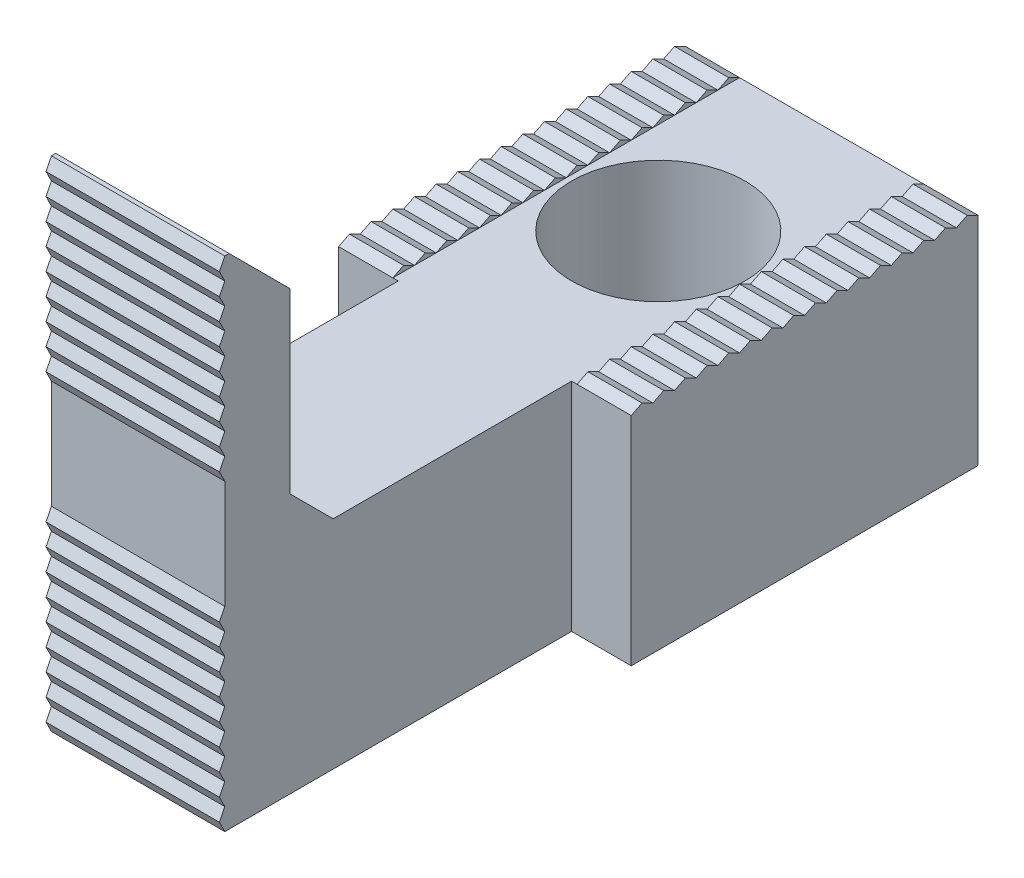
ISO-10303-21;
HEADER;
FILE_DESCRIPTION(('STEP AP214'),'2;1');
FILE_NAME('part.step','',(''),(''),'','','');
FILE_SCHEMA(('AUTOMOTIVE_DESIGN { 1 0 10303 214 1 1 1 1 }'));
ENDSEC;
DATA;
#1=APPLICATION_CONTEXT('core data for automotive mechanical design processes');
#2=APPLICATION_PROTOCOL_DEFINITION('international standard','automotive_design',2000,#1);
#3=PRODUCT_CONTEXT('',#1,'mechanical');
#4=PRODUCT('Part','Part','',(#3));
#5=PRODUCT_RELATED_PRODUCT_CATEGORY('part','',(#4));
#6=PRODUCT_DEFINITION_FORMATION('','',#4);
#7=PRODUCT_DEFINITION_CONTEXT('part definition',#1,'design');
#8=PRODUCT_DEFINITION('design','',#6,#7);
#9=PRODUCT_DEFINITION_SHAPE('','',#8);
#10=(LENGTH_UNIT() NAMED_UNIT(*) SI_UNIT(.MILLI.,.METRE.));
#11=(NAMED_UNIT(*) PLANE_ANGLE_UNIT() SI_UNIT($,.RADIAN.));
#12=(NAMED_UNIT(*) SI_UNIT($,.STERADIAN.) SOLID_ANGLE_UNIT());
#13=UNCERTAINTY_MEASURE_WITH_UNIT(LENGTH_MEASURE(1.E-05),#10,'distance_accuracy_value','');
#14=(GEOMETRIC_REPRESENTATION_CONTEXT(3) GLOBAL_UNCERTAINTY_ASSIGNED_CONTEXT((#13)) GLOBAL_UNIT_ASSIGNED_CONTEXT((#10,
#11,#12)) REPRESENTATION_CONTEXT('',''));
#15=CARTESIAN_POINT('',(0.,0.,0.));
#16=DIRECTION('',(0.,0.,1.));
#17=DIRECTION('',(1.,0.,0.));
#18=AXIS2_PLACEMENT_3D('',#15,#16,#17);
#19=CARTESIAN_POINT('',(6.75,5.00000000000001,8.));
#20=DIRECTION('',(0.,0.894427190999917,-0.447213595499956));
#21=DIRECTION('',(0.,0.447213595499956,0.894427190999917));
#22=AXIS2_PLACEMENT_3D('',#19,#20,#21);
#23=PLANE('',#22);
#24=DIRECTION('',(0.,0.447213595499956,0.894427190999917));
#25=VECTOR('',#24,1.);
#26=CARTESIAN_POINT('',(6.75,5.00000000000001,8.));
#27=LINE('',#26,#25);
#28=CARTESIAN_POINT('',(6.75,5.25,8.5));
#29=VERTEX_POINT('',#28);
#30=CARTESIAN_POINT('',(6.75,5.00000000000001,8.));
#31=VERTEX_POINT('',#30);
#32=EDGE_CURVE('E1550',#29,#31,#27,.F.);
#33=ORIENTED_EDGE('',*,*,#32,.T.);
#34=DIRECTION('',(1.,0.,0.));
#35=VECTOR('',#34,1.);
#36=CARTESIAN_POINT('',(6.75,5.00000000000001,8.));
#37=LINE('',#36,#35);
#38=CARTESIAN_POINT('',(4.25,5.,8.));
#39=VERTEX_POINT('',#38);
#40=EDGE_CURVE('E1539',#39,#31,#37,.T.);
#41=ORIENTED_EDGE('',*,*,#40,.F.);
#42=DIRECTION('',(0.,0.447213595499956,0.894427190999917));
#43=VECTOR('',#42,1.);
#44=CARTESIAN_POINT('',(4.25,5.00000000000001,8.));
#45=LINE('',#44,#43);
#46=CARTESIAN_POINT('',(4.25,5.25,8.5));
#47=VERTEX_POINT('',#46);
#48=EDGE_CURVE('E1552',#39,#47,#45,.T.);
#49=ORIENTED_EDGE('',*,*,#48,.T.);
#50=DIRECTION('',(1.,0.,0.));
#51=VECTOR('',#50,1.);
#52=CARTESIAN_POINT('',(6.75,5.25,8.5));
#53=LINE('',#52,#51);
#54=EDGE_CURVE('E1519',#29,#47,#53,.F.);
#55=ORIENTED_EDGE('',*,*,#54,.F.);
#56=EDGE_LOOP('',(#33,#41,#49,#55));
#57=FACE_BOUND('',#56,.T.);
#58=ADVANCED_FACE('F15',(#57),#23,.T.);
#59=CARTESIAN_POINT('',(-6.75,5.,7.99999999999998));
#60=DIRECTION('',(0.,0.894427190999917,-0.447213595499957));
#61=DIRECTION('',(0.,0.447213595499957,0.894427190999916));
#62=AXIS2_PLACEMENT_3D('',#59,#60,#61);
#63=PLANE('',#62);
#64=DIRECTION('',(0.,0.447213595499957,0.894427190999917));
#65=VECTOR('',#64,1.);
#66=CARTESIAN_POINT('',(-6.75,5.125,8.24999999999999));
#67=LINE('',#66,#65);
#68=CARTESIAN_POINT('',(-6.75,5.,8.));
#69=VERTEX_POINT('',#68);
#70=CARTESIAN_POINT('',(-6.75,5.25,8.5));
#71=VERTEX_POINT('',#70);
#72=EDGE_CURVE('E1545',#69,#71,#67,.T.);
#73=ORIENTED_EDGE('',*,*,#72,.T.);
#74=DIRECTION('',(-1.,0.,0.));
#75=VECTOR('',#74,1.);
#76=CARTESIAN_POINT('',(-5.5,5.25,8.5));
#77=LINE('',#76,#75);
#78=CARTESIAN_POINT('',(-4.25,5.24999999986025,8.50000000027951));
#79=VERTEX_POINT('',#78);
#80=EDGE_CURVE('E1513',#79,#71,#77,.T.);
#81=ORIENTED_EDGE('',*,*,#80,.F.);
#82=DIRECTION('',(0.,-0.447213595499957,-0.894427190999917));
#83=VECTOR('',#82,1.);
#84=CARTESIAN_POINT('',(-4.25,5.125,8.24999999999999));
#85=LINE('',#84,#83);
#86=CARTESIAN_POINT('',(-4.25,5.,8.));
#87=VERTEX_POINT('',#86);
#88=EDGE_CURVE('E1547',#79,#87,#85,.T.);
#89=ORIENTED_EDGE('',*,*,#88,.T.);
#90=DIRECTION('',(1.,0.,0.));
#91=VECTOR('',#90,1.);
#92=CARTESIAN_POINT('',(-5.5,5.,8.));
#93=LINE('',#92,#91);
#94=EDGE_CURVE('E1528',#69,#87,#93,.T.);
#95=ORIENTED_EDGE('',*,*,#94,.F.);
#96=EDGE_LOOP('',(#73,#81,#89,#95));
#97=FACE_BOUND('',#96,.T.);
#98=ADVANCED_FACE('F1735',(#97),#63,.T.);
#99=CARTESIAN_POINT('',(6.75,5.25,7.5));
#100=DIRECTION('',(0.,0.894427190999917,0.447213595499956));
#101=DIRECTION('',(0.,-0.447213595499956,0.894427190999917));
#102=AXIS2_PLACEMENT_3D('',#99,#100,#101);
#103=PLANE('',#102);
#104=DIRECTION('',(0.,-0.447213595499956,0.894427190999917));
#105=VECTOR('',#104,1.);
#106=CARTESIAN_POINT('',(6.75,5.25,7.5));
#107=LINE('',#106,#105);
#108=CARTESIAN_POINT('',(6.75,5.25,7.5));
#109=VERTEX_POINT('',#108);
#110=EDGE_CURVE('E1537',#31,#109,#107,.F.);
#111=ORIENTED_EDGE('',*,*,#110,.T.);
#112=DIRECTION('',(1.,0.,0.));
#113=VECTOR('',#112,1.);
#114=CARTESIAN_POINT('',(6.75,5.25,7.5));
#115=LINE('',#114,#113);
#116=CARTESIAN_POINT('',(4.25,5.25,7.5));
#117=VERTEX_POINT('',#116);
#118=EDGE_CURVE('E1505',#117,#109,#115,.T.);
#119=ORIENTED_EDGE('',*,*,#118,.F.);
#120=DIRECTION('',(0.,-0.447213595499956,0.894427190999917));
#121=VECTOR('',#120,1.);
#122=CARTESIAN_POINT('',(4.25,5.25,7.5));
#123=LINE('',#122,#121);
#124=EDGE_CURVE('E1542',#117,#39,#123,.T.);
#125=ORIENTED_EDGE('',*,*,#124,.T.);
#126=ORIENTED_EDGE('',*,*,#40,.T.);
#127=EDGE_LOOP('',(#111,#119,#125,#126));
#128=FACE_BOUND('',#127,.T.);
#129=ADVANCED_FACE('F2369',(#128),#103,.T.);
#130=CARTESIAN_POINT('',(-6.75,5.25,7.5));
#131=DIRECTION('',(0.,0.894427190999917,0.447213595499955));
#132=DIRECTION('',(0.,-0.447213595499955,0.894427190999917));
#133=AXIS2_PLACEMENT_3D('',#130,#131,#132);
#134=PLANE('',#133);
#135=DIRECTION('',(0.,-0.447213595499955,0.894427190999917));
#136=VECTOR('',#135,1.);
#137=CARTESIAN_POINT('',(-6.75,5.125,7.75));
#138=LINE('',#137,#136);
#139=CARTESIAN_POINT('',(-6.75,5.25,7.5));
#140=VERTEX_POINT('',#139);
#141=EDGE_CURVE('E1531',#140,#69,#138,.T.);
#142=ORIENTED_EDGE('',*,*,#141,.T.);
#143=ORIENTED_EDGE('',*,*,#94,.T.);
#144=DIRECTION('',(0.,0.447213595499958,-0.894427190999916));
#145=VECTOR('',#144,1.);
#146=CARTESIAN_POINT('',(-4.25,5.125,7.75));
#147=LINE('',#146,#145);
#148=CARTESIAN_POINT('',(-4.25,5.24999999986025,7.50000000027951));
#149=VERTEX_POINT('',#148);
#150=EDGE_CURVE('E1534',#87,#149,#147,.T.);
#151=ORIENTED_EDGE('',*,*,#150,.T.);
#152=DIRECTION('',(1.,0.,0.));
#153=VECTOR('',#152,1.);
#154=CARTESIAN_POINT('',(-5.5,5.25,7.5));
#155=LINE('',#154,#153);
#156=EDGE_CURVE('E1494',#140,#149,#155,.T.);
#157=ORIENTED_EDGE('',*,*,#156,.F.);
#158=EDGE_LOOP('',(#142,#143,#151,#157));
#159=FACE_BOUND('',#158,.T.);
#160=ADVANCED_FACE('F1732',(#159),#134,.T.);
#161=CARTESIAN_POINT('',(6.75,5.25,8.5));
#162=DIRECTION('',(0.,0.894427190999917,0.447213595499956));
#163=DIRECTION('',(0.,-0.447213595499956,0.894427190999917));
#164=AXIS2_PLACEMENT_3D('',#161,#162,#163);
#165=PLANE('',#164);
#166=DIRECTION('',(0.,-0.447213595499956,0.894427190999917));
#167=VECTOR('',#166,1.);
#168=CARTESIAN_POINT('',(6.75,5.25,8.5));
#169=LINE('',#168,#167);
#170=CARTESIAN_POINT('',(6.75,5.00000000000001,9.));
#171=VERTEX_POINT('',#170);
#172=EDGE_CURVE('E1522',#171,#29,#169,.F.);
#173=ORIENTED_EDGE('',*,*,#172,.T.);
#174=ORIENTED_EDGE('',*,*,#54,.T.);
#175=DIRECTION('',(0.,-0.447213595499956,0.894427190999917));
#176=VECTOR('',#175,1.);
#177=CARTESIAN_POINT('',(4.25,5.25,8.5));
#178=LINE('',#177,#176);
#179=CARTESIAN_POINT('',(4.25,5.,9.));
#180=VERTEX_POINT('',#179);
#181=EDGE_CURVE('E1525',#47,#180,#178,.T.);
#182=ORIENTED_EDGE('',*,*,#181,.T.);
#183=DIRECTION('',(1.,0.,0.));
#184=VECTOR('',#183,1.);
#185=CARTESIAN_POINT('',(6.75,5.00000000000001,9.));
#186=LINE('',#185,#184);
#187=EDGE_CURVE('E1485',#171,#180,#186,.F.);
#188=ORIENTED_EDGE('',*,*,#187,.F.);
#189=EDGE_LOOP('',(#173,#174,#182,#188));
#190=FACE_BOUND('',#189,.T.);
#191=ADVANCED_FACE('F2365',(#190),#165,.T.);
#192=CARTESIAN_POINT('',(-6.75,5.25,8.5));
#193=DIRECTION('',(0.,0.894427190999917,0.447213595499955));
#194=DIRECTION('',(0.,-0.447213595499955,0.894427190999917));
#195=AXIS2_PLACEMENT_3D('',#192,#193,#194);
#196=PLANE('',#195);
#197=DIRECTION('',(0.,-0.447213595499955,0.894427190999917));
#198=VECTOR('',#197,1.);
#199=CARTESIAN_POINT('',(-6.75,5.125,8.75));
#200=LINE('',#199,#198);
#201=CARTESIAN_POINT('',(-6.75,5.,9.));
#202=VERTEX_POINT('',#201);
#203=EDGE_CURVE('E1511',#71,#202,#200,.T.);
#204=ORIENTED_EDGE('',*,*,#203,.T.);
#205=DIRECTION('',(-1.,0.,0.));
#206=VECTOR('',#205,1.);
#207=CARTESIAN_POINT('',(-5.5,5.,8.99999999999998));
#208=LINE('',#207,#206);
#209=CARTESIAN_POINT('',(-4.25,5.,9.));
#210=VERTEX_POINT('',#209);
#211=EDGE_CURVE('E1479',#210,#202,#208,.T.);
#212=ORIENTED_EDGE('',*,*,#211,.F.);
#213=DIRECTION('',(0.,0.447213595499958,-0.894427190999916));
#214=VECTOR('',#213,1.);
#215=CARTESIAN_POINT('',(-4.25,5.125,8.75));
#216=LINE('',#215,#214);
#217=EDGE_CURVE('E1516',#210,#79,#216,.T.);
#218=ORIENTED_EDGE('',*,*,#217,.T.);
#219=ORIENTED_EDGE('',*,*,#80,.T.);
#220=EDGE_LOOP('',(#204,#212,#218,#219));
#221=FACE_BOUND('',#220,.T.);
#222=ADVANCED_FACE('F1748',(#221),#196,.T.);
#223=CARTESIAN_POINT('',(6.75,5.00000000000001,7.));
#224=DIRECTION('',(0.,0.894427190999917,-0.447213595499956));
#225=DIRECTION('',(0.,0.447213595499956,0.894427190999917));
#226=AXIS2_PLACEMENT_3D('',#223,#224,#225);
#227=PLANE('',#226);
#228=DIRECTION('',(0.,0.447213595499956,0.894427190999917));
#229=VECTOR('',#228,1.);
#230=CARTESIAN_POINT('',(6.75,5.00000000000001,7.));
#231=LINE('',#230,#229);
#232=CARTESIAN_POINT('',(6.75,5.00000000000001,7.));
#233=VERTEX_POINT('',#232);
#234=EDGE_CURVE('E1503',#109,#233,#231,.F.);
#235=ORIENTED_EDGE('',*,*,#234,.T.);
#236=DIRECTION('',(1.,0.,0.));
#237=VECTOR('',#236,1.);
#238=CARTESIAN_POINT('',(6.75,5.00000000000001,7.));
#239=LINE('',#238,#237);
#240=CARTESIAN_POINT('',(4.25,5.,7.));
#241=VERTEX_POINT('',#240);
#242=EDGE_CURVE('E1471',#241,#233,#239,.T.);
#243=ORIENTED_EDGE('',*,*,#242,.F.);
#244=DIRECTION('',(0.,0.447213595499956,0.894427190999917));
#245=VECTOR('',#244,1.);
#246=CARTESIAN_POINT('',(4.25,5.00000000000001,7.));
#247=LINE('',#246,#245);
#248=EDGE_CURVE('E1508',#241,#117,#247,.T.);
#249=ORIENTED_EDGE('',*,*,#248,.T.);
#250=ORIENTED_EDGE('',*,*,#118,.T.);
#251=EDGE_LOOP('',(#235,#243,#249,#250));
#252=FACE_BOUND('',#251,.T.);
#253=ADVANCED_FACE('F2361',(#252),#227,.T.);
#254=CARTESIAN_POINT('',(-6.75,5.,6.99999999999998));
#255=DIRECTION('',(0.,0.894427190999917,-0.447213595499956));
#256=DIRECTION('',(0.,0.447213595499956,0.894427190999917));
#257=AXIS2_PLACEMENT_3D('',#254,#255,#256);
#258=PLANE('',#257);
#259=DIRECTION('',(0.,0.447213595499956,0.894427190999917));
#260=VECTOR('',#259,1.);
#261=CARTESIAN_POINT('',(-6.75,5.125,7.24999999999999));
#262=LINE('',#261,#260);
#263=CARTESIAN_POINT('',(-6.75,5.,7.));
#264=VERTEX_POINT('',#263);
#265=EDGE_CURVE('E1497',#264,#140,#262,.T.);
#266=ORIENTED_EDGE('',*,*,#265,.T.);
#267=ORIENTED_EDGE('',*,*,#156,.T.);
#268=DIRECTION('',(0.,-0.447213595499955,-0.894427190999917));
#269=VECTOR('',#268,1.);
#270=CARTESIAN_POINT('',(-4.25,5.125,7.24999999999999));
#271=LINE('',#270,#269);
#272=CARTESIAN_POINT('',(-4.25,5.,7.));
#273=VERTEX_POINT('',#272);
#274=EDGE_CURVE('E1500',#149,#273,#271,.T.);
#275=ORIENTED_EDGE('',*,*,#274,.T.);
#276=DIRECTION('',(1.,0.,0.));
#277=VECTOR('',#276,1.);
#278=CARTESIAN_POINT('',(-5.5,5.,7.));
#279=LINE('',#278,#277);
#280=EDGE_CURVE('E1460',#264,#273,#279,.T.);
#281=ORIENTED_EDGE('',*,*,#280,.F.);
#282=EDGE_LOOP('',(#266,#267,#275,#281));
#283=FACE_BOUND('',#282,.T.);
#284=ADVANCED_FACE('F1726',(#283),#258,.T.);
#285=CARTESIAN_POINT('',(6.75,5.00000000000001,9.));
#286=DIRECTION('',(0.,0.894427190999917,-0.447213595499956));
#287=DIRECTION('',(0.,0.447213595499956,0.894427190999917));
#288=AXIS2_PLACEMENT_3D('',#285,#286,#287);
#289=PLANE('',#288);
#290=DIRECTION('',(0.,0.447213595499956,0.894427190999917));
#291=VECTOR('',#290,1.);
#292=CARTESIAN_POINT('',(6.75,5.00000000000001,9.));
#293=LINE('',#292,#291);
#294=CARTESIAN_POINT('',(6.75,5.25,9.5));
#295=VERTEX_POINT('',#294);
#296=EDGE_CURVE('E1488',#295,#171,#293,.F.);
#297=ORIENTED_EDGE('',*,*,#296,.T.);
#298=ORIENTED_EDGE('',*,*,#187,.T.);
#299=DIRECTION('',(0.,0.447213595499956,0.894427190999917));
#300=VECTOR('',#299,1.);
#301=CARTESIAN_POINT('',(4.25,5.00000000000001,9.));
#302=LINE('',#301,#300);
#303=CARTESIAN_POINT('',(4.25,5.25,9.5));
#304=VERTEX_POINT('',#303);
#305=EDGE_CURVE('E1491',#180,#304,#302,.T.);
#306=ORIENTED_EDGE('',*,*,#305,.T.);
#307=DIRECTION('',(1.,0.,0.));
#308=VECTOR('',#307,1.);
#309=CARTESIAN_POINT('',(6.75,5.25,9.5));
#310=LINE('',#309,#308);
#311=EDGE_CURVE('E1451',#295,#304,#310,.F.);
#312=ORIENTED_EDGE('',*,*,#311,.F.);
#313=EDGE_LOOP('',(#297,#298,#306,#312));
#314=FACE_BOUND('',#313,.T.);
#315=ADVANCED_FACE('F2357',(#314),#289,.T.);
#316=CARTESIAN_POINT('',(-6.75,5.,8.99999999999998));
#317=DIRECTION('',(0.,0.894427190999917,-0.447213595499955));
#318=DIRECTION('',(0.,0.447213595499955,0.894427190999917));
#319=AXIS2_PLACEMENT_3D('',#316,#317,#318);
#320=PLANE('',#319);
#321=DIRECTION('',(0.,0.447213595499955,0.894427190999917));
#322=VECTOR('',#321,1.);
#323=CARTESIAN_POINT('',(-6.75,5.125,9.24999999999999));
#324=LINE('',#323,#322);
#325=CARTESIAN_POINT('',(-6.75,5.25,9.5));
#326=VERTEX_POINT('',#325);
#327=EDGE_CURVE('E1477',#202,#326,#324,.T.);
#328=ORIENTED_EDGE('',*,*,#327,.T.);
#329=DIRECTION('',(-1.,0.,0.));
#330=VECTOR('',#329,1.);
#331=CARTESIAN_POINT('',(-5.5,5.25,9.5));
#332=LINE('',#331,#330);
#333=CARTESIAN_POINT('',(-4.25,5.24999999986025,9.50000000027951));
#334=VERTEX_POINT('',#333);
#335=EDGE_CURVE('E1445',#334,#326,#332,.T.);
#336=ORIENTED_EDGE('',*,*,#335,.F.);
#337=DIRECTION('',(0.,-0.447213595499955,-0.894427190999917));
#338=VECTOR('',#337,1.);
#339=CARTESIAN_POINT('',(-4.25,5.125,9.24999999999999));
#340=LINE('',#339,#338);
#341=EDGE_CURVE('E1482',#334,#210,#340,.T.);
#342=ORIENTED_EDGE('',*,*,#341,.T.);
#343=ORIENTED_EDGE('',*,*,#211,.T.);
#344=EDGE_LOOP('',(#328,#336,#342,#343));
#345=FACE_BOUND('',#344,.T.);
#346=ADVANCED_FACE('F1751',(#345),#320,.T.);
#347=CARTESIAN_POINT('',(6.75,5.25,6.5));
#348=DIRECTION('',(0.,0.894427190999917,0.447213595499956));
#349=DIRECTION('',(0.,-0.447213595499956,0.894427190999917));
#350=AXIS2_PLACEMENT_3D('',#347,#348,#349);
#351=PLANE('',#350);
#352=DIRECTION('',(0.,-0.447213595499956,0.894427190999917));
#353=VECTOR('',#352,1.);
#354=CARTESIAN_POINT('',(6.75,5.25,6.5));
#355=LINE('',#354,#353);
#356=CARTESIAN_POINT('',(6.75,5.25,6.5));
#357=VERTEX_POINT('',#356);
#358=EDGE_CURVE('E1469',#233,#357,#355,.F.);
#359=ORIENTED_EDGE('',*,*,#358,.T.);
#360=DIRECTION('',(1.,0.,0.));
#361=VECTOR('',#360,1.);
#362=CARTESIAN_POINT('',(6.75,5.25,6.5));
#363=LINE('',#362,#361);
#364=CARTESIAN_POINT('',(4.25,5.25,6.5));
#365=VERTEX_POINT('',#364);
#366=EDGE_CURVE('E1437',#365,#357,#363,.T.);
#367=ORIENTED_EDGE('',*,*,#366,.F.);
#368=DIRECTION('',(0.,-0.447213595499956,0.894427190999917));
#369=VECTOR('',#368,1.);
#370=CARTESIAN_POINT('',(4.25,5.25,6.5));
#371=LINE('',#370,#369);
#372=EDGE_CURVE('E1474',#365,#241,#371,.T.);
#373=ORIENTED_EDGE('',*,*,#372,.T.);
#374=ORIENTED_EDGE('',*,*,#242,.T.);
#375=EDGE_LOOP('',(#359,#367,#373,#374));
#376=FACE_BOUND('',#375,.T.);
#377=ADVANCED_FACE('F2353',(#376),#351,.T.);
#378=CARTESIAN_POINT('',(-6.75,5.25,6.5));
#379=DIRECTION('',(0.,0.894427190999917,0.447213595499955));
#380=DIRECTION('',(0.,-0.447213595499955,0.894427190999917));
#381=AXIS2_PLACEMENT_3D('',#378,#379,#380);
#382=PLANE('',#381);
#383=DIRECTION('',(0.,-0.447213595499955,0.894427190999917));
#384=VECTOR('',#383,1.);
#385=CARTESIAN_POINT('',(-6.75,5.125,6.75));
#386=LINE('',#385,#384);
#387=CARTESIAN_POINT('',(-6.75,5.25,6.5));
#388=VERTEX_POINT('',#387);
#389=EDGE_CURVE('E1463',#388,#264,#386,.T.);
#390=ORIENTED_EDGE('',*,*,#389,.T.);
#391=ORIENTED_EDGE('',*,*,#280,.T.);
#392=DIRECTION('',(0.,0.447213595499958,-0.894427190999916));
#393=VECTOR('',#392,1.);
#394=CARTESIAN_POINT('',(-4.25,5.125,6.75));
#395=LINE('',#394,#393);
#396=CARTESIAN_POINT('',(-4.25,5.24999999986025,6.50000000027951));
#397=VERTEX_POINT('',#396);
#398=EDGE_CURVE('E1466',#273,#397,#395,.T.);
#399=ORIENTED_EDGE('',*,*,#398,.T.);
#400=DIRECTION('',(1.,0.,0.));
#401=VECTOR('',#400,1.);
#402=CARTESIAN_POINT('',(-5.5,5.25,6.5));
#403=LINE('',#402,#401);
#404=EDGE_CURVE('E1426',#388,#397,#403,.T.);
#405=ORIENTED_EDGE('',*,*,#404,.F.);
#406=EDGE_LOOP('',(#390,#391,#399,#405));
#407=FACE_BOUND('',#406,.T.);
#408=ADVANCED_FACE('F1723',(#407),#382,.T.);
#409=CARTESIAN_POINT('',(6.75,5.25,9.5));
#410=DIRECTION('',(0.,0.894427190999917,0.447213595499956));
#411=DIRECTION('',(0.,-0.447213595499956,0.894427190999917));
#412=AXIS2_PLACEMENT_3D('',#409,#410,#411);
#413=PLANE('',#412);
#414=DIRECTION('',(0.,-0.447213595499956,0.894427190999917));
#415=VECTOR('',#414,1.);
#416=CARTESIAN_POINT('',(6.75,5.25,9.5));
#417=LINE('',#416,#415);
#418=CARTESIAN_POINT('',(6.75,5.00000000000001,10.));
#419=VERTEX_POINT('',#418);
#420=EDGE_CURVE('E1454',#419,#295,#417,.F.);
#421=ORIENTED_EDGE('',*,*,#420,.T.);
#422=ORIENTED_EDGE('',*,*,#311,.T.);
#423=DIRECTION('',(0.,-0.447213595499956,0.894427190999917));
#424=VECTOR('',#423,1.);
#425=CARTESIAN_POINT('',(4.25,5.25,9.5));
#426=LINE('',#425,#424);
#427=CARTESIAN_POINT('',(4.25,5.,10.));
#428=VERTEX_POINT('',#427);
#429=EDGE_CURVE('E1457',#304,#428,#426,.T.);
#430=ORIENTED_EDGE('',*,*,#429,.T.);
#431=DIRECTION('',(1.,0.,0.));
#432=VECTOR('',#431,1.);
#433=CARTESIAN_POINT('',(6.75,5.00000000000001,10.));
#434=LINE('',#433,#432);
#435=EDGE_CURVE('E1417',#419,#428,#434,.F.);
#436=ORIENTED_EDGE('',*,*,#435,.F.);
#437=EDGE_LOOP('',(#421,#422,#430,#436));
#438=FACE_BOUND('',#437,.T.);
#439=ADVANCED_FACE('F2349',(#438),#413,.T.);
#440=CARTESIAN_POINT('',(-6.75,5.25,9.5));
#441=DIRECTION('',(0.,0.894427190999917,0.447213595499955));
#442=DIRECTION('',(0.,-0.447213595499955,0.894427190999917));
#443=AXIS2_PLACEMENT_3D('',#440,#441,#442);
#444=PLANE('',#443);
#445=DIRECTION('',(0.,-0.447213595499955,0.894427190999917));
#446=VECTOR('',#445,1.);
#447=CARTESIAN_POINT('',(-6.75,5.125,9.75));
#448=LINE('',#447,#446);
#449=CARTESIAN_POINT('',(-6.75,5.,10.));
#450=VERTEX_POINT('',#449);
#451=EDGE_CURVE('E1443',#326,#450,#448,.T.);
#452=ORIENTED_EDGE('',*,*,#451,.T.);
#453=DIRECTION('',(-1.,0.,0.));
#454=VECTOR('',#453,1.);
#455=CARTESIAN_POINT('',(-5.5,5.,9.99999999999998));
#456=LINE('',#455,#454);
#457=CARTESIAN_POINT('',(-4.25,5.,10.));
#458=VERTEX_POINT('',#457);
#459=EDGE_CURVE('E1411',#458,#450,#456,.T.);
#460=ORIENTED_EDGE('',*,*,#459,.F.);
#461=DIRECTION('',(0.,0.447213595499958,-0.894427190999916));
#462=VECTOR('',#461,1.);
#463=CARTESIAN_POINT('',(-4.25,5.125,9.75));
#464=LINE('',#463,#462);
#465=EDGE_CURVE('E1448',#458,#334,#464,.T.);
#466=ORIENTED_EDGE('',*,*,#465,.T.);
#467=ORIENTED_EDGE('',*,*,#335,.T.);
#468=EDGE_LOOP('',(#452,#460,#466,#467));
#469=FACE_BOUND('',#468,.T.);
#470=ADVANCED_FACE('F1755',(#469),#444,.T.);
#471=CARTESIAN_POINT('',(6.75,5.00000000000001,6.));
#472=DIRECTION('',(0.,0.894427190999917,-0.447213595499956));
#473=DIRECTION('',(0.,0.447213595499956,0.894427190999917));
#474=AXIS2_PLACEMENT_3D('',#471,#472,#473);
#475=PLANE('',#474);
#476=DIRECTION('',(0.,0.447213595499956,0.894427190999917));
#477=VECTOR('',#476,1.);
#478=CARTESIAN_POINT('',(6.75,5.00000000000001,6.));
#479=LINE('',#478,#477);
#480=CARTESIAN_POINT('',(6.75,5.00000000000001,6.));
#481=VERTEX_POINT('',#480);
#482=EDGE_CURVE('E1435',#357,#481,#479,.F.);
#483=ORIENTED_EDGE('',*,*,#482,.T.);
#484=DIRECTION('',(1.,0.,0.));
#485=VECTOR('',#484,1.);
#486=CARTESIAN_POINT('',(6.75,5.00000000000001,6.));
#487=LINE('',#486,#485);
#488=CARTESIAN_POINT('',(4.25,5.,6.));
#489=VERTEX_POINT('',#488);
#490=EDGE_CURVE('E1403',#489,#481,#487,.T.);
#491=ORIENTED_EDGE('',*,*,#490,.F.);
#492=DIRECTION('',(0.,0.447213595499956,0.894427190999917));
#493=VECTOR('',#492,1.);
#494=CARTESIAN_POINT('',(4.25,5.00000000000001,6.));
#495=LINE('',#494,#493);
#496=EDGE_CURVE('E1440',#489,#365,#495,.T.);
#497=ORIENTED_EDGE('',*,*,#496,.T.);
#498=ORIENTED_EDGE('',*,*,#366,.T.);
#499=EDGE_LOOP('',(#483,#491,#497,#498));
#500=FACE_BOUND('',#499,.T.);
#501=ADVANCED_FACE('F2345',(#500),#475,.T.);
#502=CARTESIAN_POINT('',(-6.75,5.,5.99999999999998));
#503=DIRECTION('',(0.,0.894427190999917,-0.447213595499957));
#504=DIRECTION('',(0.,0.447213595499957,0.894427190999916));
#505=AXIS2_PLACEMENT_3D('',#502,#503,#504);
#506=PLANE('',#505);
#507=DIRECTION('',(0.,0.447213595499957,0.894427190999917));
#508=VECTOR('',#507,1.);
#509=CARTESIAN_POINT('',(-6.75,5.125,6.24999999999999));
#510=LINE('',#509,#508);
#511=CARTESIAN_POINT('',(-6.75,5.,6.));
#512=VERTEX_POINT('',#511);
#513=EDGE_CURVE('E1429',#512,#388,#510,.T.);
#514=ORIENTED_EDGE('',*,*,#513,.T.);
#515=ORIENTED_EDGE('',*,*,#404,.T.);
#516=DIRECTION('',(0.,-0.447213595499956,-0.894427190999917));
#517=VECTOR('',#516,1.);
#518=CARTESIAN_POINT('',(-4.25,5.125,6.24999999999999));
#519=LINE('',#518,#517);
#520=CARTESIAN_POINT('',(-4.25,5.,6.));
#521=VERTEX_POINT('',#520);
#522=EDGE_CURVE('E1432',#397,#521,#519,.T.);
#523=ORIENTED_EDGE('',*,*,#522,.T.);
#524=DIRECTION('',(1.,0.,0.));
#525=VECTOR('',#524,1.);
#526=CARTESIAN_POINT('',(-5.5,5.,6.));
#527=LINE('',#526,#525);
#528=EDGE_CURVE('E1392',#512,#521,#527,.T.);
#529=ORIENTED_EDGE('',*,*,#528,.F.);
#530=EDGE_LOOP('',(#514,#515,#523,#529));
#531=FACE_BOUND('',#530,.T.);
#532=ADVANCED_FACE('F1718',(#531),#506,.T.);
#533=CARTESIAN_POINT('',(6.75,5.00000000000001,10.));
#534=DIRECTION('',(0.,0.894427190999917,-0.447213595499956));
#535=DIRECTION('',(0.,0.447213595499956,0.894427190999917));
#536=AXIS2_PLACEMENT_3D('',#533,#534,#535);
#537=PLANE('',#536);
#538=DIRECTION('',(0.,0.447213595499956,0.894427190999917));
#539=VECTOR('',#538,1.);
#540=CARTESIAN_POINT('',(6.75,5.00000000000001,10.));
#541=LINE('',#540,#539);
#542=CARTESIAN_POINT('',(6.75,5.25,10.5));
#543=VERTEX_POINT('',#542);
#544=EDGE_CURVE('E1420',#543,#419,#541,.F.);
#545=ORIENTED_EDGE('',*,*,#544,.T.);
#546=ORIENTED_EDGE('',*,*,#435,.T.);
#547=DIRECTION('',(0.,0.447213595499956,0.894427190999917));
#548=VECTOR('',#547,1.);
#549=CARTESIAN_POINT('',(4.25,5.00000000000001,10.));
#550=LINE('',#549,#548);
#551=CARTESIAN_POINT('',(4.25,5.25,10.5));
#552=VERTEX_POINT('',#551);
#553=EDGE_CURVE('E1423',#428,#552,#550,.T.);
#554=ORIENTED_EDGE('',*,*,#553,.T.);
#555=DIRECTION('',(1.,0.,0.));
#556=VECTOR('',#555,1.);
#557=CARTESIAN_POINT('',(6.75,5.25,10.5));
#558=LINE('',#557,#556);
#559=EDGE_CURVE('E1383',#543,#552,#558,.F.);
#560=ORIENTED_EDGE('',*,*,#559,.F.);
#561=EDGE_LOOP('',(#545,#546,#554,#560));
#562=FACE_BOUND('',#561,.T.);
#563=ADVANCED_FACE('F2341',(#562),#537,.T.);
#564=CARTESIAN_POINT('',(-6.75,5.,9.99999999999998));
#565=DIRECTION('',(0.,0.894427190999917,-0.447213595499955));
#566=DIRECTION('',(0.,0.447213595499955,0.894427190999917));
#567=AXIS2_PLACEMENT_3D('',#564,#565,#566);
#568=PLANE('',#567);
#569=DIRECTION('',(0.,0.447213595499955,0.894427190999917));
#570=VECTOR('',#569,1.);
#571=CARTESIAN_POINT('',(-6.75,5.125,10.25));
#572=LINE('',#571,#570);
#573=CARTESIAN_POINT('',(-6.75,5.25,10.5));
#574=VERTEX_POINT('',#573);
#575=EDGE_CURVE('E1409',#450,#574,#572,.T.);
#576=ORIENTED_EDGE('',*,*,#575,.T.);
#577=DIRECTION('',(-1.,0.,0.));
#578=VECTOR('',#577,1.);
#579=CARTESIAN_POINT('',(-5.5,5.25,10.5));
#580=LINE('',#579,#578);
#581=CARTESIAN_POINT('',(-4.25,5.24999999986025,10.5000000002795));
#582=VERTEX_POINT('',#581);
#583=EDGE_CURVE('E1372',#582,#574,#580,.T.);
#584=ORIENTED_EDGE('',*,*,#583,.F.);
#585=DIRECTION('',(0.,-0.447213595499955,-0.894427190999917));
#586=VECTOR('',#585,1.);
#587=CARTESIAN_POINT('',(-4.25,5.125,10.25));
#588=LINE('',#587,#586);
#589=EDGE_CURVE('E1414',#582,#458,#588,.T.);
#590=ORIENTED_EDGE('',*,*,#589,.T.);
#591=ORIENTED_EDGE('',*,*,#459,.T.);
#592=EDGE_LOOP('',(#576,#584,#590,#591));
#593=FACE_BOUND('',#592,.T.);
#594=ADVANCED_FACE('F1759',(#593),#568,.T.);
#595=CARTESIAN_POINT('',(6.75,5.25,5.5));
#596=DIRECTION('',(0.,0.894427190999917,0.447213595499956));
#597=DIRECTION('',(0.,-0.447213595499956,0.894427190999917));
#598=AXIS2_PLACEMENT_3D('',#595,#596,#597);
#599=PLANE('',#598);
#600=DIRECTION('',(0.,-0.447213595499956,0.894427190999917));
#601=VECTOR('',#600,1.);
#602=CARTESIAN_POINT('',(6.75,5.25,5.5));
#603=LINE('',#602,#601);
#604=CARTESIAN_POINT('',(6.75,5.25,5.5));
#605=VERTEX_POINT('',#604);
#606=EDGE_CURVE('E1401',#481,#605,#603,.F.);
#607=ORIENTED_EDGE('',*,*,#606,.T.);
#608=DIRECTION('',(1.,0.,0.));
#609=VECTOR('',#608,1.);
#610=CARTESIAN_POINT('',(6.75,5.25,5.5));
#611=LINE('',#610,#609);
#612=CARTESIAN_POINT('',(4.25,5.25,5.5));
#613=VERTEX_POINT('',#612);
#614=EDGE_CURVE('E1364',#613,#605,#611,.T.);
#615=ORIENTED_EDGE('',*,*,#614,.F.);
#616=DIRECTION('',(0.,-0.447213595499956,0.894427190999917));
#617=VECTOR('',#616,1.);
#618=CARTESIAN_POINT('',(4.25,5.25,5.5));
#619=LINE('',#618,#617);
#620=EDGE_CURVE('E1406',#613,#489,#619,.T.);
#621=ORIENTED_EDGE('',*,*,#620,.T.);
#622=ORIENTED_EDGE('',*,*,#490,.T.);
#623=EDGE_LOOP('',(#607,#615,#621,#622));
#624=FACE_BOUND('',#623,.T.);
#625=ADVANCED_FACE('F2337',(#624),#599,.T.);
#626=CARTESIAN_POINT('',(-6.75,5.25,5.5));
#627=DIRECTION('',(0.,0.894427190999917,0.447213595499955));
#628=DIRECTION('',(0.,-0.447213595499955,0.894427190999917));
#629=AXIS2_PLACEMENT_3D('',#626,#627,#628);
#630=PLANE('',#629);
#631=DIRECTION('',(0.,-0.447213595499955,0.894427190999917));
#632=VECTOR('',#631,1.);
#633=CARTESIAN_POINT('',(-6.75,5.125,5.75));
#634=LINE('',#633,#632);
#635=CARTESIAN_POINT('',(-6.75,5.25,5.5));
#636=VERTEX_POINT('',#635);
#637=EDGE_CURVE('E1395',#636,#512,#634,.T.);
#638=ORIENTED_EDGE('',*,*,#637,.T.);
#639=ORIENTED_EDGE('',*,*,#528,.T.);
#640=DIRECTION('',(0.,0.447213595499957,-0.894427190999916));
#641=VECTOR('',#640,1.);
#642=CARTESIAN_POINT('',(-4.25,5.125,5.75));
#643=LINE('',#642,#641);
#644=CARTESIAN_POINT('',(-4.25,5.24999999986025,5.50000000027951));
#645=VERTEX_POINT('',#644);
#646=EDGE_CURVE('E1398',#521,#645,#643,.T.);
#647=ORIENTED_EDGE('',*,*,#646,.T.);
#648=DIRECTION('',(1.,0.,0.));
#649=VECTOR('',#648,1.);
#650=CARTESIAN_POINT('',(-5.5,5.25,5.5));
#651=LINE('',#650,#649);
#652=EDGE_CURVE('E1353',#636,#645,#651,.T.);
#653=ORIENTED_EDGE('',*,*,#652,.F.);
#654=EDGE_LOOP('',(#638,#639,#647,#653));
#655=FACE_BOUND('',#654,.T.);
#656=ADVANCED_FACE('F1716',(#655),#630,.T.);
#657=CARTESIAN_POINT('',(6.75,5.25,10.5));
#658=DIRECTION('',(0.,0.894427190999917,0.447213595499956));
#659=DIRECTION('',(0.,-0.447213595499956,0.894427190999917));
#660=AXIS2_PLACEMENT_3D('',#657,#658,#659);
#661=PLANE('',#660);
#662=DIRECTION('',(0.,-0.447213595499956,0.894427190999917));
#663=VECTOR('',#662,1.);
#664=CARTESIAN_POINT('',(6.75,5.25,10.5));
#665=LINE('',#664,#663);
#666=CARTESIAN_POINT('',(6.75,5.00000000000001,11.));
#667=VERTEX_POINT('',#666);
#668=EDGE_CURVE('E1386',#667,#543,#665,.F.);
#669=ORIENTED_EDGE('',*,*,#668,.T.);
#670=ORIENTED_EDGE('',*,*,#559,.T.);
#671=DIRECTION('',(0.,-0.447213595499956,0.894427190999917));
#672=VECTOR('',#671,1.);
#673=CARTESIAN_POINT('',(4.25,5.25,10.5));
#674=LINE('',#673,#672);
#675=CARTESIAN_POINT('',(4.25,5.,11.));
#676=VERTEX_POINT('',#675);
#677=EDGE_CURVE('E1389',#552,#676,#674,.T.);
#678=ORIENTED_EDGE('',*,*,#677,.T.);
#679=DIRECTION('',(1.,0.,0.));
#680=VECTOR('',#679,1.);
#681=CARTESIAN_POINT('',(6.75,5.00000000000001,11.));
#682=LINE('',#681,#680);
#683=EDGE_CURVE('E1344',#667,#676,#682,.F.);
#684=ORIENTED_EDGE('',*,*,#683,.F.);
#685=EDGE_LOOP('',(#669,#670,#678,#684));
#686=FACE_BOUND('',#685,.T.);
#687=ADVANCED_FACE('F2333',(#686),#661,.T.);
#688=CARTESIAN_POINT('',(3.99999999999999,14.,32.));
#689=DIRECTION('',(0.,0.447213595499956,0.894427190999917));
#690=DIRECTION('',(0.,-0.894427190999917,0.447213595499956));
#691=AXIS2_PLACEMENT_3D('',#688,#689,#690);
#692=PLANE('',#691);
#693=DIRECTION('',(0.,-0.894427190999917,0.447213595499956));
#694=VECTOR('',#693,1.);
#695=CARTESIAN_POINT('',(3.99999999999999,14.,32.));
#696=LINE('',#695,#694);
#697=CARTESIAN_POINT('',(4.,13.5,32.25));
#698=VERTEX_POINT('',#697);
#699=CARTESIAN_POINT('',(4.,14.,32.));
#700=VERTEX_POINT('',#699);
#701=EDGE_CURVE('E1378',#698,#700,#696,.F.);
#702=ORIENTED_EDGE('',*,*,#701,.T.);
#703=DIRECTION('',(1.,0.,0.));
#704=VECTOR('',#703,1.);
#705=CARTESIAN_POINT('',(3.99999999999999,14.,32.));
#706=LINE('',#705,#704);
#707=CARTESIAN_POINT('',(-4.,14.,32.));
#708=VERTEX_POINT('',#707);
#709=EDGE_CURVE('E1338',#708,#700,#706,.T.);
#710=ORIENTED_EDGE('',*,*,#709,.F.);
#711=DIRECTION('',(0.,-0.894427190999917,0.447213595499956));
#712=VECTOR('',#711,1.);
#713=CARTESIAN_POINT('',(-4.00000000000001,14.,32.));
#714=LINE('',#713,#712);
#715=CARTESIAN_POINT('',(-4.,13.5,32.25));
#716=VERTEX_POINT('',#715);
#717=EDGE_CURVE('E1380',#708,#716,#714,.T.);
#718=ORIENTED_EDGE('',*,*,#717,.T.);
#719=DIRECTION('',(1.,0.,0.));
#720=VECTOR('',#719,1.);
#721=CARTESIAN_POINT('',(3.99999999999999,13.5,32.25));
#722=LINE('',#721,#720);
#723=EDGE_CURVE('E1327',#698,#716,#722,.F.);
#724=ORIENTED_EDGE('',*,*,#723,.F.);
#725=EDGE_LOOP('',(#702,#710,#718,#724));
#726=FACE_BOUND('',#725,.T.);
#727=ADVANCED_FACE('F1918',(#726),#692,.T.);
#728=CARTESIAN_POINT('',(-6.75,5.25,10.5));
#729=DIRECTION('',(0.,0.894427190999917,0.447213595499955));
#730=DIRECTION('',(0.,-0.447213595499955,0.894427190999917));
#731=AXIS2_PLACEMENT_3D('',#728,#729,#730);
#732=PLANE('',#731);
#733=DIRECTION('',(0.,-0.447213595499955,0.894427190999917));
#734=VECTOR('',#733,1.);
#735=CARTESIAN_POINT('',(-6.75,5.125,10.75));
#736=LINE('',#735,#734);
#737=CARTESIAN_POINT('',(-6.75,5.,11.));
#738=VERTEX_POINT('',#737);
#739=EDGE_CURVE('E1370',#574,#738,#736,.T.);
#740=ORIENTED_EDGE('',*,*,#739,.T.);
#741=DIRECTION('',(-1.,0.,0.));
#742=VECTOR('',#741,1.);
#743=CARTESIAN_POINT('',(-5.5,5.,11.));
#744=LINE('',#743,#742);
#745=CARTESIAN_POINT('',(-4.25,5.,11.));
#746=VERTEX_POINT('',#745);
#747=EDGE_CURVE('E1321',#746,#738,#744,.T.);
#748=ORIENTED_EDGE('',*,*,#747,.F.);
#749=DIRECTION('',(0.,0.447213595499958,-0.894427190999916));
#750=VECTOR('',#749,1.);
#751=CARTESIAN_POINT('',(-4.25,5.125,10.75));
#752=LINE('',#751,#750);
#753=EDGE_CURVE('E1375',#746,#582,#752,.T.);
#754=ORIENTED_EDGE('',*,*,#753,.T.);
#755=ORIENTED_EDGE('',*,*,#583,.T.);
#756=EDGE_LOOP('',(#740,#748,#754,#755));
#757=FACE_BOUND('',#756,.T.);
#758=ADVANCED_FACE('F1769',(#757),#732,.T.);
#759=CARTESIAN_POINT('',(6.75,5.00000000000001,5.));
#760=DIRECTION('',(0.,0.894427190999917,-0.447213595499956));
#761=DIRECTION('',(0.,0.447213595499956,0.894427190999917));
#762=AXIS2_PLACEMENT_3D('',#759,#760,#761);
#763=PLANE('',#762);
#764=DIRECTION('',(0.,0.447213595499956,0.894427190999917));
#765=VECTOR('',#764,1.);
#766=CARTESIAN_POINT('',(6.75,5.00000000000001,5.));
#767=LINE('',#766,#765);
#768=CARTESIAN_POINT('',(6.75,5.00000000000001,5.));
#769=VERTEX_POINT('',#768);
#770=EDGE_CURVE('E1362',#605,#769,#767,.F.);
#771=ORIENTED_EDGE('',*,*,#770,.T.);
#772=DIRECTION('',(1.,0.,0.));
#773=VECTOR('',#772,1.);
#774=CARTESIAN_POINT('',(6.75,5.00000000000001,5.));
#775=LINE('',#774,#773);
#776=CARTESIAN_POINT('',(4.25,5.,5.));
#777=VERTEX_POINT('',#776);
#778=EDGE_CURVE('E1313',#777,#769,#775,.T.);
#779=ORIENTED_EDGE('',*,*,#778,.F.);
#780=DIRECTION('',(0.,0.447213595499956,0.894427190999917));
#781=VECTOR('',#780,1.);
#782=CARTESIAN_POINT('',(4.25,5.00000000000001,5.));
#783=LINE('',#782,#781);
#784=EDGE_CURVE('E1367',#777,#613,#783,.T.);
#785=ORIENTED_EDGE('',*,*,#784,.T.);
#786=ORIENTED_EDGE('',*,*,#614,.T.);
#787=EDGE_LOOP('',(#771,#779,#785,#786));
#788=FACE_BOUND('',#787,.T.);
#789=ADVANCED_FACE('F2327',(#788),#763,.T.);
#790=CARTESIAN_POINT('',(-6.75,5.,4.99999999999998));
#791=DIRECTION('',(0.,0.894427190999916,-0.447213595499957));
#792=DIRECTION('',(0.,0.447213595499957,0.894427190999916));
#793=AXIS2_PLACEMENT_3D('',#790,#791,#792);
#794=PLANE('',#793);
#795=DIRECTION('',(0.,0.447213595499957,0.894427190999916));
#796=VECTOR('',#795,1.);
#797=CARTESIAN_POINT('',(-6.75,5.125,5.24999999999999));
#798=LINE('',#797,#796);
#799=CARTESIAN_POINT('',(-6.75,5.,5.));
#800=VERTEX_POINT('',#799);
#801=EDGE_CURVE('E1356',#800,#636,#798,.T.);
#802=ORIENTED_EDGE('',*,*,#801,.T.);
#803=ORIENTED_EDGE('',*,*,#652,.T.);
#804=DIRECTION('',(0.,-0.447213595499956,-0.894427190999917));
#805=VECTOR('',#804,1.);
#806=CARTESIAN_POINT('',(-4.25,5.125,5.24999999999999));
#807=LINE('',#806,#805);
#808=CARTESIAN_POINT('',(-4.25,5.,5.));
#809=VERTEX_POINT('',#808);
#810=EDGE_CURVE('E1359',#645,#809,#807,.T.);
#811=ORIENTED_EDGE('',*,*,#810,.T.);
#812=DIRECTION('',(1.,0.,0.));
#813=VECTOR('',#812,1.);
#814=CARTESIAN_POINT('',(-5.5,5.,5.));
#815=LINE('',#814,#813);
#816=EDGE_CURVE('E1302',#800,#809,#815,.T.);
#817=ORIENTED_EDGE('',*,*,#816,.F.);
#818=EDGE_LOOP('',(#802,#803,#811,#817));
#819=FACE_BOUND('',#818,.T.);
#820=ADVANCED_FACE('F1706',(#819),#794,.T.);
#821=CARTESIAN_POINT('',(6.75,5.00000000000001,11.));
#822=DIRECTION('',(0.,0.894427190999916,-0.447213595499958));
#823=DIRECTION('',(0.,0.447213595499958,0.894427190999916));
#824=AXIS2_PLACEMENT_3D('',#821,#822,#823);
#825=PLANE('',#824);
#826=DIRECTION('',(0.,0.447213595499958,0.894427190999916));
#827=VECTOR('',#826,1.);
#828=CARTESIAN_POINT('',(6.75,5.00000000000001,11.));
#829=LINE('',#828,#827);
#830=CARTESIAN_POINT('',(6.75,5.25,11.5));
#831=VERTEX_POINT('',#830);
#832=EDGE_CURVE('E1347',#831,#667,#829,.F.);
#833=ORIENTED_EDGE('',*,*,#832,.T.);
#834=ORIENTED_EDGE('',*,*,#683,.T.);
#835=DIRECTION('',(0.,0.447213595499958,0.894427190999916));
#836=VECTOR('',#835,1.);
#837=CARTESIAN_POINT('',(4.25,5.00000000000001,11.));
#838=LINE('',#837,#836);
#839=CARTESIAN_POINT('',(4.25,5.25,11.5));
#840=VERTEX_POINT('',#839);
#841=EDGE_CURVE('E1350',#676,#840,#838,.T.);
#842=ORIENTED_EDGE('',*,*,#841,.T.);
#843=DIRECTION('',(1.,0.,0.));
#844=VECTOR('',#843,1.);
#845=CARTESIAN_POINT('',(6.75,5.25,11.5));
#846=LINE('',#845,#844);
#847=EDGE_CURVE('E1293',#831,#840,#846,.F.);
#848=ORIENTED_EDGE('',*,*,#847,.F.);
#849=EDGE_LOOP('',(#833,#834,#842,#848));
#850=FACE_BOUND('',#849,.T.);
#851=ADVANCED_FACE('F2323',(#850),#825,.T.);
#852=CARTESIAN_POINT('',(3.99999999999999,14.5,32.25));
#853=DIRECTION('',(0.,-0.447213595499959,0.894427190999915));
#854=DIRECTION('',(0.,-0.894427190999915,-0.447213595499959));
#855=AXIS2_PLACEMENT_3D('',#852,#853,#854);
#856=PLANE('',#855);
#857=DIRECTION('',(0.,-0.894427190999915,-0.447213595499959));
#858=VECTOR('',#857,1.);
#859=CARTESIAN_POINT('',(3.99999999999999,14.5,32.25));
#860=LINE('',#859,#858);
#861=CARTESIAN_POINT('',(4.,14.5,32.25));
#862=VERTEX_POINT('',#861);
#863=EDGE_CURVE('E1336',#700,#862,#860,.F.);
#864=ORIENTED_EDGE('',*,*,#863,.T.);
#865=DIRECTION('',(1.,0.,0.));
#866=VECTOR('',#865,1.);
#867=CARTESIAN_POINT('',(3.99999999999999,14.5,32.25));
#868=LINE('',#867,#866);
#869=CARTESIAN_POINT('',(-4.,14.5,32.25));
#870=VERTEX_POINT('',#869);
#871=EDGE_CURVE('E1282',#870,#862,#868,.T.);
#872=ORIENTED_EDGE('',*,*,#871,.F.);
#873=DIRECTION('',(0.,-0.894427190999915,-0.447213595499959));
#874=VECTOR('',#873,1.);
#875=CARTESIAN_POINT('',(-4.00000000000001,14.5,32.25));
#876=LINE('',#875,#874);
#877=EDGE_CURVE('E1341',#870,#708,#876,.T.);
#878=ORIENTED_EDGE('',*,*,#877,.T.);
#879=ORIENTED_EDGE('',*,*,#709,.T.);
#880=EDGE_LOOP('',(#864,#872,#878,#879));
#881=FACE_BOUND('',#880,.T.);
#882=ADVANCED_FACE('F1916',(#881),#856,.T.);
#883=CARTESIAN_POINT('',(3.99999999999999,13.5,32.25));
#884=DIRECTION('',(0.,-0.447213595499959,0.894427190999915));
#885=DIRECTION('',(0.,-0.894427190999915,-0.447213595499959));
#886=AXIS2_PLACEMENT_3D('',#883,#884,#885);
#887=PLANE('',#886);
#888=DIRECTION('',(0.,-0.894427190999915,-0.447213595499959));
#889=VECTOR('',#888,1.);
#890=CARTESIAN_POINT('',(3.99999999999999,13.5,32.25));
#891=LINE('',#890,#889);
#892=CARTESIAN_POINT('',(4.,13.,32.));
#893=VERTEX_POINT('',#892);
#894=EDGE_CURVE('E1330',#893,#698,#891,.F.);
#895=ORIENTED_EDGE('',*,*,#894,.T.);
#896=ORIENTED_EDGE('',*,*,#723,.T.);
#897=DIRECTION('',(0.,-0.894427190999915,-0.447213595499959));
#898=VECTOR('',#897,1.);
#899=CARTESIAN_POINT('',(-4.00000000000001,13.5,32.25));
#900=LINE('',#899,#898);
#901=CARTESIAN_POINT('',(-4.,13.,32.));
#902=VERTEX_POINT('',#901);
#903=EDGE_CURVE('E1333',#716,#902,#900,.T.);
#904=ORIENTED_EDGE('',*,*,#903,.T.);
#905=DIRECTION('',(1.,0.,0.));
#906=VECTOR('',#905,1.);
#907=CARTESIAN_POINT('',(3.99999999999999,13.,32.));
#908=LINE('',#907,#906);
#909=EDGE_CURVE('E1271',#893,#902,#908,.F.);
#910=ORIENTED_EDGE('',*,*,#909,.F.);
#911=EDGE_LOOP('',(#895,#896,#904,#910));
#912=FACE_BOUND('',#911,.T.);
#913=ADVANCED_FACE('F1921',(#912),#887,.T.);
#914=CARTESIAN_POINT('',(-6.75,5.,11.));
#915=DIRECTION('',(0.,0.894427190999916,-0.447213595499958));
#916=DIRECTION('',(0.,0.447213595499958,0.894427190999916));
#917=AXIS2_PLACEMENT_3D('',#914,#915,#916);
#918=PLANE('',#917);
#919=DIRECTION('',(0.,0.447213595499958,0.894427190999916));
#920=VECTOR('',#919,1.);
#921=CARTESIAN_POINT('',(-6.75,5.125,11.25));
#922=LINE('',#921,#920);
#923=CARTESIAN_POINT('',(-6.75,5.25,11.5));
#924=VERTEX_POINT('',#923);
#925=EDGE_CURVE('E1319',#738,#924,#922,.T.);
#926=ORIENTED_EDGE('',*,*,#925,.T.);
#927=DIRECTION('',(-1.,0.,0.));
#928=VECTOR('',#927,1.);
#929=CARTESIAN_POINT('',(-5.5,5.25000000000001,11.5));
#930=LINE('',#929,#928);
#931=CARTESIAN_POINT('',(-4.25,5.24999999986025,11.5000000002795));
#932=VERTEX_POINT('',#931);
#933=EDGE_CURVE('E1257',#932,#924,#930,.T.);
#934=ORIENTED_EDGE('',*,*,#933,.F.);
#935=DIRECTION('',(0.,-0.447213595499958,-0.894427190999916));
#936=VECTOR('',#935,1.);
#937=CARTESIAN_POINT('',(-4.25,5.125,11.25));
#938=LINE('',#937,#936);
#939=EDGE_CURVE('E1324',#932,#746,#938,.T.);
#940=ORIENTED_EDGE('',*,*,#939,.T.);
#941=ORIENTED_EDGE('',*,*,#747,.T.);
#942=EDGE_LOOP('',(#926,#934,#940,#941));
#943=FACE_BOUND('',#942,.T.);
#944=ADVANCED_FACE('F1773',(#943),#918,.T.);
#945=CARTESIAN_POINT('',(6.75,5.25,4.5));
#946=DIRECTION('',(0.,0.894427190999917,0.447213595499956));
#947=DIRECTION('',(0.,-0.447213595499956,0.894427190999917));
#948=AXIS2_PLACEMENT_3D('',#945,#946,#947);
#949=PLANE('',#948);
#950=DIRECTION('',(0.,-0.447213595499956,0.894427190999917));
#951=VECTOR('',#950,1.);
#952=CARTESIAN_POINT('',(6.75,5.25,4.5));
#953=LINE('',#952,#951);
#954=CARTESIAN_POINT('',(6.75,5.25,4.5));
#955=VERTEX_POINT('',#954);
#956=EDGE_CURVE('E1311',#769,#955,#953,.F.);
#957=ORIENTED_EDGE('',*,*,#956,.T.);
#958=DIRECTION('',(1.,0.,0.));
#959=VECTOR('',#958,1.);
#960=CARTESIAN_POINT('',(6.75,5.25,4.5));
#961=LINE('',#960,#959);
#962=CARTESIAN_POINT('',(4.25,5.25,4.5));
#963=VERTEX_POINT('',#962);
#964=EDGE_CURVE('E1249',#963,#955,#961,.T.);
#965=ORIENTED_EDGE('',*,*,#964,.F.);
#966=DIRECTION('',(0.,-0.447213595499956,0.894427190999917));
#967=VECTOR('',#966,1.);
#968=CARTESIAN_POINT('',(4.25,5.25,4.5));
#969=LINE('',#968,#967);
#970=EDGE_CURVE('E1316',#963,#777,#969,.T.);
#971=ORIENTED_EDGE('',*,*,#970,.T.);
#972=ORIENTED_EDGE('',*,*,#778,.T.);
#973=EDGE_LOOP('',(#957,#965,#971,#972));
#974=FACE_BOUND('',#973,.T.);
#975=ADVANCED_FACE('F2315',(#974),#949,.T.);
#976=CARTESIAN_POINT('',(-6.75,5.25,4.5));
#977=DIRECTION('',(0.,0.894427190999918,0.447213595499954));
#978=DIRECTION('',(0.,-0.447213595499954,0.894427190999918));
#979=AXIS2_PLACEMENT_3D('',#976,#977,#978);
#980=PLANE('',#979);
#981=DIRECTION('',(0.,-0.447213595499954,0.894427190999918));
#982=VECTOR('',#981,1.);
#983=CARTESIAN_POINT('',(-6.75,5.125,4.75));
#984=LINE('',#983,#982);
#985=CARTESIAN_POINT('',(-6.75,5.25,4.5));
#986=VERTEX_POINT('',#985);
#987=EDGE_CURVE('E1305',#986,#800,#984,.T.);
#988=ORIENTED_EDGE('',*,*,#987,.T.);
#989=ORIENTED_EDGE('',*,*,#816,.T.);
#990=DIRECTION('',(0.,0.447213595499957,-0.894427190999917));
#991=VECTOR('',#990,1.);
#992=CARTESIAN_POINT('',(-4.25,5.125,4.75));
#993=LINE('',#992,#991);
#994=CARTESIAN_POINT('',(-4.25,5.24999999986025,4.50000000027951));
#995=VERTEX_POINT('',#994);
#996=EDGE_CURVE('E1308',#809,#995,#993,.T.);
#997=ORIENTED_EDGE('',*,*,#996,.T.);
#998=DIRECTION('',(1.,0.,0.));
#999=VECTOR('',#998,1.);
#1000=CARTESIAN_POINT('',(-5.5,5.25,4.5));
#1001=LINE('',#1000,#999);
#1002=EDGE_CURVE('E1238',#986,#995,#1001,.T.);
#1003=ORIENTED_EDGE('',*,*,#1002,.F.);
#1004=EDGE_LOOP('',(#988,#989,#997,#1003));
#1005=FACE_BOUND('',#1004,.T.);
#1006=ADVANCED_FACE('F1709',(#1005),#980,.T.);
#1007=CARTESIAN_POINT('',(6.75,5.25,11.5));
#1008=DIRECTION('',(0.,0.894427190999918,0.447213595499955));
#1009=DIRECTION('',(0.,-0.447213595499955,0.894427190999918));
#1010=AXIS2_PLACEMENT_3D('',#1007,#1008,#1009);
#1011=PLANE('',#1010);
#1012=DIRECTION('',(0.,-0.447213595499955,0.894427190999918));
#1013=VECTOR('',#1012,1.);
#1014=CARTESIAN_POINT('',(6.75,5.25,11.5));
#1015=LINE('',#1014,#1013);
#1016=CARTESIAN_POINT('',(6.75,5.00000000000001,12.));
#1017=VERTEX_POINT('',#1016);
#1018=EDGE_CURVE('E1296',#1017,#831,#1015,.F.);
#1019=ORIENTED_EDGE('',*,*,#1018,.T.);
#1020=ORIENTED_EDGE('',*,*,#847,.T.);
#1021=DIRECTION('',(0.,-0.447213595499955,0.894427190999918));
#1022=VECTOR('',#1021,1.);
#1023=CARTESIAN_POINT('',(4.25,5.25,11.5));
#1024=LINE('',#1023,#1022);
#1025=CARTESIAN_POINT('',(4.25,5.,12.));
#1026=VERTEX_POINT('',#1025);
#1027=EDGE_CURVE('E1299',#840,#1026,#1024,.T.);
#1028=ORIENTED_EDGE('',*,*,#1027,.T.);
#1029=DIRECTION('',(1.,0.,0.));
#1030=VECTOR('',#1029,1.);
#1031=CARTESIAN_POINT('',(6.75,5.00000000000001,12.));
#1032=LINE('',#1031,#1030);
#1033=EDGE_CURVE('E1229',#1017,#1026,#1032,.F.);
#1034=ORIENTED_EDGE('',*,*,#1033,.F.);
#1035=EDGE_LOOP('',(#1019,#1020,#1028,#1034));
#1036=FACE_BOUND('',#1035,.T.);
#1037=ADVANCED_FACE('F2311',(#1036),#1011,.T.);
#1038=CARTESIAN_POINT('',(4.,0.,32.));
#1039=DIRECTION('',(0.,0.447213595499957,0.894427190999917));
#1040=DIRECTION('',(0.,-0.894427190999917,0.447213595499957));
#1041=AXIS2_PLACEMENT_3D('',#1038,#1039,#1040);
#1042=PLANE('',#1041);
#1043=DIRECTION('',(0.,-0.894427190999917,0.447213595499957));
#1044=VECTOR('',#1043,1.);
#1045=CARTESIAN_POINT('',(4.,0.,32.));
#1046=LINE('',#1045,#1044);
#1047=CARTESIAN_POINT('',(4.,-0.500000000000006,32.25));
#1048=VERTEX_POINT('',#1047);
#1049=CARTESIAN_POINT('',(4.,0.,32.));
#1050=VERTEX_POINT('',#1049);
#1051=EDGE_CURVE('E1288',#1048,#1050,#1046,.F.);
#1052=ORIENTED_EDGE('',*,*,#1051,.T.);
#1053=DIRECTION('',(1.,0.,0.));
#1054=VECTOR('',#1053,1.);
#1055=CARTESIAN_POINT('',(4.,0.,32.));
#1056=LINE('',#1055,#1054);
#1057=CARTESIAN_POINT('',(-4.,0.,32.));
#1058=VERTEX_POINT('',#1057);
#1059=EDGE_CURVE('E1265',#1058,#1050,#1056,.T.);
#1060=ORIENTED_EDGE('',*,*,#1059,.F.);
#1061=DIRECTION('',(0.,-0.894427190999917,0.447213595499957));
#1062=VECTOR('',#1061,1.);
#1063=CARTESIAN_POINT('',(-4.,0.,32.));
#1064=LINE('',#1063,#1062);
#1065=CARTESIAN_POINT('',(-4.,-0.500000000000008,32.25));
#1066=VERTEX_POINT('',#1065);
#1067=EDGE_CURVE('E1290',#1058,#1066,#1064,.T.);
#1068=ORIENTED_EDGE('',*,*,#1067,.T.);
#1069=DIRECTION('',(1.,0.,0.));
#1070=VECTOR('',#1069,1.);
#1071=CARTESIAN_POINT('',(4.,-0.500000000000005,32.25));
#1072=LINE('',#1071,#1070);
#1073=EDGE_CURVE('E1220',#1048,#1066,#1072,.F.);
#1074=ORIENTED_EDGE('',*,*,#1073,.F.);
#1075=EDGE_LOOP('',(#1052,#1060,#1068,#1074));
#1076=FACE_BOUND('',#1075,.T.);
#1077=ADVANCED_FACE('F1984',(#1076),#1042,.T.);
#1078=CARTESIAN_POINT('',(3.99999999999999,15.,32.));
#1079=DIRECTION('',(0.,0.447213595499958,0.894427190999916));
#1080=DIRECTION('',(0.,-0.894427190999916,0.447213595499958));
#1081=AXIS2_PLACEMENT_3D('',#1078,#1079,#1080);
#1082=PLANE('',#1081);
#1083=DIRECTION('',(0.,-0.894427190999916,0.447213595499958));
#1084=VECTOR('',#1083,1.);
#1085=CARTESIAN_POINT('',(3.99999999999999,15.,32.));
#1086=LINE('',#1085,#1084);
#1087=CARTESIAN_POINT('',(4.,15.,32.));
#1088=VERTEX_POINT('',#1087);
#1089=EDGE_CURVE('E1280',#862,#1088,#1086,.F.);
#1090=ORIENTED_EDGE('',*,*,#1089,.T.);
#1091=DIRECTION('',(1.,0.,0.));
#1092=VECTOR('',#1091,1.);
#1093=CARTESIAN_POINT('',(3.99999999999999,15.,32.));
#1094=LINE('',#1093,#1092);
#1095=CARTESIAN_POINT('',(-4.,15.,32.));
#1096=VERTEX_POINT('',#1095);
#1097=EDGE_CURVE('E1214',#1096,#1088,#1094,.T.);
#1098=ORIENTED_EDGE('',*,*,#1097,.F.);
#1099=DIRECTION('',(0.,-0.894427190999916,0.447213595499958));
#1100=VECTOR('',#1099,1.);
#1101=CARTESIAN_POINT('',(-4.00000000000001,15.,32.));
#1102=LINE('',#1101,#1100);
#1103=EDGE_CURVE('E1285',#1096,#870,#1102,.T.);
#1104=ORIENTED_EDGE('',*,*,#1103,.T.);
#1105=ORIENTED_EDGE('',*,*,#871,.T.);
#1106=EDGE_LOOP('',(#1090,#1098,#1104,#1105));
#1107=FACE_BOUND('',#1106,.T.);
#1108=ADVANCED_FACE('F1910',(#1107),#1082,.T.);
#1109=CARTESIAN_POINT('',(3.99999999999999,13.,32.));
#1110=DIRECTION('',(0.,0.447213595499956,0.894427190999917));
#1111=DIRECTION('',(0.,-0.894427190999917,0.447213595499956));
#1112=AXIS2_PLACEMENT_3D('',#1109,#1110,#1111);
#1113=PLANE('',#1112);
#1114=DIRECTION('',(0.,-0.894427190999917,0.447213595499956));
#1115=VECTOR('',#1114,1.);
#1116=CARTESIAN_POINT('',(4.,13.,32.));
#1117=LINE('',#1116,#1115);
#1118=CARTESIAN_POINT('',(4.,12.5,32.25));
#1119=VERTEX_POINT('',#1118);
#1120=EDGE_CURVE('E1274',#1119,#893,#1117,.F.);
#1121=ORIENTED_EDGE('',*,*,#1120,.T.);
#1122=ORIENTED_EDGE('',*,*,#909,.T.);
#1123=DIRECTION('',(0.,-0.894427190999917,0.447213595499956));
#1124=VECTOR('',#1123,1.);
#1125=CARTESIAN_POINT('',(-4.00000000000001,13.,32.));
#1126=LINE('',#1125,#1124);
#1127=CARTESIAN_POINT('',(-4.,12.5,32.25));
#1128=VERTEX_POINT('',#1127);
#1129=EDGE_CURVE('E1277',#902,#1128,#1126,.T.);
#1130=ORIENTED_EDGE('',*,*,#1129,.T.);
#1131=DIRECTION('',(1.,0.,0.));
#1132=VECTOR('',#1131,1.);
#1133=CARTESIAN_POINT('',(4.,12.5,32.25));
#1134=LINE('',#1133,#1132);
#1135=EDGE_CURVE('E1203',#1119,#1128,#1134,.F.);
#1136=ORIENTED_EDGE('',*,*,#1135,.F.);
#1137=EDGE_LOOP('',(#1121,#1122,#1130,#1136));
#1138=FACE_BOUND('',#1137,.T.);
#1139=ADVANCED_FACE('F1925',(#1138),#1113,.T.);
#1140=CARTESIAN_POINT('',(4.,0.499999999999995,32.25));
#1141=DIRECTION('',(0.,-0.447213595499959,0.894427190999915));
#1142=DIRECTION('',(0.,-0.894427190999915,-0.447213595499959));
#1143=AXIS2_PLACEMENT_3D('',#1140,#1141,#1142);
#1144=PLANE('',#1143);
#1145=DIRECTION('',(0.,-0.894427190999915,-0.447213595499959));
#1146=VECTOR('',#1145,1.);
#1147=CARTESIAN_POINT('',(4.,0.499999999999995,32.25));
#1148=LINE('',#1147,#1146);
#1149=CARTESIAN_POINT('',(4.,0.499999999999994,32.25));
#1150=VERTEX_POINT('',#1149);
#1151=EDGE_CURVE('E1263',#1050,#1150,#1148,.F.);
#1152=ORIENTED_EDGE('',*,*,#1151,.T.);
#1153=DIRECTION('',(1.,0.,0.));
#1154=VECTOR('',#1153,1.);
#1155=CARTESIAN_POINT('',(4.,0.499999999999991,32.25));
#1156=LINE('',#1155,#1154);
#1157=CARTESIAN_POINT('',(-4.,0.499999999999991,32.25));
#1158=VERTEX_POINT('',#1157);
#1159=EDGE_CURVE('E1197',#1158,#1150,#1156,.T.);
#1160=ORIENTED_EDGE('',*,*,#1159,.F.);
#1161=DIRECTION('',(0.,-0.894427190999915,-0.447213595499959));
#1162=VECTOR('',#1161,1.);
#1163=CARTESIAN_POINT('',(-4.,0.499999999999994,32.25));
#1164=LINE('',#1163,#1162);
#1165=EDGE_CURVE('E1268',#1158,#1058,#1164,.T.);
#1166=ORIENTED_EDGE('',*,*,#1165,.T.);
#1167=ORIENTED_EDGE('',*,*,#1059,.T.);
#1168=EDGE_LOOP('',(#1152,#1160,#1166,#1167));
#1169=FACE_BOUND('',#1168,.T.);
#1170=ADVANCED_FACE('F1981',(#1169),#1144,.T.);
#1171=CARTESIAN_POINT('',(-6.75,5.25000000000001,11.5));
#1172=DIRECTION('',(0.,0.894427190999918,0.447213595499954));
#1173=DIRECTION('',(0.,-0.447213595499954,0.894427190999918));
#1174=AXIS2_PLACEMENT_3D('',#1171,#1172,#1173);
#1175=PLANE('',#1174);
#1176=DIRECTION('',(0.,-0.447213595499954,0.894427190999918));
#1177=VECTOR('',#1176,1.);
#1178=CARTESIAN_POINT('',(-6.75,5.125,11.75));
#1179=LINE('',#1178,#1177);
#1180=CARTESIAN_POINT('',(-6.75,5.,12.));
#1181=VERTEX_POINT('',#1180);
#1182=EDGE_CURVE('E1255',#924,#1181,#1179,.T.);
#1183=ORIENTED_EDGE('',*,*,#1182,.T.);
#1184=DIRECTION('',(-1.,0.,0.));
#1185=VECTOR('',#1184,1.);
#1186=CARTESIAN_POINT('',(-5.5,5.,12.));
#1187=LINE('',#1186,#1185);
#1188=CARTESIAN_POINT('',(-4.25,5.,12.));
#1189=VERTEX_POINT('',#1188);
#1190=EDGE_CURVE('E1189',#1189,#1181,#1187,.T.);
#1191=ORIENTED_EDGE('',*,*,#1190,.F.);
#1192=DIRECTION('',(0.,0.447213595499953,-0.894427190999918));
#1193=VECTOR('',#1192,1.);
#1194=CARTESIAN_POINT('',(-4.25,5.12500000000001,11.75));
#1195=LINE('',#1194,#1193);
#1196=EDGE_CURVE('E1260',#1189,#932,#1195,.T.);
#1197=ORIENTED_EDGE('',*,*,#1196,.T.);
#1198=ORIENTED_EDGE('',*,*,#933,.T.);
#1199=EDGE_LOOP('',(#1183,#1191,#1197,#1198));
#1200=FACE_BOUND('',#1199,.T.);
#1201=ADVANCED_FACE('F1777',(#1200),#1175,.T.);
#1202=CARTESIAN_POINT('',(6.75,5.00000000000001,4.));
#1203=DIRECTION('',(0.,0.894427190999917,-0.447213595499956));
#1204=DIRECTION('',(0.,0.447213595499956,0.894427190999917));
#1205=AXIS2_PLACEMENT_3D('',#1202,#1203,#1204);
#1206=PLANE('',#1205);
#1207=DIRECTION('',(0.,0.447213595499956,0.894427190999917));
#1208=VECTOR('',#1207,1.);
#1209=CARTESIAN_POINT('',(6.75,5.00000000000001,4.));
#1210=LINE('',#1209,#1208);
#1211=CARTESIAN_POINT('',(6.75,5.00000000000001,4.));
#1212=VERTEX_POINT('',#1211);
#1213=EDGE_CURVE('E1247',#955,#1212,#1210,.F.);
#1214=ORIENTED_EDGE('',*,*,#1213,.T.);
#1215=DIRECTION('',(1.,0.,0.));
#1216=VECTOR('',#1215,1.);
#1217=CARTESIAN_POINT('',(6.75,5.00000000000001,4.));
#1218=LINE('',#1217,#1216);
#1219=CARTESIAN_POINT('',(4.25,5.,4.));
#1220=VERTEX_POINT('',#1219);
#1221=EDGE_CURVE('E1181',#1220,#1212,#1218,.T.);
#1222=ORIENTED_EDGE('',*,*,#1221,.F.);
#1223=DIRECTION('',(0.,0.447213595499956,0.894427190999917));
#1224=VECTOR('',#1223,1.);
#1225=CARTESIAN_POINT('',(4.25,5.00000000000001,4.));
#1226=LINE('',#1225,#1224);
#1227=EDGE_CURVE('E1252',#1220,#963,#1226,.T.);
#1228=ORIENTED_EDGE('',*,*,#1227,.T.);
#1229=ORIENTED_EDGE('',*,*,#964,.T.);
#1230=EDGE_LOOP('',(#1214,#1222,#1228,#1229));
#1231=FACE_BOUND('',#1230,.T.);
#1232=ADVANCED_FACE('F2299',(#1231),#1206,.T.);
#1233=CARTESIAN_POINT('',(-6.75,5.,3.99999999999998));
#1234=DIRECTION('',(0.,0.894427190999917,-0.447213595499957));
#1235=DIRECTION('',(0.,0.447213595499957,0.894427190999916));
#1236=AXIS2_PLACEMENT_3D('',#1233,#1234,#1235);
#1237=PLANE('',#1236);
#1238=DIRECTION('',(0.,0.447213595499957,0.894427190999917));
#1239=VECTOR('',#1238,1.);
#1240=CARTESIAN_POINT('',(-6.75,5.125,4.24999999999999));
#1241=LINE('',#1240,#1239);
#1242=CARTESIAN_POINT('',(-6.75,5.,4.));
#1243=VERTEX_POINT('',#1242);
#1244=EDGE_CURVE('E1241',#1243,#986,#1241,.T.);
#1245=ORIENTED_EDGE('',*,*,#1244,.T.);
#1246=ORIENTED_EDGE('',*,*,#1002,.T.);
#1247=DIRECTION('',(0.,-0.447213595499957,-0.894427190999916));
#1248=VECTOR('',#1247,1.);
#1249=CARTESIAN_POINT('',(-4.25,5.125,4.24999999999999));
#1250=LINE('',#1249,#1248);
#1251=CARTESIAN_POINT('',(-4.25,5.,4.));
#1252=VERTEX_POINT('',#1251);
#1253=EDGE_CURVE('E1244',#995,#1252,#1250,.T.);
#1254=ORIENTED_EDGE('',*,*,#1253,.T.);
#1255=DIRECTION('',(1.,0.,0.));
#1256=VECTOR('',#1255,1.);
#1257=CARTESIAN_POINT('',(-5.5,5.,4.));
#1258=LINE('',#1257,#1256);
#1259=EDGE_CURVE('E1170',#1243,#1252,#1258,.T.);
#1260=ORIENTED_EDGE('',*,*,#1259,.F.);
#1261=EDGE_LOOP('',(#1245,#1246,#1254,#1260));
#1262=FACE_BOUND('',#1261,.T.);
#1263=ADVANCED_FACE('F2297',(#1262),#1237,.T.);
#1264=CARTESIAN_POINT('',(6.75,5.00000000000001,12.));
#1265=DIRECTION('',(0.,0.894427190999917,-0.447213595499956));
#1266=DIRECTION('',(0.,0.447213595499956,0.894427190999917));
#1267=AXIS2_PLACEMENT_3D('',#1264,#1265,#1266);
#1268=PLANE('',#1267);
#1269=DIRECTION('',(0.,0.447213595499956,0.894427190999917));
#1270=VECTOR('',#1269,1.);
#1271=CARTESIAN_POINT('',(6.75,5.00000000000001,12.));
#1272=LINE('',#1271,#1270);
#1273=CARTESIAN_POINT('',(6.75,5.25,12.5));
#1274=VERTEX_POINT('',#1273);
#1275=EDGE_CURVE('E1232',#1274,#1017,#1272,.F.);
#1276=ORIENTED_EDGE('',*,*,#1275,.T.);
#1277=ORIENTED_EDGE('',*,*,#1033,.T.);
#1278=DIRECTION('',(0.,0.447213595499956,0.894427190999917));
#1279=VECTOR('',#1278,1.);
#1280=CARTESIAN_POINT('',(4.25,5.00000000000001,12.));
#1281=LINE('',#1280,#1279);
#1282=CARTESIAN_POINT('',(4.25,5.25,12.5));
#1283=VERTEX_POINT('',#1282);
#1284=EDGE_CURVE('E1235',#1026,#1283,#1281,.T.);
#1285=ORIENTED_EDGE('',*,*,#1284,.T.);
#1286=DIRECTION('',(1.,0.,0.));
#1287=VECTOR('',#1286,1.);
#1288=CARTESIAN_POINT('',(6.75,5.25,12.5));
#1289=LINE('',#1288,#1287);
#1290=EDGE_CURVE('E1161',#1274,#1283,#1289,.F.);
#1291=ORIENTED_EDGE('',*,*,#1290,.F.);
#1292=EDGE_LOOP('',(#1276,#1277,#1285,#1291));
#1293=FACE_BOUND('',#1292,.T.);
#1294=ADVANCED_FACE('F2294',(#1293),#1268,.T.);
#1295=CARTESIAN_POINT('',(4.,-0.500000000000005,32.25));
#1296=DIRECTION('',(0.,-0.447213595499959,0.894427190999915));
#1297=DIRECTION('',(0.,-0.894427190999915,-0.447213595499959));
#1298=AXIS2_PLACEMENT_3D('',#1295,#1296,#1297);
#1299=PLANE('',#1298);
#1300=DIRECTION('',(0.,-0.894427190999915,-0.447213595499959));
#1301=VECTOR('',#1300,1.);
#1302=CARTESIAN_POINT('',(4.,-0.500000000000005,32.25));
#1303=LINE('',#1302,#1301);
#1304=CARTESIAN_POINT('',(4.,-1.,32.));
#1305=VERTEX_POINT('',#1304);
#1306=EDGE_CURVE('E1223',#1305,#1048,#1303,.F.);
#1307=ORIENTED_EDGE('',*,*,#1306,.T.);
#1308=ORIENTED_EDGE('',*,*,#1073,.T.);
#1309=DIRECTION('',(0.,-0.894427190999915,-0.447213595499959));
#1310=VECTOR('',#1309,1.);
#1311=CARTESIAN_POINT('',(-4.,-0.500000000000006,32.25));
#1312=LINE('',#1311,#1310);
#1313=CARTESIAN_POINT('',(-4.,-1.00000000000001,32.));
#1314=VERTEX_POINT('',#1313);
#1315=EDGE_CURVE('E1226',#1066,#1314,#1312,.T.);
#1316=ORIENTED_EDGE('',*,*,#1315,.T.);
#1317=DIRECTION('',(1.,0.,0.));
#1318=VECTOR('',#1317,1.);
#1319=CARTESIAN_POINT('',(4.,-1.,32.));
#1320=LINE('',#1319,#1318);
#1321=EDGE_CURVE('E1152',#1305,#1314,#1320,.F.);
#1322=ORIENTED_EDGE('',*,*,#1321,.F.);
#1323=EDGE_LOOP('',(#1307,#1308,#1316,#1322));
#1324=FACE_BOUND('',#1323,.T.);
#1325=ADVANCED_FACE('F1989',(#1324),#1299,.T.);
#1326=CARTESIAN_POINT('',(3.99999999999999,15.5,32.25));
#1327=DIRECTION('',(0.,-0.447213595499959,0.894427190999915));
#1328=DIRECTION('',(0.,-0.894427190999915,-0.447213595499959));
#1329=AXIS2_PLACEMENT_3D('',#1326,#1327,#1328);
#1330=PLANE('',#1329);
#1331=DIRECTION('',(0.,-0.894427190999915,-0.447213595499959));
#1332=VECTOR('',#1331,1.);
#1333=CARTESIAN_POINT('',(3.99999999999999,15.5,32.25));
#1334=LINE('',#1333,#1332);
#1335=CARTESIAN_POINT('',(3.99999999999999,15.5,32.25));
#1336=VERTEX_POINT('',#1335);
#1337=EDGE_CURVE('E1212',#1088,#1336,#1334,.F.);
#1338=ORIENTED_EDGE('',*,*,#1337,.T.);
#1339=DIRECTION('',(1.,0.,0.));
#1340=VECTOR('',#1339,1.);
#1341=CARTESIAN_POINT('',(3.99999999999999,15.5,32.25));
#1342=LINE('',#1341,#1340);
#1343=CARTESIAN_POINT('',(-4.,15.5,32.25));
#1344=VERTEX_POINT('',#1343);
#1345=EDGE_CURVE('E1146',#1344,#1336,#1342,.T.);
#1346=ORIENTED_EDGE('',*,*,#1345,.F.);
#1347=DIRECTION('',(0.,-0.894427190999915,-0.447213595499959));
#1348=VECTOR('',#1347,1.);
#1349=CARTESIAN_POINT('',(-4.00000000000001,15.5,32.25));
#1350=LINE('',#1349,#1348);
#1351=EDGE_CURVE('E1217',#1344,#1096,#1350,.T.);
#1352=ORIENTED_EDGE('',*,*,#1351,.T.);
#1353=ORIENTED_EDGE('',*,*,#1097,.T.);
#1354=EDGE_LOOP('',(#1338,#1346,#1352,#1353));
#1355=FACE_BOUND('',#1354,.T.);
#1356=ADVANCED_FACE('F1907',(#1355),#1330,.T.);
#1357=CARTESIAN_POINT('',(4.,12.5,32.25));
#1358=DIRECTION('',(0.,-0.447213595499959,0.894427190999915));
#1359=DIRECTION('',(0.,-0.894427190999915,-0.447213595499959));
#1360=AXIS2_PLACEMENT_3D('',#1357,#1358,#1359);
#1361=PLANE('',#1360);
#1362=DIRECTION('',(0.,-0.894427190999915,-0.447213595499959));
#1363=VECTOR('',#1362,1.);
#1364=CARTESIAN_POINT('',(4.,12.5,32.25));
#1365=LINE('',#1364,#1363);
#1366=CARTESIAN_POINT('',(4.,12.,32.));
#1367=VERTEX_POINT('',#1366);
#1368=EDGE_CURVE('E1206',#1367,#1119,#1365,.F.);
#1369=ORIENTED_EDGE('',*,*,#1368,.T.);
#1370=ORIENTED_EDGE('',*,*,#1135,.T.);
#1371=DIRECTION('',(0.,-0.894427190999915,-0.447213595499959));
#1372=VECTOR('',#1371,1.);
#1373=CARTESIAN_POINT('',(-4.,12.5,32.25));
#1374=LINE('',#1373,#1372);
#1375=CARTESIAN_POINT('',(-4.,12.,32.));
#1376=VERTEX_POINT('',#1375);
#1377=EDGE_CURVE('E1209',#1128,#1376,#1374,.T.);
#1378=ORIENTED_EDGE('',*,*,#1377,.T.);
#1379=DIRECTION('',(1.,0.,0.));
#1380=VECTOR('',#1379,1.);
#1381=CARTESIAN_POINT('',(4.,12.,32.));
#1382=LINE('',#1381,#1380);
#1383=EDGE_CURVE('E1135',#1367,#1376,#1382,.F.);
#1384=ORIENTED_EDGE('',*,*,#1383,.F.);
#1385=EDGE_LOOP('',(#1369,#1370,#1378,#1384));
#1386=FACE_BOUND('',#1385,.T.);
#1387=ADVANCED_FACE('F1927',(#1386),#1361,.T.);
#1388=CARTESIAN_POINT('',(4.,0.999999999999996,32.));
#1389=DIRECTION('',(0.,0.447213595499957,0.894427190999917));
#1390=DIRECTION('',(0.,-0.894427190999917,0.447213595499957));
#1391=AXIS2_PLACEMENT_3D('',#1388,#1389,#1390);
#1392=PLANE('',#1391);
#1393=DIRECTION('',(0.,-0.894427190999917,0.447213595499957));
#1394=VECTOR('',#1393,1.);
#1395=CARTESIAN_POINT('',(4.,0.999999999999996,32.));
#1396=LINE('',#1395,#1394);
#1397=CARTESIAN_POINT('',(4.,0.999999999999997,32.));
#1398=VERTEX_POINT('',#1397);
#1399=EDGE_CURVE('E1195',#1150,#1398,#1396,.F.);
#1400=ORIENTED_EDGE('',*,*,#1399,.T.);
#1401=DIRECTION('',(1.,0.,0.));
#1402=VECTOR('',#1401,1.);
#1403=CARTESIAN_POINT('',(4.,0.999999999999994,32.));
#1404=LINE('',#1403,#1402);
#1405=CARTESIAN_POINT('',(-4.,0.999999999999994,32.));
#1406=VERTEX_POINT('',#1405);
#1407=EDGE_CURVE('E1129',#1406,#1398,#1404,.T.);
#1408=ORIENTED_EDGE('',*,*,#1407,.F.);
#1409=DIRECTION('',(0.,-0.894427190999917,0.447213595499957));
#1410=VECTOR('',#1409,1.);
#1411=CARTESIAN_POINT('',(-3.99999999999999,0.999999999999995,32.));
#1412=LINE('',#1411,#1410);
#1413=EDGE_CURVE('E1200',#1406,#1158,#1412,.T.);
#1414=ORIENTED_EDGE('',*,*,#1413,.T.);
#1415=ORIENTED_EDGE('',*,*,#1159,.T.);
#1416=EDGE_LOOP('',(#1400,#1408,#1414,#1415));
#1417=FACE_BOUND('',#1416,.T.);
#1418=ADVANCED_FACE('F1979',(#1417),#1392,.T.);
#1419=CARTESIAN_POINT('',(-6.75,5.,12.));
#1420=DIRECTION('',(0.,0.894427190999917,-0.447213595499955));
#1421=DIRECTION('',(0.,0.447213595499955,0.894427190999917));
#1422=AXIS2_PLACEMENT_3D('',#1419,#1420,#1421);
#1423=PLANE('',#1422);
#1424=DIRECTION('',(0.,0.447213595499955,0.894427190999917));
#1425=VECTOR('',#1424,1.);
#1426=CARTESIAN_POINT('',(-6.75,5.125,12.25));
#1427=LINE('',#1426,#1425);
#1428=CARTESIAN_POINT('',(-6.75,5.25,12.5));
#1429=VERTEX_POINT('',#1428);
#1430=EDGE_CURVE('E1187',#1181,#1429,#1427,.T.);
#1431=ORIENTED_EDGE('',*,*,#1430,.T.);
#1432=DIRECTION('',(-1.,0.,0.));
#1433=VECTOR('',#1432,1.);
#1434=CARTESIAN_POINT('',(-5.5,5.25,12.5));
#1435=LINE('',#1434,#1433);
#1436=CARTESIAN_POINT('',(-4.25,5.24999999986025,12.5000000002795));
#1437=VERTEX_POINT('',#1436);
#1438=EDGE_CURVE('E1121',#1437,#1429,#1435,.T.);
#1439=ORIENTED_EDGE('',*,*,#1438,.F.);
#1440=DIRECTION('',(0.,-0.447213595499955,-0.894427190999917));
#1441=VECTOR('',#1440,1.);
#1442=CARTESIAN_POINT('',(-4.25,5.125,12.25));
#1443=LINE('',#1442,#1441);
#1444=EDGE_CURVE('E1192',#1437,#1189,#1443,.T.);
#1445=ORIENTED_EDGE('',*,*,#1444,.T.);
#1446=ORIENTED_EDGE('',*,*,#1190,.T.);
#1447=EDGE_LOOP('',(#1431,#1439,#1445,#1446));
#1448=FACE_BOUND('',#1447,.T.);
#1449=ADVANCED_FACE('F1781',(#1448),#1423,.T.);
#1450=CARTESIAN_POINT('',(6.75,5.25,3.5));
#1451=DIRECTION('',(0.,0.894427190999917,0.447213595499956));
#1452=DIRECTION('',(0.,-0.447213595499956,0.894427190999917));
#1453=AXIS2_PLACEMENT_3D('',#1450,#1451,#1452);
#1454=PLANE('',#1453);
#1455=DIRECTION('',(0.,-0.447213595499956,0.894427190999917));
#1456=VECTOR('',#1455,1.);
#1457=CARTESIAN_POINT('',(6.75,5.25,3.5));
#1458=LINE('',#1457,#1456);
#1459=CARTESIAN_POINT('',(6.75,5.25,3.5));
#1460=VERTEX_POINT('',#1459);
#1461=EDGE_CURVE('E1179',#1212,#1460,#1458,.F.);
#1462=ORIENTED_EDGE('',*,*,#1461,.T.);
#1463=DIRECTION('',(1.,0.,0.));
#1464=VECTOR('',#1463,1.);
#1465=CARTESIAN_POINT('',(6.75,5.25,3.5));
#1466=LINE('',#1465,#1464);
#1467=CARTESIAN_POINT('',(4.25,5.25,3.5));
#1468=VERTEX_POINT('',#1467);
#1469=EDGE_CURVE('E1113',#1468,#1460,#1466,.T.);
#1470=ORIENTED_EDGE('',*,*,#1469,.F.);
#1471=DIRECTION('',(0.,-0.447213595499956,0.894427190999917));
#1472=VECTOR('',#1471,1.);
#1473=CARTESIAN_POINT('',(4.25,5.25,3.5));
#1474=LINE('',#1473,#1472);
#1475=EDGE_CURVE('E1184',#1468,#1220,#1474,.T.);
#1476=ORIENTED_EDGE('',*,*,#1475,.T.);
#1477=ORIENTED_EDGE('',*,*,#1221,.T.);
#1478=EDGE_LOOP('',(#1462,#1470,#1476,#1477));
#1479=FACE_BOUND('',#1478,.T.);
#1480=ADVANCED_FACE('F2282',(#1479),#1454,.T.);
#1481=CARTESIAN_POINT('',(-6.75,5.25,3.5));
#1482=DIRECTION('',(0.,0.894427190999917,0.447213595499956));
#1483=DIRECTION('',(0.,-0.447213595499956,0.894427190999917));
#1484=AXIS2_PLACEMENT_3D('',#1481,#1482,#1483);
#1485=PLANE('',#1484);
#1486=DIRECTION('',(0.,-0.447213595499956,0.894427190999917));
#1487=VECTOR('',#1486,1.);
#1488=CARTESIAN_POINT('',(-6.75,5.125,3.75));
#1489=LINE('',#1488,#1487);
#1490=CARTESIAN_POINT('',(-6.75,5.25,3.5));
#1491=VERTEX_POINT('',#1490);
#1492=EDGE_CURVE('E1173',#1491,#1243,#1489,.T.);
#1493=ORIENTED_EDGE('',*,*,#1492,.T.);
#1494=ORIENTED_EDGE('',*,*,#1259,.T.);
#1495=DIRECTION('',(0.,0.447213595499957,-0.894427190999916));
#1496=VECTOR('',#1495,1.);
#1497=CARTESIAN_POINT('',(-4.25,5.125,3.75));
#1498=LINE('',#1497,#1496);
#1499=CARTESIAN_POINT('',(-4.25,5.24999999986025,3.50000000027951));
#1500=VERTEX_POINT('',#1499);
#1501=EDGE_CURVE('E1176',#1252,#1500,#1498,.T.);
#1502=ORIENTED_EDGE('',*,*,#1501,.T.);
#1503=DIRECTION('',(1.,0.,0.));
#1504=VECTOR('',#1503,1.);
#1505=CARTESIAN_POINT('',(-5.5,5.25,3.5));
#1506=LINE('',#1505,#1504);
#1507=EDGE_CURVE('E1102',#1491,#1500,#1506,.T.);
#1508=ORIENTED_EDGE('',*,*,#1507,.F.);
#1509=EDGE_LOOP('',(#1493,#1494,#1502,#1508));
#1510=FACE_BOUND('',#1509,.T.);
#1511=ADVANCED_FACE('F2280',(#1510),#1485,.T.);
#1512=CARTESIAN_POINT('',(6.75,5.25,12.5));
#1513=DIRECTION('',(0.,0.894427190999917,0.447213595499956));
#1514=DIRECTION('',(0.,-0.447213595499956,0.894427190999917));
#1515=AXIS2_PLACEMENT_3D('',#1512,#1513,#1514);
#1516=PLANE('',#1515);
#1517=DIRECTION('',(0.,-0.447213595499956,0.894427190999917));
#1518=VECTOR('',#1517,1.);
#1519=CARTESIAN_POINT('',(6.75,5.25,12.5));
#1520=LINE('',#1519,#1518);
#1521=CARTESIAN_POINT('',(6.75,5.00000000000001,13.));
#1522=VERTEX_POINT('',#1521);
#1523=EDGE_CURVE('E1164',#1522,#1274,#1520,.F.);
#1524=ORIENTED_EDGE('',*,*,#1523,.T.);
#1525=ORIENTED_EDGE('',*,*,#1290,.T.);
#1526=DIRECTION('',(0.,-0.447213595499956,0.894427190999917));
#1527=VECTOR('',#1526,1.);
#1528=CARTESIAN_POINT('',(4.25,5.25,12.5));
#1529=LINE('',#1528,#1527);
#1530=CARTESIAN_POINT('',(4.25,5.,13.));
#1531=VERTEX_POINT('',#1530);
#1532=EDGE_CURVE('E1167',#1283,#1531,#1529,.T.);
#1533=ORIENTED_EDGE('',*,*,#1532,.T.);
#1534=DIRECTION('',(1.,0.,0.));
#1535=VECTOR('',#1534,1.);
#1536=CARTESIAN_POINT('',(6.75,5.00000000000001,13.));
#1537=LINE('',#1536,#1535);
#1538=EDGE_CURVE('E1093',#1522,#1531,#1537,.F.);
#1539=ORIENTED_EDGE('',*,*,#1538,.F.);
#1540=EDGE_LOOP('',(#1524,#1525,#1533,#1539));
#1541=FACE_BOUND('',#1540,.T.);
#1542=ADVANCED_FACE('F2277',(#1541),#1516,.T.);
#1543=CARTESIAN_POINT('',(4.,-1.,32.));
#1544=DIRECTION('',(0.,0.447213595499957,0.894427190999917));
#1545=DIRECTION('',(0.,-0.894427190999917,0.447213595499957));
#1546=AXIS2_PLACEMENT_3D('',#1543,#1544,#1545);
#1547=PLANE('',#1546);
#1548=DIRECTION('',(0.,-0.894427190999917,0.447213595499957));
#1549=VECTOR('',#1548,1.);
#1550=CARTESIAN_POINT('',(4.,-1.,32.));
#1551=LINE('',#1550,#1549);
#1552=CARTESIAN_POINT('',(4.,-1.50000000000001,32.25));
#1553=VERTEX_POINT('',#1552);
#1554=EDGE_CURVE('E1155',#1553,#1305,#1551,.F.);
#1555=ORIENTED_EDGE('',*,*,#1554,.T.);
#1556=ORIENTED_EDGE('',*,*,#1321,.T.);
#1557=DIRECTION('',(0.,-0.894427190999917,0.447213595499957));
#1558=VECTOR('',#1557,1.);
#1559=CARTESIAN_POINT('',(-4.,-1.,32.));
#1560=LINE('',#1559,#1558);
#1561=CARTESIAN_POINT('',(-4.,-1.50000000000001,32.25));
#1562=VERTEX_POINT('',#1561);
#1563=EDGE_CURVE('E1158',#1314,#1562,#1560,.T.);
#1564=ORIENTED_EDGE('',*,*,#1563,.T.);
#1565=DIRECTION('',(1.,0.,0.));
#1566=VECTOR('',#1565,1.);
#1567=CARTESIAN_POINT('',(4.,-1.50000000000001,32.25));
#1568=LINE('',#1567,#1566);
#1569=EDGE_CURVE('E1084',#1553,#1562,#1568,.F.);
#1570=ORIENTED_EDGE('',*,*,#1569,.F.);
#1571=EDGE_LOOP('',(#1555,#1556,#1564,#1570));
#1572=FACE_BOUND('',#1571,.T.);
#1573=ADVANCED_FACE('F1991',(#1572),#1547,.T.);
#1574=CARTESIAN_POINT('',(3.99999999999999,16.,32.));
#1575=DIRECTION('',(0.,0.447213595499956,0.894427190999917));
#1576=DIRECTION('',(0.,-0.894427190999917,0.447213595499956));
#1577=AXIS2_PLACEMENT_3D('',#1574,#1575,#1576);
#1578=PLANE('',#1577);
#1579=DIRECTION('',(0.,-0.894427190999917,0.447213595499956));
#1580=VECTOR('',#1579,1.);
#1581=CARTESIAN_POINT('',(3.99999999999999,16.,32.));
#1582=LINE('',#1581,#1580);
#1583=CARTESIAN_POINT('',(3.99999999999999,16.,32.));
#1584=VERTEX_POINT('',#1583);
#1585=EDGE_CURVE('E1144',#1336,#1584,#1582,.F.);
#1586=ORIENTED_EDGE('',*,*,#1585,.T.);
#1587=DIRECTION('',(1.,0.,0.));
#1588=VECTOR('',#1587,1.);
#1589=CARTESIAN_POINT('',(3.99999999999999,16.,32.));
#1590=LINE('',#1589,#1588);
#1591=CARTESIAN_POINT('',(-4.,16.,32.));
#1592=VERTEX_POINT('',#1591);
#1593=EDGE_CURVE('E1078',#1592,#1584,#1590,.T.);
#1594=ORIENTED_EDGE('',*,*,#1593,.F.);
#1595=DIRECTION('',(0.,-0.894427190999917,0.447213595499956));
#1596=VECTOR('',#1595,1.);
#1597=CARTESIAN_POINT('',(-4.00000000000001,16.,32.));
#1598=LINE('',#1597,#1596);
#1599=EDGE_CURVE('E1149',#1592,#1344,#1598,.T.);
#1600=ORIENTED_EDGE('',*,*,#1599,.T.);
#1601=ORIENTED_EDGE('',*,*,#1345,.T.);
#1602=EDGE_LOOP('',(#1586,#1594,#1600,#1601));
#1603=FACE_BOUND('',#1602,.T.);
#1604=ADVANCED_FACE('F1905',(#1603),#1578,.T.);
#1605=CARTESIAN_POINT('',(4.,12.,32.));
#1606=DIRECTION('',(0.,0.447213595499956,0.894427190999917));
#1607=DIRECTION('',(0.,-0.894427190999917,0.447213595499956));
#1608=AXIS2_PLACEMENT_3D('',#1605,#1606,#1607);
#1609=PLANE('',#1608);
#1610=DIRECTION('',(0.,-0.894427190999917,0.447213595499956));
#1611=VECTOR('',#1610,1.);
#1612=CARTESIAN_POINT('',(4.,12.,32.));
#1613=LINE('',#1612,#1611);
#1614=CARTESIAN_POINT('',(4.,11.5,32.25));
#1615=VERTEX_POINT('',#1614);
#1616=EDGE_CURVE('E1138',#1615,#1367,#1613,.F.);
#1617=ORIENTED_EDGE('',*,*,#1616,.T.);
#1618=ORIENTED_EDGE('',*,*,#1383,.T.);
#1619=DIRECTION('',(0.,-0.894427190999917,0.447213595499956));
#1620=VECTOR('',#1619,1.);
#1621=CARTESIAN_POINT('',(-4.00000000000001,12.,32.));
#1622=LINE('',#1621,#1620);
#1623=CARTESIAN_POINT('',(-4.,11.5,32.25));
#1624=VERTEX_POINT('',#1623);
#1625=EDGE_CURVE('E1141',#1376,#1624,#1622,.T.);
#1626=ORIENTED_EDGE('',*,*,#1625,.T.);
#1627=DIRECTION('',(1.,0.,0.));
#1628=VECTOR('',#1627,1.);
#1629=CARTESIAN_POINT('',(4.,11.5,32.25));
#1630=LINE('',#1629,#1628);
#1631=EDGE_CURVE('E1067',#1615,#1624,#1630,.F.);
#1632=ORIENTED_EDGE('',*,*,#1631,.F.);
#1633=EDGE_LOOP('',(#1617,#1618,#1626,#1632));
#1634=FACE_BOUND('',#1633,.T.);
#1635=ADVANCED_FACE('F1930',(#1634),#1609,.T.);
#1636=CARTESIAN_POINT('',(4.,1.5,32.25));
#1637=DIRECTION('',(0.,-0.447213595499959,0.894427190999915));
#1638=DIRECTION('',(0.,-0.894427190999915,-0.447213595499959));
#1639=AXIS2_PLACEMENT_3D('',#1636,#1637,#1638);
#1640=PLANE('',#1639);
#1641=DIRECTION('',(0.,-0.894427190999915,-0.447213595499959));
#1642=VECTOR('',#1641,1.);
#1643=CARTESIAN_POINT('',(4.,1.5,32.25));
#1644=LINE('',#1643,#1642);
#1645=CARTESIAN_POINT('',(4.,1.5,32.25));
#1646=VERTEX_POINT('',#1645);
#1647=EDGE_CURVE('E1127',#1398,#1646,#1644,.F.);
#1648=ORIENTED_EDGE('',*,*,#1647,.T.);
#1649=DIRECTION('',(1.,0.,0.));
#1650=VECTOR('',#1649,1.);
#1651=CARTESIAN_POINT('',(4.,1.49999999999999,32.25));
#1652=LINE('',#1651,#1650);
#1653=CARTESIAN_POINT('',(-4.,1.49999999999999,32.25));
#1654=VERTEX_POINT('',#1653);
#1655=EDGE_CURVE('E1061',#1654,#1646,#1652,.T.);
#1656=ORIENTED_EDGE('',*,*,#1655,.F.);
#1657=DIRECTION('',(0.,-0.894427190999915,-0.447213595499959));
#1658=VECTOR('',#1657,1.);
#1659=CARTESIAN_POINT('',(-3.99999999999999,1.5,32.25));
#1660=LINE('',#1659,#1658);
#1661=EDGE_CURVE('E1132',#1654,#1406,#1660,.T.);
#1662=ORIENTED_EDGE('',*,*,#1661,.T.);
#1663=ORIENTED_EDGE('',*,*,#1407,.T.);
#1664=EDGE_LOOP('',(#1648,#1656,#1662,#1663));
#1665=FACE_BOUND('',#1664,.T.);
#1666=ADVANCED_FACE('F1973',(#1665),#1640,.T.);
#1667=CARTESIAN_POINT('',(-6.75,5.25,12.5));
#1668=DIRECTION('',(0.,0.894427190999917,0.447213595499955));
#1669=DIRECTION('',(0.,-0.447213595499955,0.894427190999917));
#1670=AXIS2_PLACEMENT_3D('',#1667,#1668,#1669);
#1671=PLANE('',#1670);
#1672=DIRECTION('',(0.,-0.447213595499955,0.894427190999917));
#1673=VECTOR('',#1672,1.);
#1674=CARTESIAN_POINT('',(-6.75,5.125,12.75));
#1675=LINE('',#1674,#1673);
#1676=CARTESIAN_POINT('',(-6.75,5.,13.));
#1677=VERTEX_POINT('',#1676);
#1678=EDGE_CURVE('E1119',#1429,#1677,#1675,.T.);
#1679=ORIENTED_EDGE('',*,*,#1678,.T.);
#1680=DIRECTION('',(-1.,0.,0.));
#1681=VECTOR('',#1680,1.);
#1682=CARTESIAN_POINT('',(-5.5,5.,13.));
#1683=LINE('',#1682,#1681);
#1684=CARTESIAN_POINT('',(-4.25,5.,13.));
#1685=VERTEX_POINT('',#1684);
#1686=EDGE_CURVE('E1053',#1685,#1677,#1683,.T.);
#1687=ORIENTED_EDGE('',*,*,#1686,.F.);
#1688=DIRECTION('',(0.,0.447213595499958,-0.894427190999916));
#1689=VECTOR('',#1688,1.);
#1690=CARTESIAN_POINT('',(-4.25,5.125,12.75));
#1691=LINE('',#1690,#1689);
#1692=EDGE_CURVE('E1124',#1685,#1437,#1691,.T.);
#1693=ORIENTED_EDGE('',*,*,#1692,.T.);
#1694=ORIENTED_EDGE('',*,*,#1438,.T.);
#1695=EDGE_LOOP('',(#1679,#1687,#1693,#1694));
#1696=FACE_BOUND('',#1695,.T.);
#1697=ADVANCED_FACE('F1791',(#1696),#1671,.T.);
#1698=CARTESIAN_POINT('',(6.75,5.00000000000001,3.));
#1699=DIRECTION('',(0.,0.894427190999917,-0.447213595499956));
#1700=DIRECTION('',(0.,0.447213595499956,0.894427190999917));
#1701=AXIS2_PLACEMENT_3D('',#1698,#1699,#1700);
#1702=PLANE('',#1701);
#1703=DIRECTION('',(0.,0.447213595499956,0.894427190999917));
#1704=VECTOR('',#1703,1.);
#1705=CARTESIAN_POINT('',(6.75,5.00000000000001,3.));
#1706=LINE('',#1705,#1704);
#1707=CARTESIAN_POINT('',(6.75,5.00000000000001,3.));
#1708=VERTEX_POINT('',#1707);
#1709=EDGE_CURVE('E1111',#1460,#1708,#1706,.F.);
#1710=ORIENTED_EDGE('',*,*,#1709,.T.);
#1711=DIRECTION('',(1.,0.,0.));
#1712=VECTOR('',#1711,1.);
#1713=CARTESIAN_POINT('',(6.75,5.00000000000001,3.));
#1714=LINE('',#1713,#1712);
#1715=CARTESIAN_POINT('',(4.25,5.,3.));
#1716=VERTEX_POINT('',#1715);
#1717=EDGE_CURVE('E1045',#1716,#1708,#1714,.T.);
#1718=ORIENTED_EDGE('',*,*,#1717,.F.);
#1719=DIRECTION('',(0.,0.447213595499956,0.894427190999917));
#1720=VECTOR('',#1719,1.);
#1721=CARTESIAN_POINT('',(4.25,5.00000000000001,3.));
#1722=LINE('',#1721,#1720);
#1723=EDGE_CURVE('E1116',#1716,#1468,#1722,.T.);
#1724=ORIENTED_EDGE('',*,*,#1723,.T.);
#1725=ORIENTED_EDGE('',*,*,#1469,.T.);
#1726=EDGE_LOOP('',(#1710,#1718,#1724,#1725));
#1727=FACE_BOUND('',#1726,.T.);
#1728=ADVANCED_FACE('F2265',(#1727),#1702,.T.);
#1729=CARTESIAN_POINT('',(-6.75,5.,2.99999999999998));
#1730=DIRECTION('',(0.,0.894427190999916,-0.447213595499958));
#1731=DIRECTION('',(0.,0.447213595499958,0.894427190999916));
#1732=AXIS2_PLACEMENT_3D('',#1729,#1730,#1731);
#1733=PLANE('',#1732);
#1734=DIRECTION('',(0.,0.447213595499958,0.894427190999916));
#1735=VECTOR('',#1734,1.);
#1736=CARTESIAN_POINT('',(-6.75,5.125,3.24999999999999));
#1737=LINE('',#1736,#1735);
#1738=CARTESIAN_POINT('',(-6.75,5.,3.));
#1739=VERTEX_POINT('',#1738);
#1740=EDGE_CURVE('E1105',#1739,#1491,#1737,.T.);
#1741=ORIENTED_EDGE('',*,*,#1740,.T.);
#1742=ORIENTED_EDGE('',*,*,#1507,.T.);
#1743=DIRECTION('',(0.,-0.447213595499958,-0.894427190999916));
#1744=VECTOR('',#1743,1.);
#1745=CARTESIAN_POINT('',(-4.25,5.125,3.24999999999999));
#1746=LINE('',#1745,#1744);
#1747=CARTESIAN_POINT('',(-4.25,5.,3.));
#1748=VERTEX_POINT('',#1747);
#1749=EDGE_CURVE('E1108',#1500,#1748,#1746,.T.);
#1750=ORIENTED_EDGE('',*,*,#1749,.T.);
#1751=DIRECTION('',(1.,0.,0.));
#1752=VECTOR('',#1751,1.);
#1753=CARTESIAN_POINT('',(-5.5,5.,3.));
#1754=LINE('',#1753,#1752);
#1755=EDGE_CURVE('E1034',#1739,#1748,#1754,.T.);
#1756=ORIENTED_EDGE('',*,*,#1755,.F.);
#1757=EDGE_LOOP('',(#1741,#1742,#1750,#1756));
#1758=FACE_BOUND('',#1757,.T.);
#1759=ADVANCED_FACE('F2263',(#1758),#1733,.T.);
#1760=CARTESIAN_POINT('',(6.75,5.00000000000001,13.));
#1761=DIRECTION('',(0.,0.894427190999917,-0.447213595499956));
#1762=DIRECTION('',(0.,0.447213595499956,0.894427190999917));
#1763=AXIS2_PLACEMENT_3D('',#1760,#1761,#1762);
#1764=PLANE('',#1763);
#1765=DIRECTION('',(0.,0.447213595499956,0.894427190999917));
#1766=VECTOR('',#1765,1.);
#1767=CARTESIAN_POINT('',(6.75,5.00000000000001,13.));
#1768=LINE('',#1767,#1766);
#1769=CARTESIAN_POINT('',(6.75,5.25,13.5));
#1770=VERTEX_POINT('',#1769);
#1771=EDGE_CURVE('E1096',#1770,#1522,#1768,.F.);
#1772=ORIENTED_EDGE('',*,*,#1771,.T.);
#1773=ORIENTED_EDGE('',*,*,#1538,.T.);
#1774=DIRECTION('',(0.,0.447213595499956,0.894427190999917));
#1775=VECTOR('',#1774,1.);
#1776=CARTESIAN_POINT('',(4.25,5.00000000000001,13.));
#1777=LINE('',#1776,#1775);
#1778=CARTESIAN_POINT('',(4.25,5.25,13.5));
#1779=VERTEX_POINT('',#1778);
#1780=EDGE_CURVE('E1099',#1531,#1779,#1777,.T.);
#1781=ORIENTED_EDGE('',*,*,#1780,.T.);
#1782=DIRECTION('',(1.,0.,0.));
#1783=VECTOR('',#1782,1.);
#1784=CARTESIAN_POINT('',(6.75,5.25,13.5));
#1785=LINE('',#1784,#1783);
#1786=EDGE_CURVE('E1025',#1770,#1779,#1785,.F.);
#1787=ORIENTED_EDGE('',*,*,#1786,.F.);
#1788=EDGE_LOOP('',(#1772,#1773,#1781,#1787));
#1789=FACE_BOUND('',#1788,.T.);
#1790=ADVANCED_FACE('F2260',(#1789),#1764,.T.);
#1791=CARTESIAN_POINT('',(4.,-1.50000000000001,32.25));
#1792=DIRECTION('',(0.,-0.447213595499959,0.894427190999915));
#1793=DIRECTION('',(0.,-0.894427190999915,-0.447213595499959));
#1794=AXIS2_PLACEMENT_3D('',#1791,#1792,#1793);
#1795=PLANE('',#1794);
#1796=DIRECTION('',(0.,-0.894427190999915,-0.447213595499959));
#1797=VECTOR('',#1796,1.);
#1798=CARTESIAN_POINT('',(4.,-1.50000000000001,32.25));
#1799=LINE('',#1798,#1797);
#1800=CARTESIAN_POINT('',(4.,-2.,32.));
#1801=VERTEX_POINT('',#1800);
#1802=EDGE_CURVE('E1087',#1801,#1553,#1799,.F.);
#1803=ORIENTED_EDGE('',*,*,#1802,.T.);
#1804=ORIENTED_EDGE('',*,*,#1569,.T.);
#1805=DIRECTION('',(0.,-0.894427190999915,-0.447213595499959));
#1806=VECTOR('',#1805,1.);
#1807=CARTESIAN_POINT('',(-4.,-1.50000000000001,32.25));
#1808=LINE('',#1807,#1806);
#1809=CARTESIAN_POINT('',(-4.,-2.00000000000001,32.));
#1810=VERTEX_POINT('',#1809);
#1811=EDGE_CURVE('E1090',#1562,#1810,#1808,.T.);
#1812=ORIENTED_EDGE('',*,*,#1811,.T.);
#1813=DIRECTION('',(1.,0.,0.));
#1814=VECTOR('',#1813,1.);
#1815=CARTESIAN_POINT('',(4.,-2.,32.));
#1816=LINE('',#1815,#1814);
#1817=EDGE_CURVE('E1016',#1801,#1810,#1816,.F.);
#1818=ORIENTED_EDGE('',*,*,#1817,.F.);
#1819=EDGE_LOOP('',(#1803,#1804,#1812,#1818));
#1820=FACE_BOUND('',#1819,.T.);
#1821=ADVANCED_FACE('F1994',(#1820),#1795,.T.);
#1822=CARTESIAN_POINT('',(3.99999999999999,16.5,32.25));
#1823=DIRECTION('',(0.,-0.447213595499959,0.894427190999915));
#1824=DIRECTION('',(0.,-0.894427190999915,-0.447213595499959));
#1825=AXIS2_PLACEMENT_3D('',#1822,#1823,#1824);
#1826=PLANE('',#1825);
#1827=DIRECTION('',(0.,-0.894427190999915,-0.447213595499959));
#1828=VECTOR('',#1827,1.);
#1829=CARTESIAN_POINT('',(3.99999999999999,16.5,32.25));
#1830=LINE('',#1829,#1828);
#1831=CARTESIAN_POINT('',(3.99999999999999,16.5,32.25));
#1832=VERTEX_POINT('',#1831);
#1833=EDGE_CURVE('E1076',#1584,#1832,#1830,.F.);
#1834=ORIENTED_EDGE('',*,*,#1833,.T.);
#1835=DIRECTION('',(1.,0.,0.));
#1836=VECTOR('',#1835,1.);
#1837=CARTESIAN_POINT('',(3.99999999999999,16.5,32.25));
#1838=LINE('',#1837,#1836);
#1839=CARTESIAN_POINT('',(-4.,16.5,32.25));
#1840=VERTEX_POINT('',#1839);
#1841=EDGE_CURVE('E1010',#1840,#1832,#1838,.T.);
#1842=ORIENTED_EDGE('',*,*,#1841,.F.);
#1843=DIRECTION('',(0.,-0.894427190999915,-0.447213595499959));
#1844=VECTOR('',#1843,1.);
#1845=CARTESIAN_POINT('',(-4.00000000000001,16.5,32.25));
#1846=LINE('',#1845,#1844);
#1847=EDGE_CURVE('E1081',#1840,#1592,#1846,.T.);
#1848=ORIENTED_EDGE('',*,*,#1847,.T.);
#1849=ORIENTED_EDGE('',*,*,#1593,.T.);
#1850=EDGE_LOOP('',(#1834,#1842,#1848,#1849));
#1851=FACE_BOUND('',#1850,.T.);
#1852=ADVANCED_FACE('F1898',(#1851),#1826,.T.);
#1853=CARTESIAN_POINT('',(4.,11.5,32.25));
#1854=DIRECTION('',(0.,-0.447213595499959,0.894427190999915));
#1855=DIRECTION('',(0.,-0.894427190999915,-0.447213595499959));
#1856=AXIS2_PLACEMENT_3D('',#1853,#1854,#1855);
#1857=PLANE('',#1856);
#1858=DIRECTION('',(0.,-0.894427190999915,-0.447213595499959));
#1859=VECTOR('',#1858,1.);
#1860=CARTESIAN_POINT('',(4.,11.5,32.25));
#1861=LINE('',#1860,#1859);
#1862=CARTESIAN_POINT('',(4.,11.,32.));
#1863=VERTEX_POINT('',#1862);
#1864=EDGE_CURVE('E1070',#1863,#1615,#1861,.F.);
#1865=ORIENTED_EDGE('',*,*,#1864,.T.);
#1866=ORIENTED_EDGE('',*,*,#1631,.T.);
#1867=DIRECTION('',(0.,-0.894427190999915,-0.447213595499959));
#1868=VECTOR('',#1867,1.);
#1869=CARTESIAN_POINT('',(-4.,11.5,32.25));
#1870=LINE('',#1869,#1868);
#1871=CARTESIAN_POINT('',(-4.,11.,32.));
#1872=VERTEX_POINT('',#1871);
#1873=EDGE_CURVE('E1073',#1624,#1872,#1870,.T.);
#1874=ORIENTED_EDGE('',*,*,#1873,.T.);
#1875=DIRECTION('',(1.,0.,0.));
#1876=VECTOR('',#1875,1.);
#1877=CARTESIAN_POINT('',(4.,11.,32.));
#1878=LINE('',#1877,#1876);
#1879=EDGE_CURVE('E999',#1863,#1872,#1878,.F.);
#1880=ORIENTED_EDGE('',*,*,#1879,.F.);
#1881=EDGE_LOOP('',(#1865,#1866,#1874,#1880));
#1882=FACE_BOUND('',#1881,.T.);
#1883=ADVANCED_FACE('F1934',(#1882),#1857,.T.);
#1884=CARTESIAN_POINT('',(4.,2.,32.));
#1885=DIRECTION('',(0.,0.447213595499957,0.894427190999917));
#1886=DIRECTION('',(0.,-0.894427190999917,0.447213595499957));
#1887=AXIS2_PLACEMENT_3D('',#1884,#1885,#1886);
#1888=PLANE('',#1887);
#1889=DIRECTION('',(0.,-0.894427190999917,0.447213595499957));
#1890=VECTOR('',#1889,1.);
#1891=CARTESIAN_POINT('',(4.,2.,32.));
#1892=LINE('',#1891,#1890);
#1893=CARTESIAN_POINT('',(4.,2.,32.));
#1894=VERTEX_POINT('',#1893);
#1895=EDGE_CURVE('E1059',#1646,#1894,#1892,.F.);
#1896=ORIENTED_EDGE('',*,*,#1895,.T.);
#1897=DIRECTION('',(1.,0.,0.));
#1898=VECTOR('',#1897,1.);
#1899=CARTESIAN_POINT('',(4.,1.99999999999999,32.));
#1900=LINE('',#1899,#1898);
#1901=CARTESIAN_POINT('',(-4.,1.99999999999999,32.));
#1902=VERTEX_POINT('',#1901);
#1903=EDGE_CURVE('E993',#1902,#1894,#1900,.T.);
#1904=ORIENTED_EDGE('',*,*,#1903,.F.);
#1905=DIRECTION('',(0.,-0.894427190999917,0.447213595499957));
#1906=VECTOR('',#1905,1.);
#1907=CARTESIAN_POINT('',(-4.,2.,32.));
#1908=LINE('',#1907,#1906);
#1909=EDGE_CURVE('E1064',#1902,#1654,#1908,.T.);
#1910=ORIENTED_EDGE('',*,*,#1909,.T.);
#1911=ORIENTED_EDGE('',*,*,#1655,.T.);
#1912=EDGE_LOOP('',(#1896,#1904,#1910,#1911));
#1913=FACE_BOUND('',#1912,.T.);
#1914=ADVANCED_FACE('F1970',(#1913),#1888,.T.);
#1915=CARTESIAN_POINT('',(-6.75,5.,13.));
#1916=DIRECTION('',(0.,0.894427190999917,-0.447213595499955));
#1917=DIRECTION('',(0.,0.447213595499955,0.894427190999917));
#1918=AXIS2_PLACEMENT_3D('',#1915,#1916,#1917);
#1919=PLANE('',#1918);
#1920=DIRECTION('',(0.,0.447213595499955,0.894427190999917));
#1921=VECTOR('',#1920,1.);
#1922=CARTESIAN_POINT('',(-6.75,5.125,13.25));
#1923=LINE('',#1922,#1921);
#1924=CARTESIAN_POINT('',(-6.75,5.25,13.5));
#1925=VERTEX_POINT('',#1924);
#1926=EDGE_CURVE('E1051',#1677,#1925,#1923,.T.);
#1927=ORIENTED_EDGE('',*,*,#1926,.T.);
#1928=DIRECTION('',(-1.,0.,0.));
#1929=VECTOR('',#1928,1.);
#1930=CARTESIAN_POINT('',(-5.5,5.25,13.5));
#1931=LINE('',#1930,#1929);
#1932=CARTESIAN_POINT('',(-4.25,5.24999999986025,13.5000000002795));
#1933=VERTEX_POINT('',#1932);
#1934=EDGE_CURVE('E985',#1933,#1925,#1931,.T.);
#1935=ORIENTED_EDGE('',*,*,#1934,.F.);
#1936=DIRECTION('',(0.,-0.447213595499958,-0.894427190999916));
#1937=VECTOR('',#1936,1.);
#1938=CARTESIAN_POINT('',(-4.25,5.125,13.25));
#1939=LINE('',#1938,#1937);
#1940=EDGE_CURVE('E1056',#1933,#1685,#1939,.T.);
#1941=ORIENTED_EDGE('',*,*,#1940,.T.);
#1942=ORIENTED_EDGE('',*,*,#1686,.T.);
#1943=EDGE_LOOP('',(#1927,#1935,#1941,#1942));
#1944=FACE_BOUND('',#1943,.T.);
#1945=ADVANCED_FACE('F1795',(#1944),#1919,.T.);
#1946=CARTESIAN_POINT('',(6.75,5.25,2.5));
#1947=DIRECTION('',(0.,0.894427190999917,0.447213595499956));
#1948=DIRECTION('',(0.,-0.447213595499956,0.894427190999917));
#1949=AXIS2_PLACEMENT_3D('',#1946,#1947,#1948);
#1950=PLANE('',#1949);
#1951=DIRECTION('',(0.,-0.447213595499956,0.894427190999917));
#1952=VECTOR('',#1951,1.);
#1953=CARTESIAN_POINT('',(6.75,5.25,2.5));
#1954=LINE('',#1953,#1952);
#1955=CARTESIAN_POINT('',(6.75,5.25,2.5));
#1956=VERTEX_POINT('',#1955);
#1957=EDGE_CURVE('E1043',#1708,#1956,#1954,.F.);
#1958=ORIENTED_EDGE('',*,*,#1957,.T.);
#1959=DIRECTION('',(1.,0.,0.));
#1960=VECTOR('',#1959,1.);
#1961=CARTESIAN_POINT('',(6.75,5.25,2.5));
#1962=LINE('',#1961,#1960);
#1963=CARTESIAN_POINT('',(4.25,5.25,2.5));
#1964=VERTEX_POINT('',#1963);
#1965=EDGE_CURVE('E977',#1964,#1956,#1962,.T.);
#1966=ORIENTED_EDGE('',*,*,#1965,.F.);
#1967=DIRECTION('',(0.,-0.447213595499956,0.894427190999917));
#1968=VECTOR('',#1967,1.);
#1969=CARTESIAN_POINT('',(4.25,5.25,2.5));
#1970=LINE('',#1969,#1968);
#1971=EDGE_CURVE('E1048',#1964,#1716,#1970,.T.);
#1972=ORIENTED_EDGE('',*,*,#1971,.T.);
#1973=ORIENTED_EDGE('',*,*,#1717,.T.);
#1974=EDGE_LOOP('',(#1958,#1966,#1972,#1973));
#1975=FACE_BOUND('',#1974,.T.);
#1976=ADVANCED_FACE('F2248',(#1975),#1950,.T.);
#1977=CARTESIAN_POINT('',(-6.75,5.25,2.5));
#1978=DIRECTION('',(0.,0.894427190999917,0.447213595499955));
#1979=DIRECTION('',(0.,-0.447213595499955,0.894427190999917));
#1980=AXIS2_PLACEMENT_3D('',#1977,#1978,#1979);
#1981=PLANE('',#1980);
#1982=DIRECTION('',(0.,-0.447213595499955,0.894427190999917));
#1983=VECTOR('',#1982,1.);
#1984=CARTESIAN_POINT('',(-6.75,5.125,2.75));
#1985=LINE('',#1984,#1983);
#1986=CARTESIAN_POINT('',(-6.75,5.25,2.5));
#1987=VERTEX_POINT('',#1986);
#1988=EDGE_CURVE('E1037',#1987,#1739,#1985,.T.);
#1989=ORIENTED_EDGE('',*,*,#1988,.T.);
#1990=ORIENTED_EDGE('',*,*,#1755,.T.);
#1991=DIRECTION('',(0.,0.447213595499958,-0.894427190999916));
#1992=VECTOR('',#1991,1.);
#1993=CARTESIAN_POINT('',(-4.25,5.125,2.75));
#1994=LINE('',#1993,#1992);
#1995=CARTESIAN_POINT('',(-4.25,5.24999999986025,2.50000000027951));
#1996=VERTEX_POINT('',#1995);
#1997=EDGE_CURVE('E1040',#1748,#1996,#1994,.T.);
#1998=ORIENTED_EDGE('',*,*,#1997,.T.);
#1999=DIRECTION('',(1.,0.,0.));
#2000=VECTOR('',#1999,1.);
#2001=CARTESIAN_POINT('',(-5.5,5.25,2.5));
#2002=LINE('',#2001,#2000);
#2003=EDGE_CURVE('E966',#1987,#1996,#2002,.T.);
#2004=ORIENTED_EDGE('',*,*,#2003,.F.);
#2005=EDGE_LOOP('',(#1989,#1990,#1998,#2004));
#2006=FACE_BOUND('',#2005,.T.);
#2007=ADVANCED_FACE('F2246',(#2006),#1981,.T.);
#2008=CARTESIAN_POINT('',(6.75,5.25,13.5));
#2009=DIRECTION('',(0.,0.894427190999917,0.447213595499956));
#2010=DIRECTION('',(0.,-0.447213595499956,0.894427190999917));
#2011=AXIS2_PLACEMENT_3D('',#2008,#2009,#2010);
#2012=PLANE('',#2011);
#2013=DIRECTION('',(0.,-0.447213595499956,0.894427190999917));
#2014=VECTOR('',#2013,1.);
#2015=CARTESIAN_POINT('',(6.75,5.25,13.5));
#2016=LINE('',#2015,#2014);
#2017=CARTESIAN_POINT('',(6.75,5.00000000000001,14.));
#2018=VERTEX_POINT('',#2017);
#2019=EDGE_CURVE('E1028',#2018,#1770,#2016,.F.);
#2020=ORIENTED_EDGE('',*,*,#2019,.T.);
#2021=ORIENTED_EDGE('',*,*,#1786,.T.);
#2022=DIRECTION('',(0.,-0.447213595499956,0.894427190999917));
#2023=VECTOR('',#2022,1.);
#2024=CARTESIAN_POINT('',(4.25,5.25,13.5));
#2025=LINE('',#2024,#2023);
#2026=CARTESIAN_POINT('',(4.25,5.,14.));
#2027=VERTEX_POINT('',#2026);
#2028=EDGE_CURVE('E1031',#1779,#2027,#2025,.T.);
#2029=ORIENTED_EDGE('',*,*,#2028,.T.);
#2030=DIRECTION('',(1.,0.,0.));
#2031=VECTOR('',#2030,1.);
#2032=CARTESIAN_POINT('',(6.75,5.00000000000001,14.));
#2033=LINE('',#2032,#2031);
#2034=EDGE_CURVE('E957',#2018,#2027,#2033,.F.);
#2035=ORIENTED_EDGE('',*,*,#2034,.F.);
#2036=EDGE_LOOP('',(#2020,#2021,#2029,#2035));
#2037=FACE_BOUND('',#2036,.T.);
#2038=ADVANCED_FACE('F2243',(#2037),#2012,.T.);
#2039=CARTESIAN_POINT('',(4.,-2.,32.));
#2040=DIRECTION('',(0.,0.447213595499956,0.894427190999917));
#2041=DIRECTION('',(0.,-0.894427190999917,0.447213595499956));
#2042=AXIS2_PLACEMENT_3D('',#2039,#2040,#2041);
#2043=PLANE('',#2042);
#2044=DIRECTION('',(0.,-0.894427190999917,0.447213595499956));
#2045=VECTOR('',#2044,1.);
#2046=CARTESIAN_POINT('',(4.,-2.,32.));
#2047=LINE('',#2046,#2045);
#2048=CARTESIAN_POINT('',(4.,-2.50000000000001,32.25));
#2049=VERTEX_POINT('',#2048);
#2050=EDGE_CURVE('E1019',#2049,#1801,#2047,.F.);
#2051=ORIENTED_EDGE('',*,*,#2050,.T.);
#2052=ORIENTED_EDGE('',*,*,#1817,.T.);
#2053=DIRECTION('',(0.,-0.894427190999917,0.447213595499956));
#2054=VECTOR('',#2053,1.);
#2055=CARTESIAN_POINT('',(-4.,-2.,32.));
#2056=LINE('',#2055,#2054);
#2057=CARTESIAN_POINT('',(-4.,-2.50000000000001,32.25));
#2058=VERTEX_POINT('',#2057);
#2059=EDGE_CURVE('E1022',#1810,#2058,#2056,.T.);
#2060=ORIENTED_EDGE('',*,*,#2059,.T.);
#2061=DIRECTION('',(1.,0.,0.));
#2062=VECTOR('',#2061,1.);
#2063=CARTESIAN_POINT('',(4.,-2.5,32.25));
#2064=LINE('',#2063,#2062);
#2065=EDGE_CURVE('E948',#2049,#2058,#2064,.F.);
#2066=ORIENTED_EDGE('',*,*,#2065,.F.);
#2067=EDGE_LOOP('',(#2051,#2052,#2060,#2066));
#2068=FACE_BOUND('',#2067,.T.);
#2069=ADVANCED_FACE('F1998',(#2068),#2043,.T.);
#2070=CARTESIAN_POINT('',(3.99999999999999,17.,32.));
#2071=DIRECTION('',(0.,0.447213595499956,0.894427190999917));
#2072=DIRECTION('',(0.,-0.894427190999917,0.447213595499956));
#2073=AXIS2_PLACEMENT_3D('',#2070,#2071,#2072);
#2074=PLANE('',#2073);
#2075=DIRECTION('',(0.,-0.894427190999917,0.447213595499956));
#2076=VECTOR('',#2075,1.);
#2077=CARTESIAN_POINT('',(3.99999999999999,17.,32.));
#2078=LINE('',#2077,#2076);
#2079=CARTESIAN_POINT('',(3.99999999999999,17.,32.));
#2080=VERTEX_POINT('',#2079);
#2081=EDGE_CURVE('E1008',#1832,#2080,#2078,.F.);
#2082=ORIENTED_EDGE('',*,*,#2081,.T.);
#2083=DIRECTION('',(1.,0.,0.));
#2084=VECTOR('',#2083,1.);
#2085=CARTESIAN_POINT('',(3.99999999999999,17.,32.));
#2086=LINE('',#2085,#2084);
#2087=CARTESIAN_POINT('',(-4.,17.,32.));
#2088=VERTEX_POINT('',#2087);
#2089=EDGE_CURVE('E942',#2088,#2080,#2086,.T.);
#2090=ORIENTED_EDGE('',*,*,#2089,.F.);
#2091=DIRECTION('',(0.,-0.894427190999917,0.447213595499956));
#2092=VECTOR('',#2091,1.);
#2093=CARTESIAN_POINT('',(-4.00000000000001,17.,32.));
#2094=LINE('',#2093,#2092);
#2095=EDGE_CURVE('E1013',#2088,#1840,#2094,.T.);
#2096=ORIENTED_EDGE('',*,*,#2095,.T.);
#2097=ORIENTED_EDGE('',*,*,#1841,.T.);
#2098=EDGE_LOOP('',(#2082,#2090,#2096,#2097));
#2099=FACE_BOUND('',#2098,.T.);
#2100=ADVANCED_FACE('F1895',(#2099),#2074,.T.);
#2101=CARTESIAN_POINT('',(4.,11.,32.));
#2102=DIRECTION('',(0.,0.447213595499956,0.894427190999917));
#2103=DIRECTION('',(0.,-0.894427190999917,0.447213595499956));
#2104=AXIS2_PLACEMENT_3D('',#2101,#2102,#2103);
#2105=PLANE('',#2104);
#2106=DIRECTION('',(0.,-0.894427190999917,0.447213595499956));
#2107=VECTOR('',#2106,1.);
#2108=CARTESIAN_POINT('',(4.,11.,32.));
#2109=LINE('',#2108,#2107);
#2110=CARTESIAN_POINT('',(4.,10.5,32.25));
#2111=VERTEX_POINT('',#2110);
#2112=EDGE_CURVE('E1002',#2111,#1863,#2109,.F.);
#2113=ORIENTED_EDGE('',*,*,#2112,.T.);
#2114=ORIENTED_EDGE('',*,*,#1879,.T.);
#2115=DIRECTION('',(0.,-0.894427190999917,0.447213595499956));
#2116=VECTOR('',#2115,1.);
#2117=CARTESIAN_POINT('',(-4.00000000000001,11.,32.));
#2118=LINE('',#2117,#2116);
#2119=CARTESIAN_POINT('',(-4.,10.5,32.25));
#2120=VERTEX_POINT('',#2119);
#2121=EDGE_CURVE('E1005',#1872,#2120,#2118,.T.);
#2122=ORIENTED_EDGE('',*,*,#2121,.T.);
#2123=DIRECTION('',(1.,0.,0.));
#2124=VECTOR('',#2123,1.);
#2125=CARTESIAN_POINT('',(4.,10.5,32.25));
#2126=LINE('',#2125,#2124);
#2127=EDGE_CURVE('E931',#2111,#2120,#2126,.F.);
#2128=ORIENTED_EDGE('',*,*,#2127,.F.);
#2129=EDGE_LOOP('',(#2113,#2114,#2122,#2128));
#2130=FACE_BOUND('',#2129,.T.);
#2131=ADVANCED_FACE('F1936',(#2130),#2105,.T.);
#2132=CARTESIAN_POINT('',(4.,2.5,32.25));
#2133=DIRECTION('',(0.,-0.447213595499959,0.894427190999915));
#2134=DIRECTION('',(0.,-0.894427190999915,-0.447213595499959));
#2135=AXIS2_PLACEMENT_3D('',#2132,#2133,#2134);
#2136=PLANE('',#2135);
#2137=DIRECTION('',(0.,-0.894427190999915,-0.447213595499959));
#2138=VECTOR('',#2137,1.);
#2139=CARTESIAN_POINT('',(4.,2.5,32.25));
#2140=LINE('',#2139,#2138);
#2141=CARTESIAN_POINT('',(4.,2.5,32.25));
#2142=VERTEX_POINT('',#2141);
#2143=EDGE_CURVE('E991',#1894,#2142,#2140,.F.);
#2144=ORIENTED_EDGE('',*,*,#2143,.T.);
#2145=DIRECTION('',(1.,0.,0.));
#2146=VECTOR('',#2145,1.);
#2147=CARTESIAN_POINT('',(4.,2.49999999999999,32.25));
#2148=LINE('',#2147,#2146);
#2149=CARTESIAN_POINT('',(-4.,2.49999999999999,32.25));
#2150=VERTEX_POINT('',#2149);
#2151=EDGE_CURVE('E925',#2150,#2142,#2148,.T.);
#2152=ORIENTED_EDGE('',*,*,#2151,.F.);
#2153=DIRECTION('',(0.,-0.894427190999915,-0.447213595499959));
#2154=VECTOR('',#2153,1.);
#2155=CARTESIAN_POINT('',(-4.,2.5,32.25));
#2156=LINE('',#2155,#2154);
#2157=EDGE_CURVE('E996',#2150,#1902,#2156,.T.);
#2158=ORIENTED_EDGE('',*,*,#2157,.T.);
#2159=ORIENTED_EDGE('',*,*,#1903,.T.);
#2160=EDGE_LOOP('',(#2144,#2152,#2158,#2159));
#2161=FACE_BOUND('',#2160,.T.);
#2162=ADVANCED_FACE('F1968',(#2161),#2136,.T.);
#2163=CARTESIAN_POINT('',(-6.75,5.25,13.5));
#2164=DIRECTION('',(0.,0.894427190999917,0.447213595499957));
#2165=DIRECTION('',(0.,-0.447213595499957,0.894427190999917));
#2166=AXIS2_PLACEMENT_3D('',#2163,#2164,#2165);
#2167=PLANE('',#2166);
#2168=DIRECTION('',(0.,-0.447213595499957,0.894427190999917));
#2169=VECTOR('',#2168,1.);
#2170=CARTESIAN_POINT('',(-6.75,5.125,13.75));
#2171=LINE('',#2170,#2169);
#2172=CARTESIAN_POINT('',(-6.75,5.,14.));
#2173=VERTEX_POINT('',#2172);
#2174=EDGE_CURVE('E983',#1925,#2173,#2171,.T.);
#2175=ORIENTED_EDGE('',*,*,#2174,.T.);
#2176=DIRECTION('',(-1.,0.,0.));
#2177=VECTOR('',#2176,1.);
#2178=CARTESIAN_POINT('',(-5.5,5.,14.));
#2179=LINE('',#2178,#2177);
#2180=CARTESIAN_POINT('',(-4.25,5.,14.));
#2181=VERTEX_POINT('',#2180);
#2182=EDGE_CURVE('E917',#2181,#2173,#2179,.T.);
#2183=ORIENTED_EDGE('',*,*,#2182,.F.);
#2184=DIRECTION('',(0.,0.447213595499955,-0.894427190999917));
#2185=VECTOR('',#2184,1.);
#2186=CARTESIAN_POINT('',(-4.25,5.125,13.75));
#2187=LINE('',#2186,#2185);
#2188=EDGE_CURVE('E988',#2181,#1933,#2187,.T.);
#2189=ORIENTED_EDGE('',*,*,#2188,.T.);
#2190=ORIENTED_EDGE('',*,*,#1934,.T.);
#2191=EDGE_LOOP('',(#2175,#2183,#2189,#2190));
#2192=FACE_BOUND('',#2191,.T.);
#2193=ADVANCED_FACE('F1799',(#2192),#2167,.T.);
#2194=CARTESIAN_POINT('',(6.75,5.00000000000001,2.));
#2195=DIRECTION('',(0.,0.894427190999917,-0.447213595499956));
#2196=DIRECTION('',(0.,0.447213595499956,0.894427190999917));
#2197=AXIS2_PLACEMENT_3D('',#2194,#2195,#2196);
#2198=PLANE('',#2197);
#2199=DIRECTION('',(0.,0.447213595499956,0.894427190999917));
#2200=VECTOR('',#2199,1.);
#2201=CARTESIAN_POINT('',(6.75,5.00000000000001,2.));
#2202=LINE('',#2201,#2200);
#2203=CARTESIAN_POINT('',(6.75,5.00000000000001,2.));
#2204=VERTEX_POINT('',#2203);
#2205=EDGE_CURVE('E975',#1956,#2204,#2202,.F.);
#2206=ORIENTED_EDGE('',*,*,#2205,.T.);
#2207=DIRECTION('',(1.,0.,0.));
#2208=VECTOR('',#2207,1.);
#2209=CARTESIAN_POINT('',(6.75,5.00000000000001,2.));
#2210=LINE('',#2209,#2208);
#2211=CARTESIAN_POINT('',(4.25,5.,2.));
#2212=VERTEX_POINT('',#2211);
#2213=EDGE_CURVE('E909',#2212,#2204,#2210,.T.);
#2214=ORIENTED_EDGE('',*,*,#2213,.F.);
#2215=DIRECTION('',(0.,0.447213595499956,0.894427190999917));
#2216=VECTOR('',#2215,1.);
#2217=CARTESIAN_POINT('',(4.25,5.00000000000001,2.));
#2218=LINE('',#2217,#2216);
#2219=EDGE_CURVE('E980',#2212,#1964,#2218,.T.);
#2220=ORIENTED_EDGE('',*,*,#2219,.T.);
#2221=ORIENTED_EDGE('',*,*,#1965,.T.);
#2222=EDGE_LOOP('',(#2206,#2214,#2220,#2221));
#2223=FACE_BOUND('',#2222,.T.);
#2224=ADVANCED_FACE('F2231',(#2223),#2198,.T.);
#2225=CARTESIAN_POINT('',(-6.75,5.,1.99999999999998));
#2226=DIRECTION('',(0.,0.894427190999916,-0.447213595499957));
#2227=DIRECTION('',(0.,0.447213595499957,0.894427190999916));
#2228=AXIS2_PLACEMENT_3D('',#2225,#2226,#2227);
#2229=PLANE('',#2228);
#2230=DIRECTION('',(0.,0.447213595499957,0.894427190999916));
#2231=VECTOR('',#2230,1.);
#2232=CARTESIAN_POINT('',(-6.75,5.125,2.24999999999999));
#2233=LINE('',#2232,#2231);
#2234=CARTESIAN_POINT('',(-6.75,5.,2.));
#2235=VERTEX_POINT('',#2234);
#2236=EDGE_CURVE('E969',#2235,#1987,#2233,.T.);
#2237=ORIENTED_EDGE('',*,*,#2236,.T.);
#2238=ORIENTED_EDGE('',*,*,#2003,.T.);
#2239=DIRECTION('',(0.,-0.447213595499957,-0.894427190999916));
#2240=VECTOR('',#2239,1.);
#2241=CARTESIAN_POINT('',(-4.25,5.125,2.24999999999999));
#2242=LINE('',#2241,#2240);
#2243=CARTESIAN_POINT('',(-4.25,5.,2.));
#2244=VERTEX_POINT('',#2243);
#2245=EDGE_CURVE('E972',#1996,#2244,#2242,.T.);
#2246=ORIENTED_EDGE('',*,*,#2245,.T.);
#2247=DIRECTION('',(1.,0.,0.));
#2248=VECTOR('',#2247,1.);
#2249=CARTESIAN_POINT('',(-5.5,5.,2.));
#2250=LINE('',#2249,#2248);
#2251=EDGE_CURVE('E898',#2235,#2244,#2250,.T.);
#2252=ORIENTED_EDGE('',*,*,#2251,.F.);
#2253=EDGE_LOOP('',(#2237,#2238,#2246,#2252));
#2254=FACE_BOUND('',#2253,.T.);
#2255=ADVANCED_FACE('F2229',(#2254),#2229,.T.);
#2256=CARTESIAN_POINT('',(6.75,5.00000000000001,14.));
#2257=DIRECTION('',(0.,0.894427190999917,-0.447213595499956));
#2258=DIRECTION('',(0.,0.447213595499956,0.894427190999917));
#2259=AXIS2_PLACEMENT_3D('',#2256,#2257,#2258);
#2260=PLANE('',#2259);
#2261=DIRECTION('',(0.,0.447213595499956,0.894427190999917));
#2262=VECTOR('',#2261,1.);
#2263=CARTESIAN_POINT('',(6.75,5.00000000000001,14.));
#2264=LINE('',#2263,#2262);
#2265=CARTESIAN_POINT('',(6.75,5.25,14.5));
#2266=VERTEX_POINT('',#2265);
#2267=EDGE_CURVE('E960',#2266,#2018,#2264,.F.);
#2268=ORIENTED_EDGE('',*,*,#2267,.T.);
#2269=ORIENTED_EDGE('',*,*,#2034,.T.);
#2270=DIRECTION('',(0.,0.447213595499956,0.894427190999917));
#2271=VECTOR('',#2270,1.);
#2272=CARTESIAN_POINT('',(4.25,5.00000000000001,14.));
#2273=LINE('',#2272,#2271);
#2274=CARTESIAN_POINT('',(4.25,5.25,14.5));
#2275=VERTEX_POINT('',#2274);
#2276=EDGE_CURVE('E963',#2027,#2275,#2273,.T.);
#2277=ORIENTED_EDGE('',*,*,#2276,.T.);
#2278=DIRECTION('',(1.,0.,0.));
#2279=VECTOR('',#2278,1.);
#2280=CARTESIAN_POINT('',(6.75,5.25,14.5));
#2281=LINE('',#2280,#2279);
#2282=EDGE_CURVE('E890',#2266,#2275,#2281,.F.);
#2283=ORIENTED_EDGE('',*,*,#2282,.F.);
#2284=EDGE_LOOP('',(#2268,#2269,#2277,#2283));
#2285=FACE_BOUND('',#2284,.T.);
#2286=ADVANCED_FACE('F2226',(#2285),#2260,.T.);
#2287=CARTESIAN_POINT('',(4.,-2.5,32.25));
#2288=DIRECTION('',(0.,-0.447213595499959,0.894427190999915));
#2289=DIRECTION('',(0.,-0.894427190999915,-0.447213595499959));
#2290=AXIS2_PLACEMENT_3D('',#2287,#2288,#2289);
#2291=PLANE('',#2290);
#2292=DIRECTION('',(0.,-0.894427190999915,-0.447213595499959));
#2293=VECTOR('',#2292,1.);
#2294=CARTESIAN_POINT('',(4.,-2.5,32.25));
#2295=LINE('',#2294,#2293);
#2296=CARTESIAN_POINT('',(4.,-3.,32.));
#2297=VERTEX_POINT('',#2296);
#2298=EDGE_CURVE('E951',#2297,#2049,#2295,.F.);
#2299=ORIENTED_EDGE('',*,*,#2298,.T.);
#2300=ORIENTED_EDGE('',*,*,#2065,.T.);
#2301=DIRECTION('',(0.,-0.894427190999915,-0.447213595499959));
#2302=VECTOR('',#2301,1.);
#2303=CARTESIAN_POINT('',(-4.,-2.50000000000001,32.25));
#2304=LINE('',#2303,#2302);
#2305=CARTESIAN_POINT('',(-4.,-3.00000000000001,32.));
#2306=VERTEX_POINT('',#2305);
#2307=EDGE_CURVE('E954',#2058,#2306,#2304,.T.);
#2308=ORIENTED_EDGE('',*,*,#2307,.T.);
#2309=DIRECTION('',(1.,0.,0.));
#2310=VECTOR('',#2309,1.);
#2311=CARTESIAN_POINT('',(4.,-3.,32.));
#2312=LINE('',#2311,#2310);
#2313=EDGE_CURVE('E881',#2297,#2306,#2312,.F.);
#2314=ORIENTED_EDGE('',*,*,#2313,.F.);
#2315=EDGE_LOOP('',(#2299,#2300,#2308,#2314));
#2316=FACE_BOUND('',#2315,.T.);
#2317=ADVANCED_FACE('F2000',(#2316),#2291,.T.);
#2318=CARTESIAN_POINT('',(3.99999999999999,17.5,32.25));
#2319=DIRECTION('',(0.,-0.447213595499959,0.894427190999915));
#2320=DIRECTION('',(0.,-0.894427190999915,-0.447213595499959));
#2321=AXIS2_PLACEMENT_3D('',#2318,#2319,#2320);
#2322=PLANE('',#2321);
#2323=DIRECTION('',(0.,-0.894427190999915,-0.447213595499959));
#2324=VECTOR('',#2323,1.);
#2325=CARTESIAN_POINT('',(3.99999999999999,17.5,32.25));
#2326=LINE('',#2325,#2324);
#2327=CARTESIAN_POINT('',(3.99999999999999,17.5,32.25));
#2328=VERTEX_POINT('',#2327);
#2329=EDGE_CURVE('E940',#2080,#2328,#2326,.F.);
#2330=ORIENTED_EDGE('',*,*,#2329,.T.);
#2331=DIRECTION('',(1.,0.,0.));
#2332=VECTOR('',#2331,1.);
#2333=CARTESIAN_POINT('',(3.99999999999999,17.5,32.25));
#2334=LINE('',#2333,#2332);
#2335=CARTESIAN_POINT('',(-4.,17.5,32.25));
#2336=VERTEX_POINT('',#2335);
#2337=EDGE_CURVE('E875',#2336,#2328,#2334,.T.);
#2338=ORIENTED_EDGE('',*,*,#2337,.F.);
#2339=DIRECTION('',(0.,-0.894427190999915,-0.447213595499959));
#2340=VECTOR('',#2339,1.);
#2341=CARTESIAN_POINT('',(-4.00000000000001,17.5,32.25));
#2342=LINE('',#2341,#2340);
#2343=EDGE_CURVE('E945',#2336,#2088,#2342,.T.);
#2344=ORIENTED_EDGE('',*,*,#2343,.T.);
#2345=ORIENTED_EDGE('',*,*,#2089,.T.);
#2346=EDGE_LOOP('',(#2330,#2338,#2344,#2345));
#2347=FACE_BOUND('',#2346,.T.);
#2348=ADVANCED_FACE('F1893',(#2347),#2322,.T.);
#2349=CARTESIAN_POINT('',(4.,10.5,32.25));
#2350=DIRECTION('',(0.,-0.447213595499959,0.894427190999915));
#2351=DIRECTION('',(0.,-0.894427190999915,-0.447213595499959));
#2352=AXIS2_PLACEMENT_3D('',#2349,#2350,#2351);
#2353=PLANE('',#2352);
#2354=DIRECTION('',(0.,-0.894427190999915,-0.447213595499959));
#2355=VECTOR('',#2354,1.);
#2356=CARTESIAN_POINT('',(4.,10.5,32.25));
#2357=LINE('',#2356,#2355);
#2358=CARTESIAN_POINT('',(4.,10.,32.));
#2359=VERTEX_POINT('',#2358);
#2360=EDGE_CURVE('E934',#2359,#2111,#2357,.F.);
#2361=ORIENTED_EDGE('',*,*,#2360,.T.);
#2362=ORIENTED_EDGE('',*,*,#2127,.T.);
#2363=DIRECTION('',(0.,-0.894427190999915,-0.447213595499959));
#2364=VECTOR('',#2363,1.);
#2365=CARTESIAN_POINT('',(-4.,10.5,32.25));
#2366=LINE('',#2365,#2364);
#2367=CARTESIAN_POINT('',(-4.,9.99999999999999,32.));
#2368=VERTEX_POINT('',#2367);
#2369=EDGE_CURVE('E937',#2120,#2368,#2366,.T.);
#2370=ORIENTED_EDGE('',*,*,#2369,.T.);
#2371=DIRECTION('',(1.,0.,0.));
#2372=VECTOR('',#2371,1.);
#2373=CARTESIAN_POINT('',(4.,10.,32.));
#2374=LINE('',#2373,#2372);
#2375=EDGE_CURVE('E864',#2359,#2368,#2374,.F.);
#2376=ORIENTED_EDGE('',*,*,#2375,.F.);
#2377=EDGE_LOOP('',(#2361,#2362,#2370,#2376));
#2378=FACE_BOUND('',#2377,.T.);
#2379=ADVANCED_FACE('F1939',(#2378),#2353,.T.);
#2380=CARTESIAN_POINT('',(4.,3.,32.));
#2381=DIRECTION('',(0.,0.447213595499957,0.894427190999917));
#2382=DIRECTION('',(0.,-0.894427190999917,0.447213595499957));
#2383=AXIS2_PLACEMENT_3D('',#2380,#2381,#2382);
#2384=PLANE('',#2383);
#2385=DIRECTION('',(0.,-0.894427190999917,0.447213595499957));
#2386=VECTOR('',#2385,1.);
#2387=CARTESIAN_POINT('',(4.,3.,32.));
#2388=LINE('',#2387,#2386);
#2389=CARTESIAN_POINT('',(4.,3.,32.));
#2390=VERTEX_POINT('',#2389);
#2391=EDGE_CURVE('E923',#2142,#2390,#2388,.F.);
#2392=ORIENTED_EDGE('',*,*,#2391,.T.);
#2393=DIRECTION('',(1.,0.,0.));
#2394=VECTOR('',#2393,1.);
#2395=CARTESIAN_POINT('',(4.,2.99999999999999,32.));
#2396=LINE('',#2395,#2394);
#2397=CARTESIAN_POINT('',(-4.,2.99999999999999,32.));
#2398=VERTEX_POINT('',#2397);
#2399=EDGE_CURVE('E858',#2398,#2390,#2396,.T.);
#2400=ORIENTED_EDGE('',*,*,#2399,.F.);
#2401=DIRECTION('',(0.,-0.894427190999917,0.447213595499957));
#2402=VECTOR('',#2401,1.);
#2403=CARTESIAN_POINT('',(-4.,3.,32.));
#2404=LINE('',#2403,#2402);
#2405=EDGE_CURVE('E928',#2398,#2150,#2404,.T.);
#2406=ORIENTED_EDGE('',*,*,#2405,.T.);
#2407=ORIENTED_EDGE('',*,*,#2151,.T.);
#2408=EDGE_LOOP('',(#2392,#2400,#2406,#2407));
#2409=FACE_BOUND('',#2408,.T.);
#2410=ADVANCED_FACE('F1961',(#2409),#2384,.T.);
#2411=CARTESIAN_POINT('',(-6.75,5.,14.));
#2412=DIRECTION('',(0.,0.894427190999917,-0.447213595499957));
#2413=DIRECTION('',(0.,0.447213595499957,0.894427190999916));
#2414=AXIS2_PLACEMENT_3D('',#2411,#2412,#2413);
#2415=PLANE('',#2414);
#2416=DIRECTION('',(0.,0.447213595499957,0.894427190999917));
#2417=VECTOR('',#2416,1.);
#2418=CARTESIAN_POINT('',(-6.75,5.125,14.25));
#2419=LINE('',#2418,#2417);
#2420=CARTESIAN_POINT('',(-6.75,5.25,14.5));
#2421=VERTEX_POINT('',#2420);
#2422=EDGE_CURVE('E915',#2173,#2421,#2419,.T.);
#2423=ORIENTED_EDGE('',*,*,#2422,.T.);
#2424=DIRECTION('',(-1.,0.,0.));
#2425=VECTOR('',#2424,1.);
#2426=CARTESIAN_POINT('',(-5.5,5.25,14.5));
#2427=LINE('',#2426,#2425);
#2428=CARTESIAN_POINT('',(-4.25,5.24999999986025,14.5000000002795));
#2429=VERTEX_POINT('',#2428);
#2430=EDGE_CURVE('E750',#2429,#2421,#2427,.T.);
#2431=ORIENTED_EDGE('',*,*,#2430,.F.);
#2432=DIRECTION('',(0.,-0.447213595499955,-0.894427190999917));
#2433=VECTOR('',#2432,1.);
#2434=CARTESIAN_POINT('',(-4.25,5.125,14.25));
#2435=LINE('',#2434,#2433);
#2436=EDGE_CURVE('E920',#2429,#2181,#2435,.T.);
#2437=ORIENTED_EDGE('',*,*,#2436,.T.);
#2438=ORIENTED_EDGE('',*,*,#2182,.T.);
#2439=EDGE_LOOP('',(#2423,#2431,#2437,#2438));
#2440=FACE_BOUND('',#2439,.T.);
#2441=ADVANCED_FACE('F1803',(#2440),#2415,.T.);
#2442=CARTESIAN_POINT('',(6.75,5.25,1.5));
#2443=DIRECTION('',(0.,0.894427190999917,0.447213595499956));
#2444=DIRECTION('',(0.,-0.447213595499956,0.894427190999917));
#2445=AXIS2_PLACEMENT_3D('',#2442,#2443,#2444);
#2446=PLANE('',#2445);
#2447=DIRECTION('',(0.,-0.447213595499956,0.894427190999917));
#2448=VECTOR('',#2447,1.);
#2449=CARTESIAN_POINT('',(6.75,5.25,1.5));
#2450=LINE('',#2449,#2448);
#2451=CARTESIAN_POINT('',(6.75,5.25,1.5));
#2452=VERTEX_POINT('',#2451);
#2453=EDGE_CURVE('E907',#2204,#2452,#2450,.F.);
#2454=ORIENTED_EDGE('',*,*,#2453,.T.);
#2455=DIRECTION('',(1.,0.,0.));
#2456=VECTOR('',#2455,1.);
#2457=CARTESIAN_POINT('',(6.75,5.25,1.5));
#2458=LINE('',#2457,#2456);
#2459=CARTESIAN_POINT('',(4.25,5.25,1.5));
#2460=VERTEX_POINT('',#2459);
#2461=EDGE_CURVE('E847',#2460,#2452,#2458,.T.);
#2462=ORIENTED_EDGE('',*,*,#2461,.F.);
#2463=DIRECTION('',(0.,-0.447213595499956,0.894427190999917));
#2464=VECTOR('',#2463,1.);
#2465=CARTESIAN_POINT('',(4.25,5.25,1.5));
#2466=LINE('',#2465,#2464);
#2467=EDGE_CURVE('E912',#2460,#2212,#2466,.T.);
#2468=ORIENTED_EDGE('',*,*,#2467,.T.);
#2469=ORIENTED_EDGE('',*,*,#2213,.T.);
#2470=EDGE_LOOP('',(#2454,#2462,#2468,#2469));
#2471=FACE_BOUND('',#2470,.T.);
#2472=ADVANCED_FACE('F2214',(#2471),#2446,.T.);
#2473=CARTESIAN_POINT('',(-6.75,5.25,1.5));
#2474=DIRECTION('',(0.,0.894427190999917,0.447213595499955));
#2475=DIRECTION('',(0.,-0.447213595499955,0.894427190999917));
#2476=AXIS2_PLACEMENT_3D('',#2473,#2474,#2475);
#2477=PLANE('',#2476);
#2478=DIRECTION('',(0.,-0.447213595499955,0.894427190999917));
#2479=VECTOR('',#2478,1.);
#2480=CARTESIAN_POINT('',(-6.75,5.125,1.75));
#2481=LINE('',#2480,#2479);
#2482=CARTESIAN_POINT('',(-6.75,5.25,1.5));
#2483=VERTEX_POINT('',#2482);
#2484=EDGE_CURVE('E901',#2483,#2235,#2481,.T.);
#2485=ORIENTED_EDGE('',*,*,#2484,.T.);
#2486=ORIENTED_EDGE('',*,*,#2251,.T.);
#2487=DIRECTION('',(0.,0.447213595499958,-0.894427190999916));
#2488=VECTOR('',#2487,1.);
#2489=CARTESIAN_POINT('',(-4.25,5.125,1.75));
#2490=LINE('',#2489,#2488);
#2491=CARTESIAN_POINT('',(-4.25,5.24999999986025,1.50000000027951));
#2492=VERTEX_POINT('',#2491);
#2493=EDGE_CURVE('E904',#2244,#2492,#2490,.T.);
#2494=ORIENTED_EDGE('',*,*,#2493,.T.);
#2495=DIRECTION('',(1.,0.,0.));
#2496=VECTOR('',#2495,1.);
#2497=CARTESIAN_POINT('',(-5.5,5.25,1.5));
#2498=LINE('',#2497,#2496);
#2499=EDGE_CURVE('E840',#2483,#2492,#2498,.T.);
#2500=ORIENTED_EDGE('',*,*,#2499,.F.);
#2501=EDGE_LOOP('',(#2485,#2486,#2494,#2500));
#2502=FACE_BOUND('',#2501,.T.);
#2503=ADVANCED_FACE('F2212',(#2502),#2477,.T.);
#2504=CARTESIAN_POINT('',(6.75,5.25,14.5));
#2505=DIRECTION('',(0.,0.894427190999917,0.447213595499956));
#2506=DIRECTION('',(0.,-0.447213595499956,0.894427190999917));
#2507=AXIS2_PLACEMENT_3D('',#2504,#2505,#2506);
#2508=PLANE('',#2507);
#2509=DIRECTION('',(0.,-0.447213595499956,0.894427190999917));
#2510=VECTOR('',#2509,1.);
#2511=CARTESIAN_POINT('',(6.75,5.25,14.5));
#2512=LINE('',#2511,#2510);
#2513=CARTESIAN_POINT('',(6.75,5.00000000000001,15.));
#2514=VERTEX_POINT('',#2513);
#2515=EDGE_CURVE('E893',#2514,#2266,#2512,.F.);
#2516=ORIENTED_EDGE('',*,*,#2515,.T.);
#2517=ORIENTED_EDGE('',*,*,#2282,.T.);
#2518=DIRECTION('',(0.,-0.447213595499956,0.894427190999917));
#2519=VECTOR('',#2518,1.);
#2520=CARTESIAN_POINT('',(4.25,5.25,14.5));
#2521=LINE('',#2520,#2519);
#2522=CARTESIAN_POINT('',(4.25,5.00000000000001,15.));
#2523=VERTEX_POINT('',#2522);
#2524=EDGE_CURVE('E896',#2275,#2523,#2521,.T.);
#2525=ORIENTED_EDGE('',*,*,#2524,.T.);
#2526=DIRECTION('',(1.,0.,0.));
#2527=VECTOR('',#2526,1.);
#2528=CARTESIAN_POINT('',(6.75,5.00000000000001,15.));
#2529=LINE('',#2528,#2527);
#2530=EDGE_CURVE('E835',#2514,#2523,#2529,.F.);
#2531=ORIENTED_EDGE('',*,*,#2530,.F.);
#2532=EDGE_LOOP('',(#2516,#2517,#2525,#2531));
#2533=FACE_BOUND('',#2532,.T.);
#2534=ADVANCED_FACE('F2209',(#2533),#2508,.T.);
#2535=CARTESIAN_POINT('',(4.,-3.,32.));
#2536=DIRECTION('',(0.,0.447213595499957,0.894427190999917));
#2537=DIRECTION('',(0.,-0.894427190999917,0.447213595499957));
#2538=AXIS2_PLACEMENT_3D('',#2535,#2536,#2537);
#2539=PLANE('',#2538);
#2540=DIRECTION('',(0.,-0.894427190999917,0.447213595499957));
#2541=VECTOR('',#2540,1.);
#2542=CARTESIAN_POINT('',(4.,-3.,32.));
#2543=LINE('',#2542,#2541);
#2544=CARTESIAN_POINT('',(4.,-3.50000000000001,32.25));
#2545=VERTEX_POINT('',#2544);
#2546=EDGE_CURVE('E884',#2545,#2297,#2543,.F.);
#2547=ORIENTED_EDGE('',*,*,#2546,.T.);
#2548=ORIENTED_EDGE('',*,*,#2313,.T.);
#2549=DIRECTION('',(0.,-0.894427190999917,0.447213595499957));
#2550=VECTOR('',#2549,1.);
#2551=CARTESIAN_POINT('',(-4.,-3.,32.));
#2552=LINE('',#2551,#2550);
#2553=CARTESIAN_POINT('',(-4.,-3.50000000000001,32.25));
#2554=VERTEX_POINT('',#2553);
#2555=EDGE_CURVE('E887',#2306,#2554,#2552,.T.);
#2556=ORIENTED_EDGE('',*,*,#2555,.T.);
#2557=DIRECTION('',(1.,0.,0.));
#2558=VECTOR('',#2557,1.);
#2559=CARTESIAN_POINT('',(4.,-3.5,32.25));
#2560=LINE('',#2559,#2558);
#2561=EDGE_CURVE('E826',#2545,#2554,#2560,.F.);
#2562=ORIENTED_EDGE('',*,*,#2561,.F.);
#2563=EDGE_LOOP('',(#2547,#2548,#2556,#2562));
#2564=FACE_BOUND('',#2563,.T.);
#2565=ADVANCED_FACE('F2003',(#2564),#2539,.T.);
#2566=CARTESIAN_POINT('',(3.99999999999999,18.,32.));
#2567=DIRECTION('',(0.,0.447213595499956,0.894427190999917));
#2568=DIRECTION('',(0.,-0.894427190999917,0.447213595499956));
#2569=AXIS2_PLACEMENT_3D('',#2566,#2567,#2568);
#2570=PLANE('',#2569);
#2571=DIRECTION('',(0.,-0.894427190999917,0.447213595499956));
#2572=VECTOR('',#2571,1.);
#2573=CARTESIAN_POINT('',(3.99999999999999,18.,32.));
#2574=LINE('',#2573,#2572);
#2575=CARTESIAN_POINT('',(3.99999999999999,18.,32.));
#2576=VERTEX_POINT('',#2575);
#2577=EDGE_CURVE('E873',#2328,#2576,#2574,.F.);
#2578=ORIENTED_EDGE('',*,*,#2577,.T.);
#2579=DIRECTION('',(1.,0.,0.));
#2580=VECTOR('',#2579,1.);
#2581=CARTESIAN_POINT('',(0.,18.,32.));
#2582=LINE('',#2581,#2580);
#2583=CARTESIAN_POINT('',(-4.,18.,32.));
#2584=VERTEX_POINT('',#2583);
#2585=EDGE_CURVE('E820',#2584,#2576,#2582,.T.);
#2586=ORIENTED_EDGE('',*,*,#2585,.F.);
#2587=DIRECTION('',(0.,-0.894427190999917,0.447213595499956));
#2588=VECTOR('',#2587,1.);
#2589=CARTESIAN_POINT('',(-4.00000000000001,18.,32.));
#2590=LINE('',#2589,#2588);
#2591=EDGE_CURVE('E878',#2584,#2336,#2590,.T.);
#2592=ORIENTED_EDGE('',*,*,#2591,.T.);
#2593=ORIENTED_EDGE('',*,*,#2337,.T.);
#2594=EDGE_LOOP('',(#2578,#2586,#2592,#2593));
#2595=FACE_BOUND('',#2594,.T.);
#2596=ADVANCED_FACE('F1886',(#2595),#2570,.T.);
#2597=CARTESIAN_POINT('',(0.,12.2,29.001));
#2598=DIRECTION('',(0.,0.,-1.));
#2599=DIRECTION('',(-1.,0.,0.));
#2600=AXIS2_PLACEMENT_3D('',#2597,#2598,#2599);
#2601=CONICAL_SURFACE('',#2600,1.75,0.785398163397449);
#2602=CARTESIAN_POINT('',(0.,12.2,30.751));
#2603=VERTEX_POINT('',#2602);
#2604=VERTEX_LOOP('',#2603);
#2605=FACE_BOUND('',#2604,.T.);
#2606=CARTESIAN_POINT('',(0.,12.2,29.001));
#2607=DIRECTION('',(0.,0.,-1.));
#2608=DIRECTION('',(-1.,0.,0.));
#2609=AXIS2_PLACEMENT_3D('',#2606,#2607,#2608);
#2610=CIRCLE('',#2609,1.75);
#2611=CARTESIAN_POINT('',(-1.75000000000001,12.2,29.001));
#2612=VERTEX_POINT('',#2611);
#2613=EDGE_CURVE('E813',#2612,#2612,#2610,.T.);
#2614=ORIENTED_EDGE('',*,*,#2613,.T.);
#2615=EDGE_LOOP('',(#2614));
#2616=FACE_BOUND('',#2615,.T.);
#2617=ADVANCED_FACE('F2204',(#2605,#2616),#2601,.F.);
#2618=CARTESIAN_POINT('',(4.,10.,32.));
#2619=DIRECTION('',(0.,0.447213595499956,0.894427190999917));
#2620=DIRECTION('',(0.,-0.894427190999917,0.447213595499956));
#2621=AXIS2_PLACEMENT_3D('',#2618,#2619,#2620);
#2622=PLANE('',#2621);
#2623=DIRECTION('',(0.,-0.894427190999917,0.447213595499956));
#2624=VECTOR('',#2623,1.);
#2625=CARTESIAN_POINT('',(4.,10.,32.));
#2626=LINE('',#2625,#2624);
#2627=CARTESIAN_POINT('',(4.,9.49999999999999,32.25));
#2628=VERTEX_POINT('',#2627);
#2629=EDGE_CURVE('E867',#2628,#2359,#2626,.F.);
#2630=ORIENTED_EDGE('',*,*,#2629,.T.);
#2631=ORIENTED_EDGE('',*,*,#2375,.T.);
#2632=DIRECTION('',(0.,-0.894427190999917,0.447213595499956));
#2633=VECTOR('',#2632,1.);
#2634=CARTESIAN_POINT('',(-4.00000000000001,10.,32.));
#2635=LINE('',#2634,#2633);
#2636=CARTESIAN_POINT('',(-4.,9.49999999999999,32.25));
#2637=VERTEX_POINT('',#2636);
#2638=EDGE_CURVE('E870',#2368,#2637,#2635,.T.);
#2639=ORIENTED_EDGE('',*,*,#2638,.T.);
#2640=DIRECTION('',(1.,0.,0.));
#2641=VECTOR('',#2640,1.);
#2642=CARTESIAN_POINT('',(4.,9.5,32.25));
#2643=LINE('',#2642,#2641);
#2644=EDGE_CURVE('E805',#2628,#2637,#2643,.F.);
#2645=ORIENTED_EDGE('',*,*,#2644,.F.);
#2646=EDGE_LOOP('',(#2630,#2631,#2639,#2645));
#2647=FACE_BOUND('',#2646,.T.);
#2648=ADVANCED_FACE('F1943',(#2647),#2622,.T.);
#2649=CARTESIAN_POINT('',(4.,3.5,32.25));
#2650=DIRECTION('',(0.,-0.447213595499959,0.894427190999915));
#2651=DIRECTION('',(0.,-0.894427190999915,-0.447213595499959));
#2652=AXIS2_PLACEMENT_3D('',#2649,#2650,#2651);
#2653=PLANE('',#2652);
#2654=DIRECTION('',(0.,-0.894427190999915,-0.447213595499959));
#2655=VECTOR('',#2654,1.);
#2656=CARTESIAN_POINT('',(4.,3.5,32.25));
#2657=LINE('',#2656,#2655);
#2658=CARTESIAN_POINT('',(4.,3.5,32.25));
#2659=VERTEX_POINT('',#2658);
#2660=EDGE_CURVE('E751',#2390,#2659,#2657,.F.);
#2661=ORIENTED_EDGE('',*,*,#2660,.T.);
#2662=DIRECTION('',(1.,0.,0.));
#2663=VECTOR('',#2662,1.);
#2664=CARTESIAN_POINT('',(4.,3.49999999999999,32.25));
#2665=LINE('',#2664,#2663);
#2666=CARTESIAN_POINT('',(-4.,3.49999999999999,32.25));
#2667=VERTEX_POINT('',#2666);
#2668=EDGE_CURVE('E799',#2667,#2659,#2665,.T.);
#2669=ORIENTED_EDGE('',*,*,#2668,.F.);
#2670=DIRECTION('',(0.,-0.894427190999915,-0.447213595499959));
#2671=VECTOR('',#2670,1.);
#2672=CARTESIAN_POINT('',(-4.,3.5,32.25));
#2673=LINE('',#2672,#2671);
#2674=EDGE_CURVE('E861',#2667,#2398,#2673,.T.);
#2675=ORIENTED_EDGE('',*,*,#2674,.T.);
#2676=ORIENTED_EDGE('',*,*,#2399,.T.);
#2677=EDGE_LOOP('',(#2661,#2669,#2675,#2676));
#2678=FACE_BOUND('',#2677,.T.);
#2679=ADVANCED_FACE('F1958',(#2678),#2653,.T.);
#2680=CARTESIAN_POINT('',(-6.75,5.25,14.5));
#2681=DIRECTION('',(0.,0.894427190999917,0.447213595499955));
#2682=DIRECTION('',(0.,-0.447213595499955,0.894427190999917));
#2683=AXIS2_PLACEMENT_3D('',#2680,#2681,#2682);
#2684=PLANE('',#2683);
#2685=DIRECTION('',(0.,-0.447213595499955,0.894427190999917));
#2686=VECTOR('',#2685,1.);
#2687=CARTESIAN_POINT('',(-6.75,5.125,14.75));
#2688=LINE('',#2687,#2686);
#2689=CARTESIAN_POINT('',(-6.75,5.,15.));
#2690=VERTEX_POINT('',#2689);
#2691=EDGE_CURVE('E853',#2421,#2690,#2688,.T.);
#2692=ORIENTED_EDGE('',*,*,#2691,.T.);
#2693=DIRECTION('',(-1.,0.,0.));
#2694=VECTOR('',#2693,1.);
#2695=CARTESIAN_POINT('',(-5.5,5.,15.));
#2696=LINE('',#2695,#2694);
#2697=CARTESIAN_POINT('',(-4.25,5.,15.));
#2698=VERTEX_POINT('',#2697);
#2699=EDGE_CURVE('E752',#2698,#2690,#2696,.T.);
#2700=ORIENTED_EDGE('',*,*,#2699,.F.);
#2701=DIRECTION('',(0.,0.447213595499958,-0.894427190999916));
#2702=VECTOR('',#2701,1.);
#2703=CARTESIAN_POINT('',(-4.25,5.125,14.75));
#2704=LINE('',#2703,#2702);
#2705=EDGE_CURVE('E747',#2698,#2429,#2704,.T.);
#2706=ORIENTED_EDGE('',*,*,#2705,.T.);
#2707=ORIENTED_EDGE('',*,*,#2430,.T.);
#2708=EDGE_LOOP('',(#2692,#2700,#2706,#2707));
#2709=FACE_BOUND('',#2708,.T.);
#2710=ADVANCED_FACE('F2069',(#2709),#2684,.T.);
#2711=CARTESIAN_POINT('',(6.75,5.00000000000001,0.999999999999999));
#2712=DIRECTION('',(0.,0.894427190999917,-0.447213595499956));
#2713=DIRECTION('',(0.,0.447213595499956,0.894427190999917));
#2714=AXIS2_PLACEMENT_3D('',#2711,#2712,#2713);
#2715=PLANE('',#2714);
#2716=DIRECTION('',(0.,0.447213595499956,0.894427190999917));
#2717=VECTOR('',#2716,1.);
#2718=CARTESIAN_POINT('',(6.75,5.00000000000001,0.999999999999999));
#2719=LINE('',#2718,#2717);
#2720=CARTESIAN_POINT('',(6.75,5.00000000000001,1.));
#2721=VERTEX_POINT('',#2720);
#2722=EDGE_CURVE('E845',#2452,#2721,#2719,.F.);
#2723=ORIENTED_EDGE('',*,*,#2722,.T.);
#2724=DIRECTION('',(1.,0.,0.));
#2725=VECTOR('',#2724,1.);
#2726=CARTESIAN_POINT('',(6.75,5.00000000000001,1.));
#2727=LINE('',#2726,#2725);
#2728=CARTESIAN_POINT('',(4.25,5.00000000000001,1.));
#2729=VERTEX_POINT('',#2728);
#2730=EDGE_CURVE('E794',#2729,#2721,#2727,.T.);
#2731=ORIENTED_EDGE('',*,*,#2730,.F.);
#2732=DIRECTION('',(0.,0.447213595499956,0.894427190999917));
#2733=VECTOR('',#2732,1.);
#2734=CARTESIAN_POINT('',(4.25,5.00000000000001,0.999999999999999));
#2735=LINE('',#2734,#2733);
#2736=EDGE_CURVE('E850',#2729,#2460,#2735,.T.);
#2737=ORIENTED_EDGE('',*,*,#2736,.T.);
#2738=ORIENTED_EDGE('',*,*,#2461,.T.);
#2739=EDGE_LOOP('',(#2723,#2731,#2737,#2738));
#2740=FACE_BOUND('',#2739,.T.);
#2741=ADVANCED_FACE('F2061',(#2740),#2715,.T.);
#2742=CARTESIAN_POINT('',(-6.75,5.,0.999999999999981));
#2743=DIRECTION('',(0.,0.894427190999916,-0.447213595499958));
#2744=DIRECTION('',(0.,0.447213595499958,0.894427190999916));
#2745=AXIS2_PLACEMENT_3D('',#2742,#2743,#2744);
#2746=PLANE('',#2745);
#2747=DIRECTION('',(0.,0.447213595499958,0.894427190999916));
#2748=VECTOR('',#2747,1.);
#2749=CARTESIAN_POINT('',(-6.75,5.125,1.24999999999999));
#2750=LINE('',#2749,#2748);
#2751=CARTESIAN_POINT('',(-6.75,5.,0.999999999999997));
#2752=VERTEX_POINT('',#2751);
#2753=EDGE_CURVE('E842',#2752,#2483,#2750,.T.);
#2754=ORIENTED_EDGE('',*,*,#2753,.T.);
#2755=ORIENTED_EDGE('',*,*,#2499,.T.);
#2756=DIRECTION('',(0.,-0.447213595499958,-0.894427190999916));
#2757=VECTOR('',#2756,1.);
#2758=CARTESIAN_POINT('',(-4.25,5.125,1.24999999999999));
#2759=LINE('',#2758,#2757);
#2760=CARTESIAN_POINT('',(-4.25,5.,1.));
#2761=VERTEX_POINT('',#2760);
#2762=EDGE_CURVE('E706',#2492,#2761,#2759,.T.);
#2763=ORIENTED_EDGE('',*,*,#2762,.T.);
#2764=DIRECTION('',(1.,0.,0.));
#2765=VECTOR('',#2764,1.);
#2766=CARTESIAN_POINT('',(-5.5,5.,1.));
#2767=LINE('',#2766,#2765);
#2768=EDGE_CURVE('E718',#2752,#2761,#2767,.T.);
#2769=ORIENTED_EDGE('',*,*,#2768,.F.);
#2770=EDGE_LOOP('',(#2754,#2755,#2763,#2769));
#2771=FACE_BOUND('',#2770,.T.);
#2772=ADVANCED_FACE('F2058',(#2771),#2746,.T.);
#2773=CARTESIAN_POINT('',(6.75,5.00000000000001,15.));
#2774=DIRECTION('',(0.,0.894427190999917,-0.447213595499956));
#2775=DIRECTION('',(0.,0.447213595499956,0.894427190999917));
#2776=AXIS2_PLACEMENT_3D('',#2773,#2774,#2775);
#2777=PLANE('',#2776);
#2778=DIRECTION('',(0.,0.447213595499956,0.894427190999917));
#2779=VECTOR('',#2778,1.);
#2780=CARTESIAN_POINT('',(6.75,5.00000000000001,15.));
#2781=LINE('',#2780,#2779);
#2782=CARTESIAN_POINT('',(6.75,5.25,15.5));
#2783=VERTEX_POINT('',#2782);
#2784=EDGE_CURVE('E837',#2783,#2514,#2781,.F.);
#2785=ORIENTED_EDGE('',*,*,#2784,.T.);
#2786=ORIENTED_EDGE('',*,*,#2530,.T.);
#2787=DIRECTION('',(0.,0.447213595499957,0.894427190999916));
#2788=VECTOR('',#2787,1.);
#2789=CARTESIAN_POINT('',(4.25,5.00000000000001,15.));
#2790=LINE('',#2789,#2788);
#2791=CARTESIAN_POINT('',(4.25,5.25,15.5));
#2792=VERTEX_POINT('',#2791);
#2793=EDGE_CURVE('E774',#2523,#2792,#2790,.T.);
#2794=ORIENTED_EDGE('',*,*,#2793,.T.);
#2795=DIRECTION('',(1.,0.,0.));
#2796=VECTOR('',#2795,1.);
#2797=CARTESIAN_POINT('',(6.75,5.25,15.5));
#2798=LINE('',#2797,#2796);
#2799=EDGE_CURVE('E1594',#2783,#2792,#2798,.F.);
#2800=ORIENTED_EDGE('',*,*,#2799,.F.);
#2801=EDGE_LOOP('',(#2785,#2786,#2794,#2800));
#2802=FACE_BOUND('',#2801,.T.);
#2803=ADVANCED_FACE('F2060',(#2802),#2777,.T.);
#2804=CARTESIAN_POINT('',(4.,-3.5,32.25));
#2805=DIRECTION('',(0.,-0.447213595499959,0.894427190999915));
#2806=DIRECTION('',(0.,-0.894427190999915,-0.447213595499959));
#2807=AXIS2_PLACEMENT_3D('',#2804,#2805,#2806);
#2808=PLANE('',#2807);
#2809=DIRECTION('',(0.,-0.894427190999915,-0.447213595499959));
#2810=VECTOR('',#2809,1.);
#2811=CARTESIAN_POINT('',(4.,-3.5,32.25));
#2812=LINE('',#2811,#2810);
#2813=CARTESIAN_POINT('',(4.,-4.00000000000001,32.));
#2814=VERTEX_POINT('',#2813);
#2815=EDGE_CURVE('E829',#2814,#2545,#2812,.F.);
#2816=ORIENTED_EDGE('',*,*,#2815,.T.);
#2817=ORIENTED_EDGE('',*,*,#2561,.T.);
#2818=DIRECTION('',(0.,-0.894427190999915,-0.447213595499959));
#2819=VECTOR('',#2818,1.);
#2820=CARTESIAN_POINT('',(-4.,-3.50000000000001,32.25));
#2821=LINE('',#2820,#2819);
#2822=CARTESIAN_POINT('',(-4.,-4.00000000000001,32.));
#2823=VERTEX_POINT('',#2822);
#2824=EDGE_CURVE('E832',#2554,#2823,#2821,.T.);
#2825=ORIENTED_EDGE('',*,*,#2824,.T.);
#2826=DIRECTION('',(1.,0.,0.));
#2827=VECTOR('',#2826,1.);
#2828=CARTESIAN_POINT('',(4.,-4.,32.));
#2829=LINE('',#2828,#2827);
#2830=EDGE_CURVE('E1589',#2814,#2823,#2829,.F.);
#2831=ORIENTED_EDGE('',*,*,#2830,.F.);
#2832=EDGE_LOOP('',(#2816,#2817,#2825,#2831));
#2833=FACE_BOUND('',#2832,.T.);
#2834=ADVANCED_FACE('F2008',(#2833),#2808,.T.);
#2835=CARTESIAN_POINT('',(0.,18.,30.5));
#2836=DIRECTION('',(0.,1.,0.));
#2837=DIRECTION('',(0.,0.,1.));
#2838=AXIS2_PLACEMENT_3D('',#2835,#2836,#2837);
#2839=PLANE('',#2838);
#2840=ORIENTED_EDGE('',*,*,#2585,.T.);
#2841=DIRECTION('',(0.,0.,1.));
#2842=VECTOR('',#2841,1.);
#2843=CARTESIAN_POINT('',(3.99999999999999,18.,30.5));
#2844=LINE('',#2843,#2842);
#2845=CARTESIAN_POINT('',(3.99999999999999,18.,31.8));
#2846=VERTEX_POINT('',#2845);
#2847=EDGE_CURVE('E816',#2576,#2846,#2844,.F.);
#2848=ORIENTED_EDGE('',*,*,#2847,.T.);
#2849=DIRECTION('',(1.,0.,0.));
#2850=VECTOR('',#2849,1.);
#2851=CARTESIAN_POINT('',(-2.00000000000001,18.,31.8));
#2852=LINE('',#2851,#2850);
#2853=CARTESIAN_POINT('',(-4.00000000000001,18.,31.8));
#2854=VERTEX_POINT('',#2853);
#2855=EDGE_CURVE('E1586',#2854,#2846,#2852,.T.);
#2856=ORIENTED_EDGE('',*,*,#2855,.F.);
#2857=DIRECTION('',(0.,0.,1.));
#2858=VECTOR('',#2857,1.);
#2859=CARTESIAN_POINT('',(-4.00000000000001,18.,30.5));
#2860=LINE('',#2859,#2858);
#2861=EDGE_CURVE('E823',#2854,#2584,#2860,.T.);
#2862=ORIENTED_EDGE('',*,*,#2861,.T.);
#2863=EDGE_LOOP('',(#2840,#2848,#2856,#2862));
#2864=FACE_BOUND('',#2863,.T.);
#2865=ADVANCED_FACE('F1884',(#2864),#2839,.T.);
#2866=CARTESIAN_POINT('',(0.,12.2,29.));
#2867=DIRECTION('',(0.,0.,1.));
#2868=DIRECTION('',(0.,-1.,0.));
#2869=AXIS2_PLACEMENT_3D('',#2866,#2867,#2868);
#2870=CYLINDRICAL_SURFACE('',#2869,1.75);
#2871=ORIENTED_EDGE('',*,*,#2613,.F.);
#2872=EDGE_LOOP('',(#2871));
#2873=FACE_BOUND('',#2872,.T.);
#2874=CARTESIAN_POINT('',(0.,12.2,29.));
#2875=DIRECTION('',(0.,0.,1.));
#2876=DIRECTION('',(0.,-1.,0.));
#2877=AXIS2_PLACEMENT_3D('',#2874,#2875,#2876);
#2878=CIRCLE('',#2877,1.75);
#2879=CARTESIAN_POINT('',(0.,10.45,29.));
#2880=VERTEX_POINT('',#2879);
#2881=EDGE_CURVE('E769',#2880,#2880,#2878,.T.);
#2882=ORIENTED_EDGE('',*,*,#2881,.F.);
#2883=EDGE_LOOP('',(#2882));
#2884=FACE_BOUND('',#2883,.T.);
#2885=ADVANCED_FACE('F2195',(#2873,#2884),#2870,.F.);
#2886=CARTESIAN_POINT('',(4.,9.5,32.25));
#2887=DIRECTION('',(0.,-0.447213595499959,0.894427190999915));
#2888=DIRECTION('',(0.,-0.894427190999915,-0.447213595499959));
#2889=AXIS2_PLACEMENT_3D('',#2886,#2887,#2888);
#2890=PLANE('',#2889);
#2891=DIRECTION('',(0.,-0.894427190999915,-0.447213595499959));
#2892=VECTOR('',#2891,1.);
#2893=CARTESIAN_POINT('',(4.,9.5,32.25));
#2894=LINE('',#2893,#2892);
#2895=CARTESIAN_POINT('',(4.,9.,32.));
#2896=VERTEX_POINT('',#2895);
#2897=EDGE_CURVE('E808',#2896,#2628,#2894,.F.);
#2898=ORIENTED_EDGE('',*,*,#2897,.T.);
#2899=ORIENTED_EDGE('',*,*,#2644,.T.);
#2900=DIRECTION('',(0.,-0.894427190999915,-0.447213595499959));
#2901=VECTOR('',#2900,1.);
#2902=CARTESIAN_POINT('',(-4.,9.49999999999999,32.25));
#2903=LINE('',#2902,#2901);
#2904=CARTESIAN_POINT('',(-4.,8.99999999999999,32.));
#2905=VERTEX_POINT('',#2904);
#2906=EDGE_CURVE('E811',#2637,#2905,#2903,.T.);
#2907=ORIENTED_EDGE('',*,*,#2906,.T.);
#2908=DIRECTION('',(1.,0.,0.));
#2909=VECTOR('',#2908,1.);
#2910=CARTESIAN_POINT('',(0.,9.,32.));
#2911=LINE('',#2910,#2909);
#2912=EDGE_CURVE('E1580',#2896,#2905,#2911,.F.);
#2913=ORIENTED_EDGE('',*,*,#2912,.F.);
#2914=EDGE_LOOP('',(#2898,#2899,#2907,#2913));
#2915=FACE_BOUND('',#2914,.T.);
#2916=ADVANCED_FACE('F1945',(#2915),#2890,.T.);
#2917=CARTESIAN_POINT('',(4.,4.,32.));
#2918=DIRECTION('',(0.,0.447213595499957,0.894427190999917));
#2919=DIRECTION('',(0.,-0.894427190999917,0.447213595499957));
#2920=AXIS2_PLACEMENT_3D('',#2917,#2918,#2919);
#2921=PLANE('',#2920);
#2922=DIRECTION('',(0.,-0.894427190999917,0.447213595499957));
#2923=VECTOR('',#2922,1.);
#2924=CARTESIAN_POINT('',(4.,4.,32.));
#2925=LINE('',#2924,#2923);
#2926=CARTESIAN_POINT('',(4.,3.99999999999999,32.));
#2927=VERTEX_POINT('',#2926);
#2928=EDGE_CURVE('E756',#2659,#2927,#2925,.F.);
#2929=ORIENTED_EDGE('',*,*,#2928,.T.);
#2930=DIRECTION('',(1.,0.,0.));
#2931=VECTOR('',#2930,1.);
#2932=CARTESIAN_POINT('',(0.,3.99999999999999,32.));
#2933=LINE('',#2932,#2931);
#2934=CARTESIAN_POINT('',(-4.,3.99999999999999,32.));
#2935=VERTEX_POINT('',#2934);
#2936=EDGE_CURVE('E746',#2935,#2927,#2933,.T.);
#2937=ORIENTED_EDGE('',*,*,#2936,.F.);
#2938=DIRECTION('',(0.,-0.894427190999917,0.447213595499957));
#2939=VECTOR('',#2938,1.);
#2940=CARTESIAN_POINT('',(-4.,4.,32.));
#2941=LINE('',#2940,#2939);
#2942=EDGE_CURVE('E802',#2935,#2667,#2941,.T.);
#2943=ORIENTED_EDGE('',*,*,#2942,.T.);
#2944=ORIENTED_EDGE('',*,*,#2668,.T.);
#2945=EDGE_LOOP('',(#2929,#2937,#2943,#2944));
#2946=FACE_BOUND('',#2945,.T.);
#2947=ADVANCED_FACE('F1956',(#2946),#2921,.T.);
#2948=CARTESIAN_POINT('',(-6.75,5.,15.));
#2949=DIRECTION('',(0.,0.894427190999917,-0.447213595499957));
#2950=DIRECTION('',(0.,0.447213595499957,0.894427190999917));
#2951=AXIS2_PLACEMENT_3D('',#2948,#2949,#2950);
#2952=PLANE('',#2951);
#2953=DIRECTION('',(0.,0.447213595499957,0.894427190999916));
#2954=VECTOR('',#2953,1.);
#2955=CARTESIAN_POINT('',(-6.75,5.125,15.25));
#2956=LINE('',#2955,#2954);
#2957=CARTESIAN_POINT('',(-6.75,5.25,15.5));
#2958=VERTEX_POINT('',#2957);
#2959=EDGE_CURVE('E755',#2690,#2958,#2956,.T.);
#2960=ORIENTED_EDGE('',*,*,#2959,.T.);
#2961=DIRECTION('',(-1.,0.,0.));
#2962=VECTOR('',#2961,1.);
#2963=CARTESIAN_POINT('',(-5.5,5.25,15.5));
#2964=LINE('',#2963,#2962);
#2965=CARTESIAN_POINT('',(-4.25,5.25,15.5));
#2966=VERTEX_POINT('',#2965);
#2967=EDGE_CURVE('E739',#2966,#2958,#2964,.T.);
#2968=ORIENTED_EDGE('',*,*,#2967,.F.);
#2969=DIRECTION('',(0.,0.447213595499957,0.894427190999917));
#2970=VECTOR('',#2969,1.);
#2971=CARTESIAN_POINT('',(-4.25,5.,15.));
#2972=LINE('',#2971,#2970);
#2973=EDGE_CURVE('E721',#2966,#2698,#2972,.F.);
#2974=ORIENTED_EDGE('',*,*,#2973,.T.);
#2975=ORIENTED_EDGE('',*,*,#2699,.T.);
#2976=EDGE_LOOP('',(#2960,#2968,#2974,#2975));
#2977=FACE_BOUND('',#2976,.T.);
#2978=ADVANCED_FACE('F2189',(#2977),#2952,.T.);
#2979=CARTESIAN_POINT('',(6.75,5.25,0.5));
#2980=DIRECTION('',(0.,0.894427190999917,0.447213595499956));
#2981=DIRECTION('',(0.,-0.447213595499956,0.894427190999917));
#2982=AXIS2_PLACEMENT_3D('',#2979,#2980,#2981);
#2983=PLANE('',#2982);
#2984=DIRECTION('',(0.,-0.447213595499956,0.894427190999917));
#2985=VECTOR('',#2984,1.);
#2986=CARTESIAN_POINT('',(6.75,5.25,0.5));
#2987=LINE('',#2986,#2985);
#2988=CARTESIAN_POINT('',(6.75,5.25,0.5));
#2989=VERTEX_POINT('',#2988);
#2990=EDGE_CURVE('E792',#2721,#2989,#2987,.F.);
#2991=ORIENTED_EDGE('',*,*,#2990,.T.);
#2992=DIRECTION('',(1.,0.,0.));
#2993=VECTOR('',#2992,1.);
#2994=CARTESIAN_POINT('',(6.75,5.25,0.5));
#2995=LINE('',#2994,#2993);
#2996=CARTESIAN_POINT('',(4.25,5.25,0.5));
#2997=VERTEX_POINT('',#2996);
#2998=EDGE_CURVE('E1571',#2997,#2989,#2995,.T.);
#2999=ORIENTED_EDGE('',*,*,#2998,.F.);
#3000=DIRECTION('',(0.,-0.447213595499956,0.894427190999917));
#3001=VECTOR('',#3000,1.);
#3002=CARTESIAN_POINT('',(4.25,5.25,0.5));
#3003=LINE('',#3002,#3001);
#3004=EDGE_CURVE('E778',#2997,#2729,#3003,.T.);
#3005=ORIENTED_EDGE('',*,*,#3004,.T.);
#3006=ORIENTED_EDGE('',*,*,#2730,.T.);
#3007=EDGE_LOOP('',(#2991,#2999,#3005,#3006));
#3008=FACE_BOUND('',#3007,.T.);
#3009=ADVANCED_FACE('F2186',(#3008),#2983,.T.);
#3010=CARTESIAN_POINT('',(-6.75,5.25,0.5));
#3011=DIRECTION('',(0.,0.894427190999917,0.447213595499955));
#3012=DIRECTION('',(0.,-0.447213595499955,0.894427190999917));
#3013=AXIS2_PLACEMENT_3D('',#3010,#3011,#3012);
#3014=PLANE('',#3013);
#3015=DIRECTION('',(0.,-0.447213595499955,0.894427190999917));
#3016=VECTOR('',#3015,1.);
#3017=CARTESIAN_POINT('',(-6.75,5.125,0.750000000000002));
#3018=LINE('',#3017,#3016);
#3019=CARTESIAN_POINT('',(-6.75,5.25,0.5));
#3020=VERTEX_POINT('',#3019);
#3021=EDGE_CURVE('E790',#3020,#2752,#3018,.T.);
#3022=ORIENTED_EDGE('',*,*,#3021,.T.);
#3023=ORIENTED_EDGE('',*,*,#2768,.T.);
#3024=DIRECTION('',(0.,-0.447213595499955,0.894427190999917));
#3025=VECTOR('',#3024,1.);
#3026=CARTESIAN_POINT('',(-4.25,5.25,0.5));
#3027=LINE('',#3026,#3025);
#3028=CARTESIAN_POINT('',(-4.25,5.25,0.5));
#3029=VERTEX_POINT('',#3028);
#3030=EDGE_CURVE('E19',#2761,#3029,#3027,.F.);
#3031=ORIENTED_EDGE('',*,*,#3030,.T.);
#3032=DIRECTION('',(1.,0.,0.));
#3033=VECTOR('',#3032,1.);
#3034=CARTESIAN_POINT('',(-5.5,5.25,0.5));
#3035=LINE('',#3034,#3033);
#3036=EDGE_CURVE('E716',#3020,#3029,#3035,.T.);
#3037=ORIENTED_EDGE('',*,*,#3036,.F.);
#3038=EDGE_LOOP('',(#3022,#3023,#3031,#3037));
#3039=FACE_BOUND('',#3038,.T.);
#3040=ADVANCED_FACE('F714',(#3039),#3014,.T.);
#3041=CARTESIAN_POINT('',(-4.25,5.25,1.));
#3042=DIRECTION('',(-1.,0.,0.));
#3043=DIRECTION('',(0.,0.,-1.));
#3044=AXIS2_PLACEMENT_3D('',#3041,#3042,#3043);
#3045=PLANE('',#3044);
#3046=DIRECTION('',(0.,-0.447213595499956,-0.894427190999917));
#3047=VECTOR('',#3046,1.);
#3048=CARTESIAN_POINT('',(-4.25,5.125,0.249999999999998));
#3049=LINE('',#3048,#3047);
#3050=CARTESIAN_POINT('',(-4.25,5.,0.));
#3051=VERTEX_POINT('',#3050);
#3052=EDGE_CURVE('E723',#3029,#3051,#3049,.T.);
#3053=ORIENTED_EDGE('',*,*,#3052,.F.);
#3054=ORIENTED_EDGE('',*,*,#3030,.F.);
#3055=DIRECTION('',(0.,0.,1.));
#3056=VECTOR('',#3055,1.);
#3057=CARTESIAN_POINT('',(-4.25,5.,0.));
#3058=LINE('',#3057,#3056);
#3059=EDGE_CURVE('E726',#3051,#2761,#3058,.T.);
#3060=ORIENTED_EDGE('',*,*,#3059,.F.);
#3061=EDGE_LOOP('',(#3053,#3054,#3060));
#3062=FACE_BOUND('',#3061,.T.);
#3063=ADVANCED_FACE('F724',(#3062),#3045,.F.);
#3064=CARTESIAN_POINT('',(-4.25,5.25,2.));
#3065=DIRECTION('',(-1.,0.,0.));
#3066=DIRECTION('',(0.,0.,-1.));
#3067=AXIS2_PLACEMENT_3D('',#3064,#3065,#3066);
#3068=PLANE('',#3067);
#3069=ORIENTED_EDGE('',*,*,#2762,.F.);
#3070=ORIENTED_EDGE('',*,*,#2493,.F.);
#3071=DIRECTION('',(0.,0.,1.));
#3072=VECTOR('',#3071,1.);
#3073=CARTESIAN_POINT('',(-4.25,5.,0.));
#3074=LINE('',#3073,#3072);
#3075=EDGE_CURVE('E736',#2761,#2244,#3074,.T.);
#3076=ORIENTED_EDGE('',*,*,#3075,.F.);
#3077=EDGE_LOOP('',(#3069,#3070,#3076));
#3078=FACE_BOUND('',#3077,.T.);
#3079=ADVANCED_FACE('F2450',(#3078),#3068,.F.);
#3080=CARTESIAN_POINT('',(-4.25,5.25,3.));
#3081=DIRECTION('',(-1.,0.,0.));
#3082=DIRECTION('',(0.,0.,-1.));
#3083=AXIS2_PLACEMENT_3D('',#3080,#3081,#3082);
#3084=PLANE('',#3083);
#3085=ORIENTED_EDGE('',*,*,#2245,.F.);
#3086=ORIENTED_EDGE('',*,*,#1997,.F.);
#3087=DIRECTION('',(0.,0.,1.));
#3088=VECTOR('',#3087,1.);
#3089=CARTESIAN_POINT('',(-4.25,5.,0.));
#3090=LINE('',#3089,#3088);
#3091=EDGE_CURVE('E1558',#2244,#1748,#3090,.T.);
#3092=ORIENTED_EDGE('',*,*,#3091,.F.);
#3093=EDGE_LOOP('',(#3085,#3086,#3092));
#3094=FACE_BOUND('',#3093,.T.);
#3095=ADVANCED_FACE('F2453',(#3094),#3084,.F.);
#3096=CARTESIAN_POINT('',(-4.25,5.25,4.));
#3097=DIRECTION('',(-1.,0.,0.));
#3098=DIRECTION('',(0.,0.,-1.));
#3099=AXIS2_PLACEMENT_3D('',#3096,#3097,#3098);
#3100=PLANE('',#3099);
#3101=ORIENTED_EDGE('',*,*,#1749,.F.);
#3102=ORIENTED_EDGE('',*,*,#1501,.F.);
#3103=DIRECTION('',(0.,0.,1.));
#3104=VECTOR('',#3103,1.);
#3105=CARTESIAN_POINT('',(-4.25,5.,0.));
#3106=LINE('',#3105,#3104);
#3107=EDGE_CURVE('E1562',#1748,#1252,#3106,.T.);
#3108=ORIENTED_EDGE('',*,*,#3107,.F.);
#3109=EDGE_LOOP('',(#3101,#3102,#3108));
#3110=FACE_BOUND('',#3109,.T.);
#3111=ADVANCED_FACE('F2457',(#3110),#3100,.F.);
#3112=CARTESIAN_POINT('',(-4.25,5.25,5.));
#3113=DIRECTION('',(-1.,0.,0.));
#3114=DIRECTION('',(0.,0.,-1.));
#3115=AXIS2_PLACEMENT_3D('',#3112,#3113,#3114);
#3116=PLANE('',#3115);
#3117=ORIENTED_EDGE('',*,*,#1253,.F.);
#3118=ORIENTED_EDGE('',*,*,#996,.F.);
#3119=DIRECTION('',(0.,0.,1.));
#3120=VECTOR('',#3119,1.);
#3121=CARTESIAN_POINT('',(-4.25,5.,0.));
#3122=LINE('',#3121,#3120);
#3123=EDGE_CURVE('E1566',#1252,#809,#3122,.T.);
#3124=ORIENTED_EDGE('',*,*,#3123,.F.);
#3125=EDGE_LOOP('',(#3117,#3118,#3124));
#3126=FACE_BOUND('',#3125,.T.);
#3127=ADVANCED_FACE('F2461',(#3126),#3116,.F.);
#3128=CARTESIAN_POINT('',(-4.25,5.25,6.));
#3129=DIRECTION('',(-1.,0.,0.));
#3130=DIRECTION('',(0.,0.,-1.));
#3131=AXIS2_PLACEMENT_3D('',#3128,#3129,#3130);
#3132=PLANE('',#3131);
#3133=ORIENTED_EDGE('',*,*,#810,.F.);
#3134=ORIENTED_EDGE('',*,*,#646,.F.);
#3135=DIRECTION('',(0.,0.,1.));
#3136=VECTOR('',#3135,1.);
#3137=CARTESIAN_POINT('',(-4.25,5.,0.));
#3138=LINE('',#3137,#3136);
#3139=EDGE_CURVE('E1695',#809,#521,#3138,.T.);
#3140=ORIENTED_EDGE('',*,*,#3139,.F.);
#3141=EDGE_LOOP('',(#3133,#3134,#3140));
#3142=FACE_BOUND('',#3141,.T.);
#3143=ADVANCED_FACE('F1703',(#3142),#3132,.F.);
#3144=CARTESIAN_POINT('',(-4.25,5.25,7.));
#3145=DIRECTION('',(-1.,0.,0.));
#3146=DIRECTION('',(0.,0.,-1.));
#3147=AXIS2_PLACEMENT_3D('',#3144,#3145,#3146);
#3148=PLANE('',#3147);
#3149=ORIENTED_EDGE('',*,*,#522,.F.);
#3150=ORIENTED_EDGE('',*,*,#398,.F.);
#3151=DIRECTION('',(0.,0.,1.));
#3152=VECTOR('',#3151,1.);
#3153=CARTESIAN_POINT('',(-4.25,5.,0.));
#3154=LINE('',#3153,#3152);
#3155=EDGE_CURVE('E1692',#521,#273,#3154,.T.);
#3156=ORIENTED_EDGE('',*,*,#3155,.F.);
#3157=EDGE_LOOP('',(#3149,#3150,#3156));
#3158=FACE_BOUND('',#3157,.T.);
#3159=ADVANCED_FACE('F1721',(#3158),#3148,.F.);
#3160=CARTESIAN_POINT('',(-4.25,5.25,8.));
#3161=DIRECTION('',(-1.,0.,0.));
#3162=DIRECTION('',(0.,0.,-1.));
#3163=AXIS2_PLACEMENT_3D('',#3160,#3161,#3162);
#3164=PLANE('',#3163);
#3165=ORIENTED_EDGE('',*,*,#274,.F.);
#3166=ORIENTED_EDGE('',*,*,#150,.F.);
#3167=DIRECTION('',(0.,0.,1.));
#3168=VECTOR('',#3167,1.);
#3169=CARTESIAN_POINT('',(-4.25,5.,0.));
#3170=LINE('',#3169,#3168);
#3171=EDGE_CURVE('E1689',#273,#87,#3170,.T.);
#3172=ORIENTED_EDGE('',*,*,#3171,.F.);
#3173=EDGE_LOOP('',(#3165,#3166,#3172));
#3174=FACE_BOUND('',#3173,.T.);
#3175=ADVANCED_FACE('F1730',(#3174),#3164,.F.);
#3176=CARTESIAN_POINT('',(-4.25,5.25,9.));
#3177=DIRECTION('',(-1.,0.,0.));
#3178=DIRECTION('',(0.,0.,-1.));
#3179=AXIS2_PLACEMENT_3D('',#3176,#3177,#3178);
#3180=PLANE('',#3179);
#3181=ORIENTED_EDGE('',*,*,#88,.F.);
#3182=ORIENTED_EDGE('',*,*,#217,.F.);
#3183=DIRECTION('',(0.,0.,1.));
#3184=VECTOR('',#3183,1.);
#3185=CARTESIAN_POINT('',(-4.25,5.,0.));
#3186=LINE('',#3185,#3184);
#3187=EDGE_CURVE('E1686',#87,#210,#3186,.T.);
#3188=ORIENTED_EDGE('',*,*,#3187,.F.);
#3189=EDGE_LOOP('',(#3181,#3182,#3188));
#3190=FACE_BOUND('',#3189,.T.);
#3191=ADVANCED_FACE('F1740',(#3190),#3180,.F.);
#3192=CARTESIAN_POINT('',(-4.25,5.25,10.));
#3193=DIRECTION('',(-1.,0.,0.));
#3194=DIRECTION('',(0.,0.,-1.));
#3195=AXIS2_PLACEMENT_3D('',#3192,#3193,#3194);
#3196=PLANE('',#3195);
#3197=ORIENTED_EDGE('',*,*,#341,.F.);
#3198=ORIENTED_EDGE('',*,*,#465,.F.);
#3199=DIRECTION('',(0.,0.,1.));
#3200=VECTOR('',#3199,1.);
#3201=CARTESIAN_POINT('',(-4.25,5.,0.));
#3202=LINE('',#3201,#3200);
#3203=EDGE_CURVE('E1683',#210,#458,#3202,.T.);
#3204=ORIENTED_EDGE('',*,*,#3203,.F.);
#3205=EDGE_LOOP('',(#3197,#3198,#3204));
#3206=FACE_BOUND('',#3205,.T.);
#3207=ADVANCED_FACE('F1745',(#3206),#3196,.F.);
#3208=CARTESIAN_POINT('',(-4.25,5.25,11.));
#3209=DIRECTION('',(-1.,0.,0.));
#3210=DIRECTION('',(0.,0.,-1.));
#3211=AXIS2_PLACEMENT_3D('',#3208,#3209,#3210);
#3212=PLANE('',#3211);
#3213=ORIENTED_EDGE('',*,*,#589,.F.);
#3214=ORIENTED_EDGE('',*,*,#753,.F.);
#3215=DIRECTION('',(0.,0.,1.));
#3216=VECTOR('',#3215,1.);
#3217=CARTESIAN_POINT('',(-4.25,5.,0.));
#3218=LINE('',#3217,#3216);
#3219=EDGE_CURVE('E1680',#458,#746,#3218,.T.);
#3220=ORIENTED_EDGE('',*,*,#3219,.F.);
#3221=EDGE_LOOP('',(#3213,#3214,#3220));
#3222=FACE_BOUND('',#3221,.T.);
#3223=ADVANCED_FACE('F1761',(#3222),#3212,.F.);
#3224=CARTESIAN_POINT('',(-4.25,5.25,12.));
#3225=DIRECTION('',(-1.,0.,0.));
#3226=DIRECTION('',(0.,0.,-1.));
#3227=AXIS2_PLACEMENT_3D('',#3224,#3225,#3226);
#3228=PLANE('',#3227);
#3229=ORIENTED_EDGE('',*,*,#939,.F.);
#3230=ORIENTED_EDGE('',*,*,#1196,.F.);
#3231=DIRECTION('',(0.,0.,1.));
#3232=VECTOR('',#3231,1.);
#3233=CARTESIAN_POINT('',(-4.25,5.,0.));
#3234=LINE('',#3233,#3232);
#3235=EDGE_CURVE('E1677',#746,#1189,#3234,.T.);
#3236=ORIENTED_EDGE('',*,*,#3235,.F.);
#3237=EDGE_LOOP('',(#3229,#3230,#3236));
#3238=FACE_BOUND('',#3237,.T.);
#3239=ADVANCED_FACE('F1766',(#3238),#3228,.F.);
#3240=CARTESIAN_POINT('',(-4.25,5.25,13.));
#3241=DIRECTION('',(-1.,0.,0.));
#3242=DIRECTION('',(0.,0.,-1.));
#3243=AXIS2_PLACEMENT_3D('',#3240,#3241,#3242);
#3244=PLANE('',#3243);
#3245=ORIENTED_EDGE('',*,*,#1444,.F.);
#3246=ORIENTED_EDGE('',*,*,#1692,.F.);
#3247=DIRECTION('',(0.,0.,1.));
#3248=VECTOR('',#3247,1.);
#3249=CARTESIAN_POINT('',(-4.25,5.,0.));
#3250=LINE('',#3249,#3248);
#3251=EDGE_CURVE('E1674',#1189,#1685,#3250,.T.);
#3252=ORIENTED_EDGE('',*,*,#3251,.F.);
#3253=EDGE_LOOP('',(#3245,#3246,#3252));
#3254=FACE_BOUND('',#3253,.T.);
#3255=ADVANCED_FACE('F1783',(#3254),#3244,.F.);
#3256=CARTESIAN_POINT('',(-4.25,5.25,14.));
#3257=DIRECTION('',(-1.,0.,0.));
#3258=DIRECTION('',(0.,0.,-1.));
#3259=AXIS2_PLACEMENT_3D('',#3256,#3257,#3258);
#3260=PLANE('',#3259);
#3261=ORIENTED_EDGE('',*,*,#1940,.F.);
#3262=ORIENTED_EDGE('',*,*,#2188,.F.);
#3263=DIRECTION('',(0.,0.,1.));
#3264=VECTOR('',#3263,1.);
#3265=CARTESIAN_POINT('',(-4.25,5.,0.));
#3266=LINE('',#3265,#3264);
#3267=EDGE_CURVE('E763',#1685,#2181,#3266,.T.);
#3268=ORIENTED_EDGE('',*,*,#3267,.F.);
#3269=EDGE_LOOP('',(#3261,#3262,#3268));
#3270=FACE_BOUND('',#3269,.T.);
#3271=ADVANCED_FACE('F1788',(#3270),#3260,.F.);
#3272=CARTESIAN_POINT('',(-4.25,5.25,15.));
#3273=DIRECTION('',(-1.,0.,0.));
#3274=DIRECTION('',(0.,0.,-1.));
#3275=AXIS2_PLACEMENT_3D('',#3272,#3273,#3274);
#3276=PLANE('',#3275);
#3277=ORIENTED_EDGE('',*,*,#2436,.F.);
#3278=ORIENTED_EDGE('',*,*,#2705,.F.);
#3279=DIRECTION('',(0.,0.,1.));
#3280=VECTOR('',#3279,1.);
#3281=CARTESIAN_POINT('',(-4.25,5.,0.));
#3282=LINE('',#3281,#3280);
#3283=EDGE_CURVE('E761',#2181,#2698,#3282,.T.);
#3284=ORIENTED_EDGE('',*,*,#3283,.F.);
#3285=EDGE_LOOP('',(#3277,#3278,#3284));
#3286=FACE_BOUND('',#3285,.T.);
#3287=ADVANCED_FACE('F1805',(#3286),#3276,.F.);
#3288=CARTESIAN_POINT('',(-4.25,5.25,16.));
#3289=DIRECTION('',(-1.,0.,0.));
#3290=DIRECTION('',(0.,0.,-1.));
#3291=AXIS2_PLACEMENT_3D('',#3288,#3289,#3290);
#3292=PLANE('',#3291);
#3293=DIRECTION('',(0.,0.447213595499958,-0.894427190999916));
#3294=VECTOR('',#3293,1.);
#3295=CARTESIAN_POINT('',(-4.25,5.125,15.75));
#3296=LINE('',#3295,#3294);
#3297=CARTESIAN_POINT('',(-4.25,5.,16.));
#3298=VERTEX_POINT('',#3297);
#3299=EDGE_CURVE('E743',#3298,#2966,#3296,.T.);
#3300=ORIENTED_EDGE('',*,*,#3299,.F.);
#3301=DIRECTION('',(0.,0.,1.));
#3302=VECTOR('',#3301,1.);
#3303=CARTESIAN_POINT('',(-4.25,5.,0.));
#3304=LINE('',#3303,#3302);
#3305=EDGE_CURVE('E757',#2698,#3298,#3304,.T.);
#3306=ORIENTED_EDGE('',*,*,#3305,.F.);
#3307=ORIENTED_EDGE('',*,*,#2973,.F.);
#3308=EDGE_LOOP('',(#3300,#3306,#3307));
#3309=FACE_BOUND('',#3308,.T.);
#3310=ADVANCED_FACE('F2185',(#3309),#3292,.F.);
#3311=CARTESIAN_POINT('',(4.25,5.06598300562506,15.5));
#3312=DIRECTION('',(1.,0.,0.));
#3313=DIRECTION('',(0.,0.,-1.));
#3314=AXIS2_PLACEMENT_3D('',#3311,#3312,#3313);
#3315=PLANE('',#3314);
#3316=DIRECTION('',(0.,0.,1.));
#3317=VECTOR('',#3316,1.);
#3318=CARTESIAN_POINT('',(4.25,5.,0.));
#3319=LINE('',#3318,#3317);
#3320=CARTESIAN_POINT('',(4.25,5.,16.));
#3321=VERTEX_POINT('',#3320);
#3322=EDGE_CURVE('E1614',#3321,#2523,#3319,.F.);
#3323=ORIENTED_EDGE('',*,*,#3322,.F.);
#3324=DIRECTION('',(0.,-0.447213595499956,0.894427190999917));
#3325=VECTOR('',#3324,1.);
#3326=CARTESIAN_POINT('',(4.25,5.25,15.5));
#3327=LINE('',#3326,#3325);
#3328=EDGE_CURVE('E786',#2792,#3321,#3327,.T.);
#3329=ORIENTED_EDGE('',*,*,#3328,.F.);
#3330=ORIENTED_EDGE('',*,*,#2793,.F.);
#3331=EDGE_LOOP('',(#3323,#3329,#3330));
#3332=FACE_BOUND('',#3331,.T.);
#3333=ADVANCED_FACE('F2181',(#3332),#3315,.F.);
#3334=CARTESIAN_POINT('',(4.25,5.06598300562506,14.5));
#3335=DIRECTION('',(1.,0.,0.));
#3336=DIRECTION('',(0.,0.,-1.));
#3337=AXIS2_PLACEMENT_3D('',#3334,#3335,#3336);
#3338=PLANE('',#3337);
#3339=ORIENTED_EDGE('',*,*,#2524,.F.);
#3340=ORIENTED_EDGE('',*,*,#2276,.F.);
#3341=DIRECTION('',(0.,0.,1.));
#3342=VECTOR('',#3341,1.);
#3343=CARTESIAN_POINT('',(4.25,5.,0.));
#3344=LINE('',#3343,#3342);
#3345=EDGE_CURVE('E1668',#2523,#2027,#3344,.F.);
#3346=ORIENTED_EDGE('',*,*,#3345,.F.);
#3347=EDGE_LOOP('',(#3339,#3340,#3346));
#3348=FACE_BOUND('',#3347,.T.);
#3349=ADVANCED_FACE('F2177',(#3348),#3338,.F.);
#3350=CARTESIAN_POINT('',(4.25,5.06598300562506,13.5));
#3351=DIRECTION('',(1.,0.,0.));
#3352=DIRECTION('',(0.,0.,-1.));
#3353=AXIS2_PLACEMENT_3D('',#3350,#3351,#3352);
#3354=PLANE('',#3353);
#3355=ORIENTED_EDGE('',*,*,#2028,.F.);
#3356=ORIENTED_EDGE('',*,*,#1780,.F.);
#3357=DIRECTION('',(0.,0.,1.));
#3358=VECTOR('',#3357,1.);
#3359=CARTESIAN_POINT('',(4.25,5.,0.));
#3360=LINE('',#3359,#3358);
#3361=EDGE_CURVE('E1665',#2027,#1531,#3360,.F.);
#3362=ORIENTED_EDGE('',*,*,#3361,.F.);
#3363=EDGE_LOOP('',(#3355,#3356,#3362));
#3364=FACE_BOUND('',#3363,.T.);
#3365=ADVANCED_FACE('F2173',(#3364),#3354,.F.);
#3366=CARTESIAN_POINT('',(4.25,5.06598300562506,12.5));
#3367=DIRECTION('',(1.,0.,0.));
#3368=DIRECTION('',(0.,0.,-1.));
#3369=AXIS2_PLACEMENT_3D('',#3366,#3367,#3368);
#3370=PLANE('',#3369);
#3371=ORIENTED_EDGE('',*,*,#1532,.F.);
#3372=ORIENTED_EDGE('',*,*,#1284,.F.);
#3373=DIRECTION('',(0.,0.,1.));
#3374=VECTOR('',#3373,1.);
#3375=CARTESIAN_POINT('',(4.25,5.,0.));
#3376=LINE('',#3375,#3374);
#3377=EDGE_CURVE('E1662',#1531,#1026,#3376,.F.);
#3378=ORIENTED_EDGE('',*,*,#3377,.F.);
#3379=EDGE_LOOP('',(#3371,#3372,#3378));
#3380=FACE_BOUND('',#3379,.T.);
#3381=ADVANCED_FACE('F2169',(#3380),#3370,.F.);
#3382=CARTESIAN_POINT('',(4.25,5.06598300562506,11.5));
#3383=DIRECTION('',(1.,0.,0.));
#3384=DIRECTION('',(0.,0.,-1.));
#3385=AXIS2_PLACEMENT_3D('',#3382,#3383,#3384);
#3386=PLANE('',#3385);
#3387=ORIENTED_EDGE('',*,*,#1027,.F.);
#3388=ORIENTED_EDGE('',*,*,#841,.F.);
#3389=DIRECTION('',(0.,0.,1.));
#3390=VECTOR('',#3389,1.);
#3391=CARTESIAN_POINT('',(4.25,5.,0.));
#3392=LINE('',#3391,#3390);
#3393=EDGE_CURVE('E1659',#1026,#676,#3392,.F.);
#3394=ORIENTED_EDGE('',*,*,#3393,.F.);
#3395=EDGE_LOOP('',(#3387,#3388,#3394));
#3396=FACE_BOUND('',#3395,.T.);
#3397=ADVANCED_FACE('F2165',(#3396),#3386,.F.);
#3398=CARTESIAN_POINT('',(4.25,5.06598300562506,10.5));
#3399=DIRECTION('',(1.,0.,0.));
#3400=DIRECTION('',(0.,0.,-1.));
#3401=AXIS2_PLACEMENT_3D('',#3398,#3399,#3400);
#3402=PLANE('',#3401);
#3403=ORIENTED_EDGE('',*,*,#677,.F.);
#3404=ORIENTED_EDGE('',*,*,#553,.F.);
#3405=DIRECTION('',(0.,0.,1.));
#3406=VECTOR('',#3405,1.);
#3407=CARTESIAN_POINT('',(4.25,5.,0.));
#3408=LINE('',#3407,#3406);
#3409=EDGE_CURVE('E1656',#676,#428,#3408,.F.);
#3410=ORIENTED_EDGE('',*,*,#3409,.F.);
#3411=EDGE_LOOP('',(#3403,#3404,#3410));
#3412=FACE_BOUND('',#3411,.T.);
#3413=ADVANCED_FACE('F2161',(#3412),#3402,.F.);
#3414=CARTESIAN_POINT('',(4.25,5.06598300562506,9.5));
#3415=DIRECTION('',(1.,0.,0.));
#3416=DIRECTION('',(0.,0.,-1.));
#3417=AXIS2_PLACEMENT_3D('',#3414,#3415,#3416);
#3418=PLANE('',#3417);
#3419=ORIENTED_EDGE('',*,*,#429,.F.);
#3420=ORIENTED_EDGE('',*,*,#305,.F.);
#3421=DIRECTION('',(0.,0.,1.));
#3422=VECTOR('',#3421,1.);
#3423=CARTESIAN_POINT('',(4.25,5.,0.));
#3424=LINE('',#3423,#3422);
#3425=EDGE_CURVE('E1653',#428,#180,#3424,.F.);
#3426=ORIENTED_EDGE('',*,*,#3425,.F.);
#3427=EDGE_LOOP('',(#3419,#3420,#3426));
#3428=FACE_BOUND('',#3427,.T.);
#3429=ADVANCED_FACE('F2157',(#3428),#3418,.F.);
#3430=CARTESIAN_POINT('',(4.25,5.06598300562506,8.5));
#3431=DIRECTION('',(1.,0.,0.));
#3432=DIRECTION('',(0.,0.,-1.));
#3433=AXIS2_PLACEMENT_3D('',#3430,#3431,#3432);
#3434=PLANE('',#3433);
#3435=ORIENTED_EDGE('',*,*,#181,.F.);
#3436=ORIENTED_EDGE('',*,*,#48,.F.);
#3437=DIRECTION('',(0.,0.,1.));
#3438=VECTOR('',#3437,1.);
#3439=CARTESIAN_POINT('',(4.25,5.,0.));
#3440=LINE('',#3439,#3438);
#3441=EDGE_CURVE('E1650',#180,#39,#3440,.F.);
#3442=ORIENTED_EDGE('',*,*,#3441,.F.);
#3443=EDGE_LOOP('',(#3435,#3436,#3442));
#3444=FACE_BOUND('',#3443,.T.);
#3445=ADVANCED_FACE('F2153',(#3444),#3434,.F.);
#3446=CARTESIAN_POINT('',(4.25,5.06598300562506,7.5));
#3447=DIRECTION('',(1.,0.,0.));
#3448=DIRECTION('',(0.,0.,-1.));
#3449=AXIS2_PLACEMENT_3D('',#3446,#3447,#3448);
#3450=PLANE('',#3449);
#3451=ORIENTED_EDGE('',*,*,#124,.F.);
#3452=ORIENTED_EDGE('',*,*,#248,.F.);
#3453=DIRECTION('',(0.,0.,1.));
#3454=VECTOR('',#3453,1.);
#3455=CARTESIAN_POINT('',(4.25,5.,0.));
#3456=LINE('',#3455,#3454);
#3457=EDGE_CURVE('E1647',#39,#241,#3456,.F.);
#3458=ORIENTED_EDGE('',*,*,#3457,.F.);
#3459=EDGE_LOOP('',(#3451,#3452,#3458));
#3460=FACE_BOUND('',#3459,.T.);
#3461=ADVANCED_FACE('F2149',(#3460),#3450,.F.);
#3462=CARTESIAN_POINT('',(4.25,5.06598300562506,6.5));
#3463=DIRECTION('',(1.,0.,0.));
#3464=DIRECTION('',(0.,0.,-1.));
#3465=AXIS2_PLACEMENT_3D('',#3462,#3463,#3464);
#3466=PLANE('',#3465);
#3467=ORIENTED_EDGE('',*,*,#372,.F.);
#3468=ORIENTED_EDGE('',*,*,#496,.F.);
#3469=DIRECTION('',(0.,0.,1.));
#3470=VECTOR('',#3469,1.);
#3471=CARTESIAN_POINT('',(4.25,5.,0.));
#3472=LINE('',#3471,#3470);
#3473=EDGE_CURVE('E1644',#241,#489,#3472,.F.);
#3474=ORIENTED_EDGE('',*,*,#3473,.F.);
#3475=EDGE_LOOP('',(#3467,#3468,#3474));
#3476=FACE_BOUND('',#3475,.T.);
#3477=ADVANCED_FACE('F2145',(#3476),#3466,.F.);
#3478=CARTESIAN_POINT('',(4.25,5.06598300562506,5.5));
#3479=DIRECTION('',(1.,0.,0.));
#3480=DIRECTION('',(0.,0.,-1.));
#3481=AXIS2_PLACEMENT_3D('',#3478,#3479,#3480);
#3482=PLANE('',#3481);
#3483=ORIENTED_EDGE('',*,*,#620,.F.);
#3484=ORIENTED_EDGE('',*,*,#784,.F.);
#3485=DIRECTION('',(0.,0.,1.));
#3486=VECTOR('',#3485,1.);
#3487=CARTESIAN_POINT('',(4.25,5.,0.));
#3488=LINE('',#3487,#3486);
#3489=EDGE_CURVE('E1641',#489,#777,#3488,.F.);
#3490=ORIENTED_EDGE('',*,*,#3489,.F.);
#3491=EDGE_LOOP('',(#3483,#3484,#3490));
#3492=FACE_BOUND('',#3491,.T.);
#3493=ADVANCED_FACE('F2141',(#3492),#3482,.F.);
#3494=CARTESIAN_POINT('',(4.25,5.06598300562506,4.5));
#3495=DIRECTION('',(1.,0.,0.));
#3496=DIRECTION('',(0.,0.,-1.));
#3497=AXIS2_PLACEMENT_3D('',#3494,#3495,#3496);
#3498=PLANE('',#3497);
#3499=ORIENTED_EDGE('',*,*,#970,.F.);
#3500=ORIENTED_EDGE('',*,*,#1227,.F.);
#3501=DIRECTION('',(0.,0.,1.));
#3502=VECTOR('',#3501,1.);
#3503=CARTESIAN_POINT('',(4.25,5.,0.));
#3504=LINE('',#3503,#3502);
#3505=EDGE_CURVE('E1638',#777,#1220,#3504,.F.);
#3506=ORIENTED_EDGE('',*,*,#3505,.F.);
#3507=EDGE_LOOP('',(#3499,#3500,#3506));
#3508=FACE_BOUND('',#3507,.T.);
#3509=ADVANCED_FACE('F2137',(#3508),#3498,.F.);
#3510=CARTESIAN_POINT('',(4.25,5.06598300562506,3.5));
#3511=DIRECTION('',(1.,0.,0.));
#3512=DIRECTION('',(0.,0.,-1.));
#3513=AXIS2_PLACEMENT_3D('',#3510,#3511,#3512);
#3514=PLANE('',#3513);
#3515=ORIENTED_EDGE('',*,*,#1475,.F.);
#3516=ORIENTED_EDGE('',*,*,#1723,.F.);
#3517=DIRECTION('',(0.,0.,1.));
#3518=VECTOR('',#3517,1.);
#3519=CARTESIAN_POINT('',(4.25,5.,0.));
#3520=LINE('',#3519,#3518);
#3521=EDGE_CURVE('E1635',#1220,#1716,#3520,.F.);
#3522=ORIENTED_EDGE('',*,*,#3521,.F.);
#3523=EDGE_LOOP('',(#3515,#3516,#3522));
#3524=FACE_BOUND('',#3523,.T.);
#3525=ADVANCED_FACE('F2133',(#3524),#3514,.F.);
#3526=CARTESIAN_POINT('',(4.25,5.06598300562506,2.5));
#3527=DIRECTION('',(1.,0.,0.));
#3528=DIRECTION('',(0.,0.,-1.));
#3529=AXIS2_PLACEMENT_3D('',#3526,#3527,#3528);
#3530=PLANE('',#3529);
#3531=ORIENTED_EDGE('',*,*,#1971,.F.);
#3532=ORIENTED_EDGE('',*,*,#2219,.F.);
#3533=DIRECTION('',(0.,0.,1.));
#3534=VECTOR('',#3533,1.);
#3535=CARTESIAN_POINT('',(4.25,5.,0.));
#3536=LINE('',#3535,#3534);
#3537=EDGE_CURVE('E1632',#1716,#2212,#3536,.F.);
#3538=ORIENTED_EDGE('',*,*,#3537,.F.);
#3539=EDGE_LOOP('',(#3531,#3532,#3538));
#3540=FACE_BOUND('',#3539,.T.);
#3541=ADVANCED_FACE('F2129',(#3540),#3530,.F.);
#3542=CARTESIAN_POINT('',(4.25,5.06598300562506,1.5));
#3543=DIRECTION('',(1.,0.,0.));
#3544=DIRECTION('',(0.,0.,-1.));
#3545=AXIS2_PLACEMENT_3D('',#3542,#3543,#3544);
#3546=PLANE('',#3545);
#3547=ORIENTED_EDGE('',*,*,#2467,.F.);
#3548=ORIENTED_EDGE('',*,*,#2736,.F.);
#3549=DIRECTION('',(0.,0.,1.));
#3550=VECTOR('',#3549,1.);
#3551=CARTESIAN_POINT('',(4.25,5.,0.));
#3552=LINE('',#3551,#3550);
#3553=EDGE_CURVE('E1626',#2212,#2729,#3552,.F.);
#3554=ORIENTED_EDGE('',*,*,#3553,.F.);
#3555=EDGE_LOOP('',(#3547,#3548,#3554));
#3556=FACE_BOUND('',#3555,.T.);
#3557=ADVANCED_FACE('F2125',(#3556),#3546,.F.);
#3558=CARTESIAN_POINT('',(4.25,5.06598300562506,0.5));
#3559=DIRECTION('',(1.,0.,0.));
#3560=DIRECTION('',(0.,0.,-1.));
#3561=AXIS2_PLACEMENT_3D('',#3558,#3559,#3560);
#3562=PLANE('',#3561);
#3563=ORIENTED_EDGE('',*,*,#3004,.F.);
#3564=DIRECTION('',(0.,0.447213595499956,0.894427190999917));
#3565=VECTOR('',#3564,1.);
#3566=CARTESIAN_POINT('',(4.25,5.00000000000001,0.));
#3567=LINE('',#3566,#3565);
#3568=CARTESIAN_POINT('',(4.25,5.,0.));
#3569=VERTEX_POINT('',#3568);
#3570=EDGE_CURVE('E1574',#3569,#2997,#3567,.T.);
#3571=ORIENTED_EDGE('',*,*,#3570,.F.);
#3572=DIRECTION('',(0.,0.,1.));
#3573=VECTOR('',#3572,1.);
#3574=CARTESIAN_POINT('',(4.25,5.,0.));
#3575=LINE('',#3574,#3573);
#3576=EDGE_CURVE('E1624',#2729,#3569,#3575,.F.);
#3577=ORIENTED_EDGE('',*,*,#3576,.F.);
#3578=EDGE_LOOP('',(#3563,#3571,#3577));
#3579=FACE_BOUND('',#3578,.T.);
#3580=ADVANCED_FACE('F2122',(#3579),#3562,.F.);
#3581=CARTESIAN_POINT('',(6.75,5.25,15.5));
#3582=DIRECTION('',(0.,0.894427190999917,0.447213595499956));
#3583=DIRECTION('',(0.,-0.447213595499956,0.894427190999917));
#3584=AXIS2_PLACEMENT_3D('',#3581,#3582,#3583);
#3585=PLANE('',#3584);
#3586=DIRECTION('',(0.,-0.447213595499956,0.894427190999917));
#3587=VECTOR('',#3586,1.);
#3588=CARTESIAN_POINT('',(6.75,5.25,15.5));
#3589=LINE('',#3588,#3587);
#3590=CARTESIAN_POINT('',(6.75,5.00000000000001,16.));
#3591=VERTEX_POINT('',#3590);
#3592=EDGE_CURVE('E1597',#3591,#2783,#3589,.F.);
#3593=ORIENTED_EDGE('',*,*,#3592,.T.);
#3594=ORIENTED_EDGE('',*,*,#2799,.T.);
#3595=ORIENTED_EDGE('',*,*,#3328,.T.);
#3596=DIRECTION('',(1.,0.,0.));
#3597=VECTOR('',#3596,1.);
#3598=CARTESIAN_POINT('',(0.,5.00000000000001,16.));
#3599=LINE('',#3598,#3597);
#3600=EDGE_CURVE('E1605',#3591,#3321,#3599,.F.);
#3601=ORIENTED_EDGE('',*,*,#3600,.F.);
#3602=EDGE_LOOP('',(#3593,#3594,#3595,#3601));
#3603=FACE_BOUND('',#3602,.T.);
#3604=ADVANCED_FACE('F1603',(#3603),#3585,.T.);
#3605=CARTESIAN_POINT('',(4.,-4.,32.));
#3606=DIRECTION('',(0.,0.447213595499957,0.894427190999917));
#3607=DIRECTION('',(0.,-0.894427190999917,0.447213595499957));
#3608=AXIS2_PLACEMENT_3D('',#3605,#3606,#3607);
#3609=PLANE('',#3608);
#3610=DIRECTION('',(0.,-0.894427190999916,0.447213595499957));
#3611=VECTOR('',#3610,1.);
#3612=CARTESIAN_POINT('',(4.,-4.,32.));
#3613=LINE('',#3612,#3611);
#3614=CARTESIAN_POINT('',(4.,-4.50000000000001,32.25));
#3615=VERTEX_POINT('',#3614);
#3616=EDGE_CURVE('E1862',#2814,#3615,#3613,.T.);
#3617=ORIENTED_EDGE('',*,*,#3616,.F.);
#3618=ORIENTED_EDGE('',*,*,#2830,.T.);
#3619=DIRECTION('',(0.,-0.894427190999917,0.447213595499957));
#3620=VECTOR('',#3619,1.);
#3621=CARTESIAN_POINT('',(-4.,-4.00000000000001,32.));
#3622=LINE('',#3621,#3620);
#3623=CARTESIAN_POINT('',(-4.,-4.50000000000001,32.25));
#3624=VERTEX_POINT('',#3623);
#3625=EDGE_CURVE('E1592',#2823,#3624,#3622,.T.);
#3626=ORIENTED_EDGE('',*,*,#3625,.T.);
#3627=DIRECTION('',(1.,0.,0.));
#3628=VECTOR('',#3627,1.);
#3629=CARTESIAN_POINT('',(4.00000000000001,-4.50000000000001,32.25));
#3630=LINE('',#3629,#3628);
#3631=EDGE_CURVE('E1847',#3615,#3624,#3630,.F.);
#3632=ORIENTED_EDGE('',*,*,#3631,.F.);
#3633=EDGE_LOOP('',(#3617,#3618,#3626,#3632));
#3634=FACE_BOUND('',#3633,.T.);
#3635=ADVANCED_FACE('F2010',(#3634),#3609,.T.);
#3636=CARTESIAN_POINT('',(-2.00000000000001,16.6,30.4));
#3637=DIRECTION('',(0.,0.707106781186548,-0.707106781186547));
#3638=DIRECTION('',(0.,0.707106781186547,0.707106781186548));
#3639=AXIS2_PLACEMENT_3D('',#3636,#3637,#3638);
#3640=PLANE('',#3639);
#3641=DIRECTION('',(0.,-0.707106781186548,-0.707106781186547));
#3642=VECTOR('',#3641,1.);
#3643=CARTESIAN_POINT('',(-4.,18.,31.8));
#3644=LINE('',#3643,#3642);
#3645=CARTESIAN_POINT('',(-4.,15.2,29.));
#3646=VERTEX_POINT('',#3645);
#3647=EDGE_CURVE('E1844',#2854,#3646,#3644,.T.);
#3648=ORIENTED_EDGE('',*,*,#3647,.F.);
#3649=ORIENTED_EDGE('',*,*,#2855,.T.);
#3650=DIRECTION('',(0.,0.707106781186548,0.707106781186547));
#3651=VECTOR('',#3650,1.);
#3652=CARTESIAN_POINT('',(4.,15.2,29.));
#3653=LINE('',#3652,#3651);
#3654=CARTESIAN_POINT('',(3.99999999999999,15.2,29.));
#3655=VERTEX_POINT('',#3654);
#3656=EDGE_CURVE('E1619',#3655,#2846,#3653,.T.);
#3657=ORIENTED_EDGE('',*,*,#3656,.F.);
#3658=DIRECTION('',(-1.,0.,0.));
#3659=VECTOR('',#3658,1.);
#3660=CARTESIAN_POINT('',(-4.,15.2,29.));
#3661=LINE('',#3660,#3659);
#3662=EDGE_CURVE('E772',#3646,#3655,#3661,.F.);
#3663=ORIENTED_EDGE('',*,*,#3662,.F.);
#3664=EDGE_LOOP('',(#3648,#3649,#3657,#3663));
#3665=FACE_BOUND('',#3664,.T.);
#3666=ADVANCED_FACE('F1874',(#3665),#3640,.T.);
#3667=CARTESIAN_POINT('',(-4.,5.,29.));
#3668=DIRECTION('',(0.,0.,-1.));
#3669=DIRECTION('',(-1.,0.,0.));
#3670=AXIS2_PLACEMENT_3D('',#3667,#3668,#3669);
#3671=PLANE('',#3670);
#3672=ORIENTED_EDGE('',*,*,#2881,.T.);
#3673=EDGE_LOOP('',(#3672));
#3674=FACE_BOUND('',#3673,.T.);
#3675=DIRECTION('',(1.,0.,0.));
#3676=VECTOR('',#3675,1.);
#3677=CARTESIAN_POINT('',(-5.375,7.,29.));
#3678=LINE('',#3677,#3676);
#3679=CARTESIAN_POINT('',(-4.,7.,29.));
#3680=VERTEX_POINT('',#3679);
#3681=CARTESIAN_POINT('',(4.,7.,29.));
#3682=VERTEX_POINT('',#3681);
#3683=EDGE_CURVE('E771',#3680,#3682,#3678,.T.);
#3684=ORIENTED_EDGE('',*,*,#3683,.F.);
#3685=DIRECTION('',(0.,1.,0.));
#3686=VECTOR('',#3685,1.);
#3687=CARTESIAN_POINT('',(-4.,-5.,29.));
#3688=LINE('',#3687,#3686);
#3689=EDGE_CURVE('E1841',#3646,#3680,#3688,.F.);
#3690=ORIENTED_EDGE('',*,*,#3689,.F.);
#3691=ORIENTED_EDGE('',*,*,#3662,.T.);
#3692=DIRECTION('',(0.,1.,0.));
#3693=VECTOR('',#3692,1.);
#3694=CARTESIAN_POINT('',(4.,5.,29.));
#3695=LINE('',#3694,#3693);
#3696=EDGE_CURVE('E1853',#3682,#3655,#3695,.T.);
#3697=ORIENTED_EDGE('',*,*,#3696,.F.);
#3698=EDGE_LOOP('',(#3684,#3690,#3691,#3697));
#3699=FACE_BOUND('',#3698,.T.);
#3700=ADVANCED_FACE('F1878',(#3674,#3699),#3671,.T.);
#3701=CARTESIAN_POINT('',(-5.375,6.,28.));
#3702=DIRECTION('',(0.,0.707106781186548,-0.707106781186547));
#3703=DIRECTION('',(0.,0.707106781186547,0.707106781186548));
#3704=AXIS2_PLACEMENT_3D('',#3701,#3702,#3703);
#3705=PLANE('',#3704);
#3706=DIRECTION('',(0.,0.707106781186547,0.707106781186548));
#3707=VECTOR('',#3706,1.);
#3708=CARTESIAN_POINT('',(4.,5.,27.));
#3709=LINE('',#3708,#3707);
#3710=CARTESIAN_POINT('',(4.,5.,27.));
#3711=VERTEX_POINT('',#3710);
#3712=EDGE_CURVE('E1856',#3711,#3682,#3709,.T.);
#3713=ORIENTED_EDGE('',*,*,#3712,.F.);
#3714=DIRECTION('',(1.,0.,0.));
#3715=VECTOR('',#3714,1.);
#3716=CARTESIAN_POINT('',(-6.75,5.,27.));
#3717=LINE('',#3716,#3715);
#3718=CARTESIAN_POINT('',(-4.,5.,27.));
#3719=VERTEX_POINT('',#3718);
#3720=EDGE_CURVE('E760',#3719,#3711,#3717,.T.);
#3721=ORIENTED_EDGE('',*,*,#3720,.F.);
#3722=DIRECTION('',(0.,-0.707106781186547,-0.707106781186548));
#3723=VECTOR('',#3722,1.);
#3724=CARTESIAN_POINT('',(-4.,7.,29.));
#3725=LINE('',#3724,#3723);
#3726=EDGE_CURVE('E1838',#3680,#3719,#3725,.T.);
#3727=ORIENTED_EDGE('',*,*,#3726,.F.);
#3728=ORIENTED_EDGE('',*,*,#3683,.T.);
#3729=EDGE_LOOP('',(#3713,#3721,#3727,#3728));
#3730=FACE_BOUND('',#3729,.T.);
#3731=ADVANCED_FACE('F2109',(#3730),#3705,.T.);
#3732=CARTESIAN_POINT('',(0.,0.,32.));
#3733=DIRECTION('',(0.,0.,1.));
#3734=DIRECTION('',(1.,0.,0.));
#3735=AXIS2_PLACEMENT_3D('',#3732,#3733,#3734);
#3736=PLANE('',#3735);
#3737=ORIENTED_EDGE('',*,*,#2936,.T.);
#3738=DIRECTION('',(0.,1.,0.));
#3739=VECTOR('',#3738,1.);
#3740=CARTESIAN_POINT('',(4.,5.,32.));
#3741=LINE('',#3740,#3739);
#3742=EDGE_CURVE('E1864',#2896,#2927,#3741,.F.);
#3743=ORIENTED_EDGE('',*,*,#3742,.F.);
#3744=ORIENTED_EDGE('',*,*,#2912,.T.);
#3745=DIRECTION('',(0.,1.,0.));
#3746=VECTOR('',#3745,1.);
#3747=CARTESIAN_POINT('',(-4.,-5.,32.));
#3748=LINE('',#3747,#3746);
#3749=EDGE_CURVE('E1827',#2935,#2905,#3748,.T.);
#3750=ORIENTED_EDGE('',*,*,#3749,.F.);
#3751=EDGE_LOOP('',(#3737,#3743,#3744,#3750));
#3752=FACE_BOUND('',#3751,.T.);
#3753=ADVANCED_FACE('F1949',(#3752),#3736,.T.);
#3754=CARTESIAN_POINT('',(-6.75,5.25,15.5));
#3755=DIRECTION('',(0.,0.894427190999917,0.447213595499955));
#3756=DIRECTION('',(0.,-0.447213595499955,0.894427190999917));
#3757=AXIS2_PLACEMENT_3D('',#3754,#3755,#3756);
#3758=PLANE('',#3757);
#3759=DIRECTION('',(0.,-0.447213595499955,0.894427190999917));
#3760=VECTOR('',#3759,1.);
#3761=CARTESIAN_POINT('',(-6.75,5.125,15.75));
#3762=LINE('',#3761,#3760);
#3763=CARTESIAN_POINT('',(-6.75,5.,16.));
#3764=VERTEX_POINT('',#3763);
#3765=EDGE_CURVE('E742',#2958,#3764,#3762,.T.);
#3766=ORIENTED_EDGE('',*,*,#3765,.T.);
#3767=DIRECTION('',(1.,0.,0.));
#3768=VECTOR('',#3767,1.);
#3769=CARTESIAN_POINT('',(0.,5.00000000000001,16.));
#3770=LINE('',#3769,#3768);
#3771=EDGE_CURVE('E1816',#3298,#3764,#3770,.F.);
#3772=ORIENTED_EDGE('',*,*,#3771,.F.);
#3773=ORIENTED_EDGE('',*,*,#3299,.T.);
#3774=ORIENTED_EDGE('',*,*,#2967,.T.);
#3775=EDGE_LOOP('',(#3766,#3772,#3773,#3774));
#3776=FACE_BOUND('',#3775,.T.);
#3777=ADVANCED_FACE('F1817',(#3776),#3758,.T.);
#3778=CARTESIAN_POINT('',(6.75,5.00000000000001,0.));
#3779=DIRECTION('',(0.,0.894427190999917,-0.447213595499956));
#3780=DIRECTION('',(0.,0.447213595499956,0.894427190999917));
#3781=AXIS2_PLACEMENT_3D('',#3778,#3779,#3780);
#3782=PLANE('',#3781);
#3783=DIRECTION('',(0.,0.447213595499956,0.894427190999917));
#3784=VECTOR('',#3783,1.);
#3785=CARTESIAN_POINT('',(6.75,5.00000000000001,0.));
#3786=LINE('',#3785,#3784);
#3787=CARTESIAN_POINT('',(6.75,5.00000000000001,0.));
#3788=VERTEX_POINT('',#3787);
#3789=EDGE_CURVE('E730',#2989,#3788,#3786,.F.);
#3790=ORIENTED_EDGE('',*,*,#3789,.T.);
#3791=DIRECTION('',(1.,0.,0.));
#3792=VECTOR('',#3791,1.);
#3793=CARTESIAN_POINT('',(0.,5.00000000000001,0.));
#3794=LINE('',#3793,#3792);
#3795=EDGE_CURVE('E2036',#3788,#3569,#3794,.F.);
#3796=ORIENTED_EDGE('',*,*,#3795,.T.);
#3797=ORIENTED_EDGE('',*,*,#3570,.T.);
#3798=ORIENTED_EDGE('',*,*,#2998,.T.);
#3799=EDGE_LOOP('',(#3790,#3796,#3797,#3798));
#3800=FACE_BOUND('',#3799,.T.);
#3801=ADVANCED_FACE('F2103',(#3800),#3782,.T.);
#3802=CARTESIAN_POINT('',(-6.75,5.,0.));
#3803=DIRECTION('',(0.,0.894427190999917,-0.447213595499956));
#3804=DIRECTION('',(0.,0.447213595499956,0.894427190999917));
#3805=AXIS2_PLACEMENT_3D('',#3802,#3803,#3804);
#3806=PLANE('',#3805);
#3807=DIRECTION('',(0.,-0.447213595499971,-0.89442719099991));
#3808=VECTOR('',#3807,1.);
#3809=CARTESIAN_POINT('',(-6.75,5.25,0.5));
#3810=LINE('',#3809,#3808);
#3811=CARTESIAN_POINT('',(-6.75,5.,0.));
#3812=VERTEX_POINT('',#3811);
#3813=EDGE_CURVE('E734',#3020,#3812,#3810,.T.);
#3814=ORIENTED_EDGE('',*,*,#3813,.F.);
#3815=ORIENTED_EDGE('',*,*,#3036,.T.);
#3816=ORIENTED_EDGE('',*,*,#3052,.T.);
#3817=DIRECTION('',(1.,0.,0.));
#3818=VECTOR('',#3817,1.);
#3819=CARTESIAN_POINT('',(0.,5.00000000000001,0.));
#3820=LINE('',#3819,#3818);
#3821=EDGE_CURVE('E2032',#3051,#3812,#3820,.F.);
#3822=ORIENTED_EDGE('',*,*,#3821,.T.);
#3823=EDGE_LOOP('',(#3814,#3815,#3816,#3822));
#3824=FACE_BOUND('',#3823,.T.);
#3825=ADVANCED_FACE('F732',(#3824),#3806,.T.);
#3826=CARTESIAN_POINT('',(-6.75,5.,0.));
#3827=DIRECTION('',(0.,1.,0.));
#3828=DIRECTION('',(0.,0.,1.));
#3829=AXIS2_PLACEMENT_3D('',#3826,#3827,#3828);
#3830=PLANE('',#3829);
#3831=CARTESIAN_POINT('',(0.,5.,8.));
#3832=DIRECTION('',(0.,-1.,0.));
#3833=DIRECTION('',(0.,0.,-1.));
#3834=AXIS2_PLACEMENT_3D('',#3831,#3832,#3833);
#3835=CIRCLE('',#3834,4.);
#3836=CARTESIAN_POINT('',(0.,5.,4.));
#3837=VERTEX_POINT('',#3836);
#3838=EDGE_CURVE('E765',#3837,#3837,#3835,.T.);
#3839=ORIENTED_EDGE('',*,*,#3838,.T.);
#3840=EDGE_LOOP('',(#3839));
#3841=FACE_BOUND('',#3840,.T.);
#3842=ORIENTED_EDGE('',*,*,#3576,.T.);
#3843=DIRECTION('',(1.,0.,0.));
#3844=VECTOR('',#3843,1.);
#3845=CARTESIAN_POINT('',(0.,5.00000000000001,0.));
#3846=LINE('',#3845,#3844);
#3847=EDGE_CURVE('E2034',#3569,#3051,#3846,.F.);
#3848=ORIENTED_EDGE('',*,*,#3847,.T.);
#3849=ORIENTED_EDGE('',*,*,#3059,.T.);
#3850=ORIENTED_EDGE('',*,*,#3075,.T.);
#3851=ORIENTED_EDGE('',*,*,#3091,.T.);
#3852=ORIENTED_EDGE('',*,*,#3107,.T.);
#3853=ORIENTED_EDGE('',*,*,#3123,.T.);
#3854=ORIENTED_EDGE('',*,*,#3139,.T.);
#3855=ORIENTED_EDGE('',*,*,#3155,.T.);
#3856=ORIENTED_EDGE('',*,*,#3171,.T.);
#3857=ORIENTED_EDGE('',*,*,#3187,.T.);
#3858=ORIENTED_EDGE('',*,*,#3203,.T.);
#3859=ORIENTED_EDGE('',*,*,#3219,.T.);
#3860=ORIENTED_EDGE('',*,*,#3235,.T.);
#3861=ORIENTED_EDGE('',*,*,#3251,.T.);
#3862=ORIENTED_EDGE('',*,*,#3267,.T.);
#3863=ORIENTED_EDGE('',*,*,#3283,.T.);
#3864=ORIENTED_EDGE('',*,*,#3305,.T.);
#3865=DIRECTION('',(1.,0.,0.));
#3866=VECTOR('',#3865,1.);
#3867=CARTESIAN_POINT('',(0.,5.,16.));
#3868=LINE('',#3867,#3866);
#3869=CARTESIAN_POINT('',(-4.,5.,16.));
#3870=VERTEX_POINT('',#3869);
#3871=EDGE_CURVE('E1811',#3870,#3298,#3868,.F.);
#3872=ORIENTED_EDGE('',*,*,#3871,.F.);
#3873=DIRECTION('',(0.,0.,1.));
#3874=VECTOR('',#3873,1.);
#3875=CARTESIAN_POINT('',(-4.,5.,16.));
#3876=LINE('',#3875,#3874);
#3877=EDGE_CURVE('E1836',#3719,#3870,#3876,.F.);
#3878=ORIENTED_EDGE('',*,*,#3877,.F.);
#3879=ORIENTED_EDGE('',*,*,#3720,.T.);
#3880=DIRECTION('',(0.,0.,-1.));
#3881=VECTOR('',#3880,1.);
#3882=CARTESIAN_POINT('',(4.,5.,16.));
#3883=LINE('',#3882,#3881);
#3884=CARTESIAN_POINT('',(4.,5.,16.));
#3885=VERTEX_POINT('',#3884);
#3886=EDGE_CURVE('E1616',#3885,#3711,#3883,.F.);
#3887=ORIENTED_EDGE('',*,*,#3886,.F.);
#3888=DIRECTION('',(1.,0.,0.));
#3889=VECTOR('',#3888,1.);
#3890=CARTESIAN_POINT('',(0.,5.00000000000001,16.));
#3891=LINE('',#3890,#3889);
#3892=EDGE_CURVE('E1610',#3321,#3885,#3891,.F.);
#3893=ORIENTED_EDGE('',*,*,#3892,.F.);
#3894=ORIENTED_EDGE('',*,*,#3322,.T.);
#3895=ORIENTED_EDGE('',*,*,#3345,.T.);
#3896=ORIENTED_EDGE('',*,*,#3361,.T.);
#3897=ORIENTED_EDGE('',*,*,#3377,.T.);
#3898=ORIENTED_EDGE('',*,*,#3393,.T.);
#3899=ORIENTED_EDGE('',*,*,#3409,.T.);
#3900=ORIENTED_EDGE('',*,*,#3425,.T.);
#3901=ORIENTED_EDGE('',*,*,#3441,.T.);
#3902=ORIENTED_EDGE('',*,*,#3457,.T.);
#3903=ORIENTED_EDGE('',*,*,#3473,.T.);
#3904=ORIENTED_EDGE('',*,*,#3489,.T.);
#3905=ORIENTED_EDGE('',*,*,#3505,.T.);
#3906=ORIENTED_EDGE('',*,*,#3521,.T.);
#3907=ORIENTED_EDGE('',*,*,#3537,.T.);
#3908=ORIENTED_EDGE('',*,*,#3553,.T.);
#3909=EDGE_LOOP('',(#3842,#3848,#3849,#3850,#3851,#3852,#3853,#3854,#3855,#3856,#3857,#3858,
#3859,#3860,#3861,#3862,#3863,#3864,#3872,#3878,#3879,#3887,#3893,#3894,#3895,#3896,#3897,#3898,
#3899,#3900,#3901,#3902,#3903,#3904,#3905,#3906,#3907,#3908));
#3910=FACE_BOUND('',#3909,.T.);
#3911=ADVANCED_FACE('F1612',(#3841,#3910),#3830,.T.);
#3912=CARTESIAN_POINT('',(0.,0.,16.));
#3913=DIRECTION('',(0.,0.,1.));
#3914=DIRECTION('',(1.,0.,0.));
#3915=AXIS2_PLACEMENT_3D('',#3912,#3913,#3914);
#3916=PLANE('',#3915);
#3917=ORIENTED_EDGE('',*,*,#3600,.T.);
#3918=ORIENTED_EDGE('',*,*,#3892,.T.);
#3919=DIRECTION('',(0.,1.,0.));
#3920=VECTOR('',#3919,1.);
#3921=CARTESIAN_POINT('',(4.,5.,16.));
#3922=LINE('',#3921,#3920);
#3923=CARTESIAN_POINT('',(4.,-5.,16.));
#3924=VERTEX_POINT('',#3923);
#3925=EDGE_CURVE('E1860',#3924,#3885,#3922,.T.);
#3926=ORIENTED_EDGE('',*,*,#3925,.F.);
#3927=DIRECTION('',(1.,0.,0.));
#3928=VECTOR('',#3927,1.);
#3929=CARTESIAN_POINT('',(6.75,-5.,16.));
#3930=LINE('',#3929,#3928);
#3931=CARTESIAN_POINT('',(6.75,-5.,16.));
#3932=VERTEX_POINT('',#3931);
#3933=EDGE_CURVE('E768',#3932,#3924,#3930,.F.);
#3934=ORIENTED_EDGE('',*,*,#3933,.F.);
#3935=DIRECTION('',(0.,1.,0.));
#3936=VECTOR('',#3935,1.);
#3937=CARTESIAN_POINT('',(6.75,5.00000000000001,16.));
#3938=LINE('',#3937,#3936);
#3939=EDGE_CURVE('E1623',#3591,#3932,#3938,.F.);
#3940=ORIENTED_EDGE('',*,*,#3939,.F.);
#3941=EDGE_LOOP('',(#3917,#3918,#3926,#3934,#3940));
#3942=FACE_BOUND('',#3941,.T.);
#3943=ADVANCED_FACE('F1621',(#3942),#3916,.T.);
#3944=CARTESIAN_POINT('',(4.,5.,16.));
#3945=DIRECTION('',(1.,0.,0.));
#3946=DIRECTION('',(0.,0.,-1.));
#3947=AXIS2_PLACEMENT_3D('',#3944,#3945,#3946);
#3948=PLANE('',#3947);
#3949=ORIENTED_EDGE('',*,*,#3712,.T.);
#3950=ORIENTED_EDGE('',*,*,#3696,.T.);
#3951=ORIENTED_EDGE('',*,*,#3656,.T.);
#3952=ORIENTED_EDGE('',*,*,#2847,.F.);
#3953=ORIENTED_EDGE('',*,*,#2577,.F.);
#3954=ORIENTED_EDGE('',*,*,#2329,.F.);
#3955=ORIENTED_EDGE('',*,*,#2081,.F.);
#3956=ORIENTED_EDGE('',*,*,#1833,.F.);
#3957=ORIENTED_EDGE('',*,*,#1585,.F.);
#3958=ORIENTED_EDGE('',*,*,#1337,.F.);
#3959=ORIENTED_EDGE('',*,*,#1089,.F.);
#3960=ORIENTED_EDGE('',*,*,#863,.F.);
#3961=ORIENTED_EDGE('',*,*,#701,.F.);
#3962=ORIENTED_EDGE('',*,*,#894,.F.);
#3963=ORIENTED_EDGE('',*,*,#1120,.F.);
#3964=ORIENTED_EDGE('',*,*,#1368,.F.);
#3965=ORIENTED_EDGE('',*,*,#1616,.F.);
#3966=ORIENTED_EDGE('',*,*,#1864,.F.);
#3967=ORIENTED_EDGE('',*,*,#2112,.F.);
#3968=ORIENTED_EDGE('',*,*,#2360,.F.);
#3969=ORIENTED_EDGE('',*,*,#2629,.F.);
#3970=ORIENTED_EDGE('',*,*,#2897,.F.);
#3971=ORIENTED_EDGE('',*,*,#3742,.T.);
#3972=ORIENTED_EDGE('',*,*,#2928,.F.);
#3973=ORIENTED_EDGE('',*,*,#2660,.F.);
#3974=ORIENTED_EDGE('',*,*,#2391,.F.);
#3975=ORIENTED_EDGE('',*,*,#2143,.F.);
#3976=ORIENTED_EDGE('',*,*,#1895,.F.);
#3977=ORIENTED_EDGE('',*,*,#1647,.F.);
#3978=ORIENTED_EDGE('',*,*,#1399,.F.);
#3979=ORIENTED_EDGE('',*,*,#1151,.F.);
#3980=ORIENTED_EDGE('',*,*,#1051,.F.);
#3981=ORIENTED_EDGE('',*,*,#1306,.F.);
#3982=ORIENTED_EDGE('',*,*,#1554,.F.);
#3983=ORIENTED_EDGE('',*,*,#1802,.F.);
#3984=ORIENTED_EDGE('',*,*,#2050,.F.);
#3985=ORIENTED_EDGE('',*,*,#2298,.F.);
#3986=ORIENTED_EDGE('',*,*,#2546,.F.);
#3987=ORIENTED_EDGE('',*,*,#2815,.F.);
#3988=ORIENTED_EDGE('',*,*,#3616,.T.);
#3989=DIRECTION('',(0.,-0.894427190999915,-0.447213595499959));
#3990=VECTOR('',#3989,1.);
#3991=CARTESIAN_POINT('',(4.,-4.50000000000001,32.25));
#3992=LINE('',#3991,#3990);
#3993=CARTESIAN_POINT('',(4.,-5.,32.));
#3994=VERTEX_POINT('',#3993);
#3995=EDGE_CURVE('E1850',#3994,#3615,#3992,.F.);
#3996=ORIENTED_EDGE('',*,*,#3995,.F.);
#3997=DIRECTION('',(0.,0.,-1.));
#3998=VECTOR('',#3997,1.);
#3999=CARTESIAN_POINT('',(4.,-5.,0.));
#4000=LINE('',#3999,#3998);
#4001=EDGE_CURVE('E2018',#3924,#3994,#4000,.F.);
#4002=ORIENTED_EDGE('',*,*,#4001,.F.);
#4003=ORIENTED_EDGE('',*,*,#3925,.T.);
#4004=ORIENTED_EDGE('',*,*,#3886,.T.);
#4005=EDGE_LOOP('',(#3949,#3950,#3951,#3952,#3953,#3954,#3955,#3956,#3957,#3958,#3959,#3960,
#3961,#3962,#3963,#3964,#3965,#3966,#3967,#3968,#3969,#3970,#3971,#3972,#3973,#3974,#3975,#3976,
#3977,#3978,#3979,#3980,#3981,#3982,#3983,#3984,#3985,#3986,#3987,#3988,#3996,#4002,#4003,#4004));
#4006=FACE_BOUND('',#4005,.T.);
#4007=ADVANCED_FACE('F1869',(#4006),#3948,.T.);
#4008=CARTESIAN_POINT('',(4.00000000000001,-4.50000000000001,32.25));
#4009=DIRECTION('',(0.,-0.447213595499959,0.894427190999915));
#4010=DIRECTION('',(0.,-0.894427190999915,-0.447213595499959));
#4011=AXIS2_PLACEMENT_3D('',#4008,#4009,#4010);
#4012=PLANE('',#4011);
#4013=ORIENTED_EDGE('',*,*,#3995,.T.);
#4014=ORIENTED_EDGE('',*,*,#3631,.T.);
#4015=DIRECTION('',(0.,0.894427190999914,0.447213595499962));
#4016=VECTOR('',#4015,1.);
#4017=CARTESIAN_POINT('',(-4.,-5.,32.));
#4018=LINE('',#4017,#4016);
#4019=CARTESIAN_POINT('',(-4.,-5.00000000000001,32.));
#4020=VERTEX_POINT('',#4019);
#4021=EDGE_CURVE('E1833',#4020,#3624,#4018,.T.);
#4022=ORIENTED_EDGE('',*,*,#4021,.F.);
#4023=DIRECTION('',(1.,0.,0.));
#4024=VECTOR('',#4023,1.);
#4025=CARTESIAN_POINT('',(6.75,-5.,32.));
#4026=LINE('',#4025,#4024);
#4027=EDGE_CURVE('E2015',#3994,#4020,#4026,.F.);
#4028=ORIENTED_EDGE('',*,*,#4027,.F.);
#4029=EDGE_LOOP('',(#4013,#4014,#4022,#4028));
#4030=FACE_BOUND('',#4029,.T.);
#4031=ADVANCED_FACE('F2013',(#4030),#4012,.T.);
#4032=CARTESIAN_POINT('',(-4.,-5.,16.));
#4033=DIRECTION('',(-1.,0.,0.));
#4034=DIRECTION('',(0.,0.,1.));
#4035=AXIS2_PLACEMENT_3D('',#4032,#4033,#4034);
#4036=PLANE('',#4035);
#4037=ORIENTED_EDGE('',*,*,#2591,.F.);
#4038=ORIENTED_EDGE('',*,*,#2861,.F.);
#4039=ORIENTED_EDGE('',*,*,#3647,.T.);
#4040=ORIENTED_EDGE('',*,*,#3689,.T.);
#4041=ORIENTED_EDGE('',*,*,#3726,.T.);
#4042=ORIENTED_EDGE('',*,*,#3877,.T.);
#4043=DIRECTION('',(0.,1.,0.));
#4044=VECTOR('',#4043,1.);
#4045=CARTESIAN_POINT('',(-4.,0.,16.));
#4046=LINE('',#4045,#4044);
#4047=CARTESIAN_POINT('',(-4.,-5.,16.));
#4048=VERTEX_POINT('',#4047);
#4049=EDGE_CURVE('E1825',#4048,#3870,#4046,.T.);
#4050=ORIENTED_EDGE('',*,*,#4049,.F.);
#4051=DIRECTION('',(0.,0.,-1.));
#4052=VECTOR('',#4051,1.);
#4053=CARTESIAN_POINT('',(-4.,-5.,0.));
#4054=LINE('',#4053,#4052);
#4055=EDGE_CURVE('E2046',#4020,#4048,#4054,.T.);
#4056=ORIENTED_EDGE('',*,*,#4055,.F.);
#4057=ORIENTED_EDGE('',*,*,#4021,.T.);
#4058=ORIENTED_EDGE('',*,*,#3625,.F.);
#4059=ORIENTED_EDGE('',*,*,#2824,.F.);
#4060=ORIENTED_EDGE('',*,*,#2555,.F.);
#4061=ORIENTED_EDGE('',*,*,#2307,.F.);
#4062=ORIENTED_EDGE('',*,*,#2059,.F.);
#4063=ORIENTED_EDGE('',*,*,#1811,.F.);
#4064=ORIENTED_EDGE('',*,*,#1563,.F.);
#4065=ORIENTED_EDGE('',*,*,#1315,.F.);
#4066=ORIENTED_EDGE('',*,*,#1067,.F.);
#4067=ORIENTED_EDGE('',*,*,#1165,.F.);
#4068=ORIENTED_EDGE('',*,*,#1413,.F.);
#4069=ORIENTED_EDGE('',*,*,#1661,.F.);
#4070=ORIENTED_EDGE('',*,*,#1909,.F.);
#4071=ORIENTED_EDGE('',*,*,#2157,.F.);
#4072=ORIENTED_EDGE('',*,*,#2405,.F.);
#4073=ORIENTED_EDGE('',*,*,#2674,.F.);
#4074=ORIENTED_EDGE('',*,*,#2942,.F.);
#4075=ORIENTED_EDGE('',*,*,#3749,.T.);
#4076=ORIENTED_EDGE('',*,*,#2906,.F.);
#4077=ORIENTED_EDGE('',*,*,#2638,.F.);
#4078=ORIENTED_EDGE('',*,*,#2369,.F.);
#4079=ORIENTED_EDGE('',*,*,#2121,.F.);
#4080=ORIENTED_EDGE('',*,*,#1873,.F.);
#4081=ORIENTED_EDGE('',*,*,#1625,.F.);
#4082=ORIENTED_EDGE('',*,*,#1377,.F.);
#4083=ORIENTED_EDGE('',*,*,#1129,.F.);
#4084=ORIENTED_EDGE('',*,*,#903,.F.);
#4085=ORIENTED_EDGE('',*,*,#717,.F.);
#4086=ORIENTED_EDGE('',*,*,#877,.F.);
#4087=ORIENTED_EDGE('',*,*,#1103,.F.);
#4088=ORIENTED_EDGE('',*,*,#1351,.F.);
#4089=ORIENTED_EDGE('',*,*,#1599,.F.);
#4090=ORIENTED_EDGE('',*,*,#1847,.F.);
#4091=ORIENTED_EDGE('',*,*,#2095,.F.);
#4092=ORIENTED_EDGE('',*,*,#2343,.F.);
#4093=EDGE_LOOP('',(#4037,#4038,#4039,#4040,#4041,#4042,#4050,#4056,#4057,#4058,#4059,#4060,
#4061,#4062,#4063,#4064,#4065,#4066,#4067,#4068,#4069,#4070,#4071,#4072,#4073,#4074,#4075,#4076,
#4077,#4078,#4079,#4080,#4081,#4082,#4083,#4084,#4085,#4086,#4087,#4088,#4089,#4090,#4091,#4092));
#4094=FACE_BOUND('',#4093,.T.);
#4095=ADVANCED_FACE('F1881',(#4094),#4036,.T.);
#4096=CARTESIAN_POINT('',(0.,0.,16.));
#4097=DIRECTION('',(0.,0.,1.));
#4098=DIRECTION('',(1.,0.,0.));
#4099=AXIS2_PLACEMENT_3D('',#4096,#4097,#4098);
#4100=PLANE('',#4099);
#4101=DIRECTION('',(0.,1.,0.));
#4102=VECTOR('',#4101,1.);
#4103=CARTESIAN_POINT('',(-6.75,-5.,16.));
#4104=LINE('',#4103,#4102);
#4105=CARTESIAN_POINT('',(-6.75,-5.,16.));
#4106=VERTEX_POINT('',#4105);
#4107=EDGE_CURVE('E1821',#4106,#3764,#4104,.T.);
#4108=ORIENTED_EDGE('',*,*,#4107,.F.);
#4109=DIRECTION('',(1.,0.,0.));
#4110=VECTOR('',#4109,1.);
#4111=CARTESIAN_POINT('',(6.75,-5.,16.));
#4112=LINE('',#4111,#4110);
#4113=EDGE_CURVE('E2044',#4048,#4106,#4112,.F.);
#4114=ORIENTED_EDGE('',*,*,#4113,.F.);
#4115=ORIENTED_EDGE('',*,*,#4049,.T.);
#4116=ORIENTED_EDGE('',*,*,#3871,.T.);
#4117=ORIENTED_EDGE('',*,*,#3771,.T.);
#4118=EDGE_LOOP('',(#4108,#4114,#4115,#4116,#4117));
#4119=FACE_BOUND('',#4118,.T.);
#4120=ADVANCED_FACE('F1823',(#4119),#4100,.T.);
#4121=CARTESIAN_POINT('',(-6.75,-5.,0.));
#4122=DIRECTION('',(-1.,0.,0.));
#4123=DIRECTION('',(0.,0.,1.));
#4124=AXIS2_PLACEMENT_3D('',#4121,#4122,#4123);
#4125=PLANE('',#4124);
#4126=DIRECTION('',(0.,1.,0.));
#4127=VECTOR('',#4126,1.);
#4128=CARTESIAN_POINT('',(-6.75,0.,0.));
#4129=LINE('',#4128,#4127);
#4130=CARTESIAN_POINT('',(-6.75,-5.,0.));
#4131=VERTEX_POINT('',#4130);
#4132=EDGE_CURVE('E2030',#3812,#4131,#4129,.F.);
#4133=ORIENTED_EDGE('',*,*,#4132,.T.);
#4134=DIRECTION('',(0.,0.,-1.));
#4135=VECTOR('',#4134,1.);
#4136=CARTESIAN_POINT('',(-6.75,-5.,0.));
#4137=LINE('',#4136,#4135);
#4138=EDGE_CURVE('E2042',#4106,#4131,#4137,.T.);
#4139=ORIENTED_EDGE('',*,*,#4138,.F.);
#4140=ORIENTED_EDGE('',*,*,#4107,.T.);
#4141=ORIENTED_EDGE('',*,*,#3765,.F.);
#4142=ORIENTED_EDGE('',*,*,#2959,.F.);
#4143=ORIENTED_EDGE('',*,*,#2691,.F.);
#4144=ORIENTED_EDGE('',*,*,#2422,.F.);
#4145=ORIENTED_EDGE('',*,*,#2174,.F.);
#4146=ORIENTED_EDGE('',*,*,#1926,.F.);
#4147=ORIENTED_EDGE('',*,*,#1678,.F.);
#4148=ORIENTED_EDGE('',*,*,#1430,.F.);
#4149=ORIENTED_EDGE('',*,*,#1182,.F.);
#4150=ORIENTED_EDGE('',*,*,#925,.F.);
#4151=ORIENTED_EDGE('',*,*,#739,.F.);
#4152=ORIENTED_EDGE('',*,*,#575,.F.);
#4153=ORIENTED_EDGE('',*,*,#451,.F.);
#4154=ORIENTED_EDGE('',*,*,#327,.F.);
#4155=ORIENTED_EDGE('',*,*,#203,.F.);
#4156=ORIENTED_EDGE('',*,*,#72,.F.);
#4157=ORIENTED_EDGE('',*,*,#141,.F.);
#4158=ORIENTED_EDGE('',*,*,#265,.F.);
#4159=ORIENTED_EDGE('',*,*,#389,.F.);
#4160=ORIENTED_EDGE('',*,*,#513,.F.);
#4161=ORIENTED_EDGE('',*,*,#637,.F.);
#4162=ORIENTED_EDGE('',*,*,#801,.F.);
#4163=ORIENTED_EDGE('',*,*,#987,.F.);
#4164=ORIENTED_EDGE('',*,*,#1244,.F.);
#4165=ORIENTED_EDGE('',*,*,#1492,.F.);
#4166=ORIENTED_EDGE('',*,*,#1740,.F.);
#4167=ORIENTED_EDGE('',*,*,#1988,.F.);
#4168=ORIENTED_EDGE('',*,*,#2236,.F.);
#4169=ORIENTED_EDGE('',*,*,#2484,.F.);
#4170=ORIENTED_EDGE('',*,*,#2753,.F.);
#4171=ORIENTED_EDGE('',*,*,#3021,.F.);
#4172=ORIENTED_EDGE('',*,*,#3813,.T.);
#4173=EDGE_LOOP('',(#4133,#4139,#4140,#4141,#4142,#4143,#4144,#4145,#4146,#4147,#4148,#4149,
#4150,#4151,#4152,#4153,#4154,#4155,#4156,#4157,#4158,#4159,#4160,#4161,#4162,#4163,#4164,#4165,
#4166,#4167,#4168,#4169,#4170,#4171,#4172));
#4174=FACE_BOUND('',#4173,.T.);
#4175=ADVANCED_FACE('F1712',(#4174),#4125,.T.);
#4176=CARTESIAN_POINT('',(0.,0.,0.));
#4177=DIRECTION('',(0.,0.,1.));
#4178=DIRECTION('',(1.,0.,0.));
#4179=AXIS2_PLACEMENT_3D('',#4176,#4177,#4178);
#4180=PLANE('',#4179);
#4181=ORIENTED_EDGE('',*,*,#4132,.F.);
#4182=ORIENTED_EDGE('',*,*,#3821,.F.);
#4183=ORIENTED_EDGE('',*,*,#3847,.F.);
#4184=ORIENTED_EDGE('',*,*,#3795,.F.);
#4185=DIRECTION('',(0.,1.,0.));
#4186=VECTOR('',#4185,1.);
#4187=CARTESIAN_POINT('',(6.75,5.00000000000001,0.));
#4188=LINE('',#4187,#4186);
#4189=CARTESIAN_POINT('',(6.75,-5.,0.));
#4190=VERTEX_POINT('',#4189);
#4191=EDGE_CURVE('E34',#4190,#3788,#4188,.T.);
#4192=ORIENTED_EDGE('',*,*,#4191,.F.);
#4193=DIRECTION('',(1.,0.,0.));
#4194=VECTOR('',#4193,1.);
#4195=CARTESIAN_POINT('',(6.75,-5.,0.));
#4196=LINE('',#4195,#4194);
#4197=EDGE_CURVE('E2052',#4131,#4190,#4196,.T.);
#4198=ORIENTED_EDGE('',*,*,#4197,.F.);
#4199=EDGE_LOOP('',(#4181,#4182,#4183,#4184,#4192,#4198));
#4200=FACE_BOUND('',#4199,.T.);
#4201=ADVANCED_FACE('F2055',(#4200),#4180,.F.);
#4202=CARTESIAN_POINT('',(6.75,5.00000000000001,0.));
#4203=DIRECTION('',(1.,0.,0.));
#4204=DIRECTION('',(0.,0.,-1.));
#4205=AXIS2_PLACEMENT_3D('',#4202,#4203,#4204);
#4206=PLANE('',#4205);
#4207=ORIENTED_EDGE('',*,*,#2784,.F.);
#4208=ORIENTED_EDGE('',*,*,#3592,.F.);
#4209=ORIENTED_EDGE('',*,*,#3939,.T.);
#4210=DIRECTION('',(0.,0.,-1.));
#4211=VECTOR('',#4210,1.);
#4212=CARTESIAN_POINT('',(6.75,-5.,0.));
#4213=LINE('',#4212,#4211);
#4214=EDGE_CURVE('E25',#4190,#3932,#4213,.F.);
#4215=ORIENTED_EDGE('',*,*,#4214,.F.);
#4216=ORIENTED_EDGE('',*,*,#4191,.T.);
#4217=ORIENTED_EDGE('',*,*,#3789,.F.);
#4218=ORIENTED_EDGE('',*,*,#2990,.F.);
#4219=ORIENTED_EDGE('',*,*,#2722,.F.);
#4220=ORIENTED_EDGE('',*,*,#2453,.F.);
#4221=ORIENTED_EDGE('',*,*,#2205,.F.);
#4222=ORIENTED_EDGE('',*,*,#1957,.F.);
#4223=ORIENTED_EDGE('',*,*,#1709,.F.);
#4224=ORIENTED_EDGE('',*,*,#1461,.F.);
#4225=ORIENTED_EDGE('',*,*,#1213,.F.);
#4226=ORIENTED_EDGE('',*,*,#956,.F.);
#4227=ORIENTED_EDGE('',*,*,#770,.F.);
#4228=ORIENTED_EDGE('',*,*,#606,.F.);
#4229=ORIENTED_EDGE('',*,*,#482,.F.);
#4230=ORIENTED_EDGE('',*,*,#358,.F.);
#4231=ORIENTED_EDGE('',*,*,#234,.F.);
#4232=ORIENTED_EDGE('',*,*,#110,.F.);
#4233=ORIENTED_EDGE('',*,*,#32,.F.);
#4234=ORIENTED_EDGE('',*,*,#172,.F.);
#4235=ORIENTED_EDGE('',*,*,#296,.F.);
#4236=ORIENTED_EDGE('',*,*,#420,.F.);
#4237=ORIENTED_EDGE('',*,*,#544,.F.);
#4238=ORIENTED_EDGE('',*,*,#668,.F.);
#4239=ORIENTED_EDGE('',*,*,#832,.F.);
#4240=ORIENTED_EDGE('',*,*,#1018,.F.);
#4241=ORIENTED_EDGE('',*,*,#1275,.F.);
#4242=ORIENTED_EDGE('',*,*,#1523,.F.);
#4243=ORIENTED_EDGE('',*,*,#1771,.F.);
#4244=ORIENTED_EDGE('',*,*,#2019,.F.);
#4245=ORIENTED_EDGE('',*,*,#2267,.F.);
#4246=ORIENTED_EDGE('',*,*,#2515,.F.);
#4247=EDGE_LOOP('',(#4207,#4208,#4209,#4215,#4216,#4217,#4218,#4219,#4220,#4221,#4222,#4223,
#4224,#4225,#4226,#4227,#4228,#4229,#4230,#4231,#4232,#4233,#4234,#4235,#4236,#4237,#4238,#4239,
#4240,#4241,#4242,#4243,#4244,#4245,#4246));
#4248=FACE_BOUND('',#4247,.T.);
#4249=ADVANCED_FACE('F2080',(#4248),#4206,.T.);
#4250=CARTESIAN_POINT('',(0.,5.00000000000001,8.));
#4251=DIRECTION('',(0.,-1.,0.));
#4252=DIRECTION('',(0.,0.,-1.));
#4253=AXIS2_PLACEMENT_3D('',#4250,#4251,#4252);
#4254=CYLINDRICAL_SURFACE('',#4253,4.);
#4255=ORIENTED_EDGE('',*,*,#3838,.F.);
#4256=EDGE_LOOP('',(#4255));
#4257=FACE_BOUND('',#4256,.T.);
#4258=CARTESIAN_POINT('',(0.,-5.00000000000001,8.));
#4259=DIRECTION('',(0.,-1.,0.));
#4260=DIRECTION('',(0.,0.,-1.));
#4261=AXIS2_PLACEMENT_3D('',#4258,#4259,#4260);
#4262=CIRCLE('',#4261,4.);
#4263=CARTESIAN_POINT('',(0.,-5.00000000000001,4.));
#4264=VERTEX_POINT('',#4263);
#4265=EDGE_CURVE('E10',#4264,#4264,#4262,.F.);
#4266=ORIENTED_EDGE('',*,*,#4265,.F.);
#4267=EDGE_LOOP('',(#4266));
#4268=FACE_BOUND('',#4267,.T.);
#4269=ADVANCED_FACE('F17',(#4257,#4268),#4254,.F.);
#4270=CARTESIAN_POINT('',(6.75,-5.,0.));
#4271=DIRECTION('',(0.,-1.,0.));
#4272=DIRECTION('',(0.,0.,-1.));
#4273=AXIS2_PLACEMENT_3D('',#4270,#4271,#4272);
#4274=PLANE('',#4273);
#4275=ORIENTED_EDGE('',*,*,#4265,.T.);
#4276=EDGE_LOOP('',(#4275));
#4277=FACE_BOUND('',#4276,.T.);
#4278=ORIENTED_EDGE('',*,*,#4197,.T.);
#4279=ORIENTED_EDGE('',*,*,#4214,.T.);
#4280=ORIENTED_EDGE('',*,*,#3933,.T.);
#4281=ORIENTED_EDGE('',*,*,#4001,.T.);
#4282=ORIENTED_EDGE('',*,*,#4027,.T.);
#4283=ORIENTED_EDGE('',*,*,#4055,.T.);
#4284=ORIENTED_EDGE('',*,*,#4113,.T.);
#4285=ORIENTED_EDGE('',*,*,#4138,.T.);
#4286=EDGE_LOOP('',(#4278,#4279,#4280,#4281,#4282,#4283,#4284,#4285));
#4287=FACE_BOUND('',#4286,.T.);
#4288=ADVANCED_FACE('F2024',(#4277,#4287),#4274,.T.);
#4289=CLOSED_SHELL('',(#58,#98,#129,#160,#191,#222,#253,#284,#315,#346,#377,#408,#439,#470,#501,
#532,#563,#594,#625,#656,#687,#727,#758,#789,#820,#851,#882,#913,#944,#975,#1006,#1037,#1077,
#1108,#1139,#1170,#1201,#1232,#1263,#1294,#1325,#1356,#1387,#1418,#1449,#1480,#1511,#1542,#1573,
#1604,#1635,#1666,#1697,#1728,#1759,#1790,#1821,#1852,#1883,#1914,#1945,#1976,#2007,#2038,#2069,
#2100,#2131,#2162,#2193,#2224,#2255,#2286,#2317,#2348,#2379,#2410,#2441,#2472,#2503,#2534,#2565,
#2596,#2617,#2648,#2679,#2710,#2741,#2772,#2803,#2834,#2865,#2885,#2916,#2947,#2978,#3009,#3040,
#3063,#3079,#3095,#3111,#3127,#3143,#3159,#3175,#3191,#3207,#3223,#3239,#3255,#3271,#3287,#3310,
#3333,#3349,#3365,#3381,#3397,#3413,#3429,#3445,#3461,#3477,#3493,#3509,#3525,#3541,#3557,#3580,
#3604,#3635,#3666,#3700,#3731,#3753,#3777,#3801,#3825,#3911,#3943,#4007,#4031,#4095,#4120,#4175,
#4201,#4249,#4269,#4288));
#4290=MANIFOLD_SOLID_BREP('B1',#4289);
#4291=ADVANCED_BREP_SHAPE_REPRESENTATION('',(#18,#4290),#14);
#4292=SHAPE_DEFINITION_REPRESENTATION(#9,#4291);
ENDSEC;
END-ISO-10303-21;
